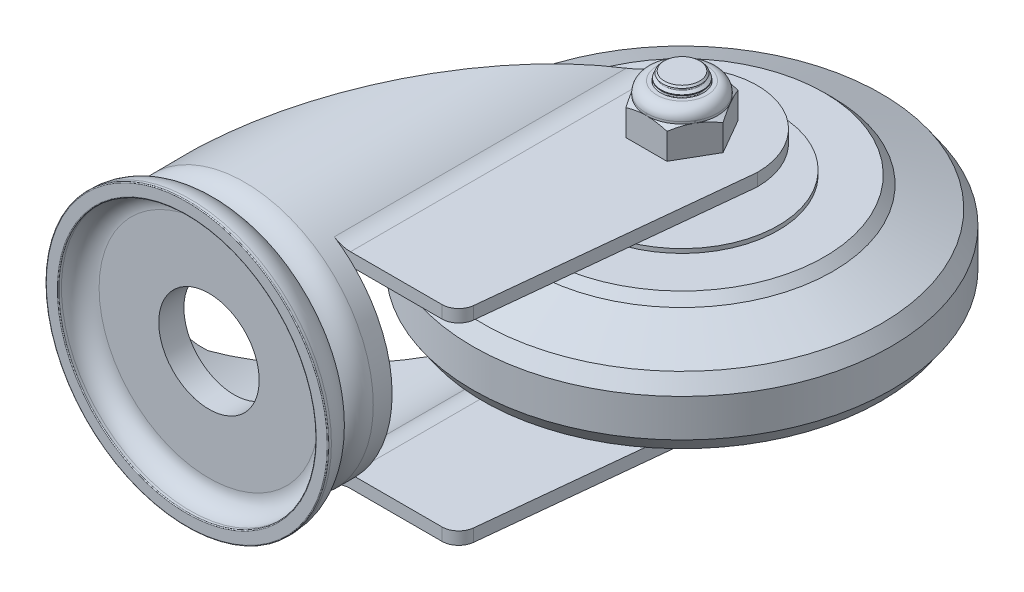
ISO-10303-21;
HEADER;
FILE_DESCRIPTION(('STEP AP214'),'2;1');
FILE_NAME('part.step','',(''),(''),'','','');
FILE_SCHEMA(('AUTOMOTIVE_DESIGN { 1 0 10303 214 1 1 1 1 }'));
ENDSEC;
DATA;
#1=APPLICATION_CONTEXT('core data for automotive mechanical design processes');
#2=APPLICATION_PROTOCOL_DEFINITION('international standard','automotive_design',2000,#1);
#3=PRODUCT_CONTEXT('',#1,'mechanical');
#4=PRODUCT('Part','Part','',(#3));
#5=PRODUCT_RELATED_PRODUCT_CATEGORY('part','',(#4));
#6=PRODUCT_DEFINITION_FORMATION('','',#4);
#7=PRODUCT_DEFINITION_CONTEXT('part definition',#1,'design');
#8=PRODUCT_DEFINITION('design','',#6,#7);
#9=PRODUCT_DEFINITION_SHAPE('','',#8);
#10=(LENGTH_UNIT() NAMED_UNIT(*) SI_UNIT(.MILLI.,.METRE.));
#11=(NAMED_UNIT(*) PLANE_ANGLE_UNIT() SI_UNIT($,.RADIAN.));
#12=(NAMED_UNIT(*) SI_UNIT($,.STERADIAN.) SOLID_ANGLE_UNIT());
#13=UNCERTAINTY_MEASURE_WITH_UNIT(LENGTH_MEASURE(1.E-05),#10,'distance_accuracy_value','');
#14=(GEOMETRIC_REPRESENTATION_CONTEXT(3) GLOBAL_UNCERTAINTY_ASSIGNED_CONTEXT((#13)) GLOBAL_UNIT_ASSIGNED_CONTEXT((#10,
#11,#12)) REPRESENTATION_CONTEXT('',''));
#15=CARTESIAN_POINT('',(0.,0.,0.));
#16=DIRECTION('',(0.,0.,1.));
#17=DIRECTION('',(1.,0.,0.));
#18=AXIS2_PLACEMENT_3D('',#15,#16,#17);
#19=CARTESIAN_POINT('',(35.,36.5000000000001,-96.0999999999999));
#20=DIRECTION('',(0.,1.,0.));
#21=DIRECTION('',(0.,0.,1.));
#22=AXIS2_PLACEMENT_3D('',#19,#20,#21);
#23=PLANE('',#22);
#24=CARTESIAN_POINT('',(35.,36.4999999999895,-93.9999999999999));
#25=DIRECTION('',(0.,-1.,0.));
#26=DIRECTION('',(0.,0.,-1.));
#27=AXIS2_PLACEMENT_3D('',#24,#25,#26);
#28=CIRCLE('',#27,4.19999999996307);
#29=CARTESIAN_POINT('',(35.,36.4999999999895,-98.199999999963));
#30=VERTEX_POINT('',#29);
#31=EDGE_CURVE('E22',#30,#30,#28,.T.);
#32=ORIENTED_EDGE('',*,*,#31,.F.);
#33=EDGE_LOOP('',(#32));
#34=FACE_BOUND('',#33,.T.);
#35=ADVANCED_FACE('F16',(#34),#23,.T.);
#36=CARTESIAN_POINT('',(35.,36.1153904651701,-93.9999999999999));
#37=DIRECTION('',(0.,-1.,0.));
#38=DIRECTION('',(0.,0.,-1.));
#39=AXIS2_PLACEMENT_3D('',#36,#37,#38);
#40=CONICAL_SURFACE('',#39,4.58460953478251,0.785398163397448);
#41=CARTESIAN_POINT('',(34.9999999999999,36.1153904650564,-94.));
#42=DIRECTION('',(0.,1.,0.));
#43=DIRECTION('',(0.,0.,1.));
#44=AXIS2_PLACEMENT_3D('',#41,#42,#43);
#45=CIRCLE('',#44,4.58460953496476);
#46=CARTESIAN_POINT('',(34.9999999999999,36.1153904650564,-89.4153904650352));
#47=VERTEX_POINT('',#46);
#48=EDGE_CURVE('E776',#47,#47,#45,.T.);
#49=ORIENTED_EDGE('',*,*,#48,.T.);
#50=EDGE_LOOP('',(#49));
#51=FACE_BOUND('',#50,.T.);
#52=ORIENTED_EDGE('',*,*,#31,.T.);
#53=EDGE_LOOP('',(#52));
#54=FACE_BOUND('',#53,.T.);
#55=ADVANCED_FACE('F1254',(#51,#54),#40,.T.);
#56=CARTESIAN_POINT('',(34.9999999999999,35.9374999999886,-94.));
#57=DIRECTION('',(0.,1.,0.));
#58=DIRECTION('',(0.,0.,1.));
#59=AXIS2_PLACEMENT_3D('',#56,#57,#58);
#60=CONICAL_SURFACE('',#59,4.33055562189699,0.95993108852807);
#61=ORIENTED_EDGE('',*,*,#48,.F.);
#62=EDGE_LOOP('',(#61));
#63=FACE_BOUND('',#62,.T.);
#64=CARTESIAN_POINT('',(34.9999999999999,35.9375,-94.));
#65=DIRECTION('',(0.,-1.,0.));
#66=DIRECTION('',(0.,0.,1.));
#67=AXIS2_PLACEMENT_3D('',#64,#65,#66);
#68=CIRCLE('',#67,4.33055562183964);
#69=CARTESIAN_POINT('',(34.9999999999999,35.9375,-89.6694443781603));
#70=VERTEX_POINT('',#69);
#71=EDGE_CURVE('E779',#70,#70,#68,.F.);
#72=ORIENTED_EDGE('',*,*,#71,.T.);
#73=EDGE_LOOP('',(#72));
#74=FACE_BOUND('',#73,.T.);
#75=ADVANCED_FACE('F1259',(#63,#74),#60,.T.);
#76=CARTESIAN_POINT('',(34.9999999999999,35.75,-94.));
#77=DIRECTION('',(0.,-1.,0.));
#78=DIRECTION('',(0.,0.,1.));
#79=AXIS2_PLACEMENT_3D('',#76,#77,#78);
#80=TOROIDAL_SURFACE('',#79,4.46184453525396,0.228895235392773);
#81=CARTESIAN_POINT('',(34.9999999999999,35.5625000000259,-94.));
#82=DIRECTION('',(0.,-1.,0.));
#83=DIRECTION('',(0.,0.,1.));
#84=AXIS2_PLACEMENT_3D('',#81,#82,#83);
#85=CIRCLE('',#84,4.33055562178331);
#86=CARTESIAN_POINT('',(34.9999999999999,35.5625000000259,-89.6694443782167));
#87=VERTEX_POINT('',#86);
#88=EDGE_CURVE('E1501',#87,#87,#85,.F.);
#89=ORIENTED_EDGE('',*,*,#88,.T.);
#90=EDGE_LOOP('',(#89));
#91=FACE_BOUND('',#90,.T.);
#92=ORIENTED_EDGE('',*,*,#71,.F.);
#93=EDGE_LOOP('',(#92));
#94=FACE_BOUND('',#93,.T.);
#95=ADVANCED_FACE('F1264',(#91,#94),#80,.F.);
#96=CARTESIAN_POINT('',(34.9999999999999,35.5625000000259,-94.));
#97=DIRECTION('',(0.,-1.,0.));
#98=DIRECTION('',(0.,0.,-1.));
#99=AXIS2_PLACEMENT_3D('',#96,#97,#98);
#100=CONICAL_SURFACE('',#99,4.33055562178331,0.959931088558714);
#101=ORIENTED_EDGE('',*,*,#88,.F.);
#102=EDGE_LOOP('',(#101));
#103=FACE_BOUND('',#102,.T.);
#104=CARTESIAN_POINT('',(35.,35.09375,-93.9999999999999));
#105=DIRECTION('',(0.,1.,0.));
#106=DIRECTION('',(-7.70217223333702E-13,0.,-1.));
#107=AXIS2_PLACEMENT_3D('',#104,#105,#106);
#108=CIRCLE('',#107,5.);
#109=CARTESIAN_POINT('',(34.9999999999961,35.09375,-98.9999999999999));
#110=VERTEX_POINT('',#109);
#111=EDGE_CURVE('E1503',#110,#110,#108,.F.);
#112=ORIENTED_EDGE('',*,*,#111,.F.);
#113=EDGE_LOOP('',(#112));
#114=FACE_BOUND('',#113,.T.);
#115=ADVANCED_FACE('F1269',(#103,#114),#100,.T.);
#116=CARTESIAN_POINT('',(35.,34.90625,-93.9999999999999));
#117=DIRECTION('',(0.,1.,0.));
#118=DIRECTION('',(0.,0.,1.));
#119=AXIS2_PLACEMENT_3D('',#116,#117,#118);
#120=CYLINDRICAL_SURFACE('',#119,5.);
#121=CARTESIAN_POINT('',(34.9999999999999,34.9062500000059,-94.));
#122=DIRECTION('',(0.,1.,0.));
#123=DIRECTION('',(0.,0.,1.));
#124=AXIS2_PLACEMENT_3D('',#121,#122,#123);
#125=CIRCLE('',#124,4.99999999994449);
#126=CARTESIAN_POINT('',(34.9999999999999,34.9062500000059,-89.0000000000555));
#127=VERTEX_POINT('',#126);
#128=EDGE_CURVE('E1492',#127,#127,#125,.T.);
#129=ORIENTED_EDGE('',*,*,#128,.T.);
#130=EDGE_LOOP('',(#129));
#131=FACE_BOUND('',#130,.T.);
#132=ORIENTED_EDGE('',*,*,#111,.T.);
#133=EDGE_LOOP('',(#132));
#134=FACE_BOUND('',#133,.T.);
#135=ADVANCED_FACE('F1274',(#131,#134),#120,.T.);
#136=CARTESIAN_POINT('',(34.9999999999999,34.4375000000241,-94.));
#137=DIRECTION('',(0.,1.,0.));
#138=DIRECTION('',(0.,0.,1.));
#139=AXIS2_PLACEMENT_3D('',#136,#137,#138);
#140=CONICAL_SURFACE('',#139,4.33055562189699,0.9599310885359);
#141=ORIENTED_EDGE('',*,*,#128,.F.);
#142=EDGE_LOOP('',(#141));
#143=FACE_BOUND('',#142,.T.);
#144=CARTESIAN_POINT('',(34.9999999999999,34.4375,-94.));
#145=DIRECTION('',(0.,-1.,0.));
#146=DIRECTION('',(0.,0.,1.));
#147=AXIS2_PLACEMENT_3D('',#144,#145,#146);
#148=CIRCLE('',#147,4.33055562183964);
#149=CARTESIAN_POINT('',(34.9999999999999,34.4375,-89.6694443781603));
#150=VERTEX_POINT('',#149);
#151=EDGE_CURVE('E1487',#150,#150,#148,.F.);
#152=ORIENTED_EDGE('',*,*,#151,.T.);
#153=EDGE_LOOP('',(#152));
#154=FACE_BOUND('',#153,.T.);
#155=ADVANCED_FACE('F1279',(#143,#154),#140,.T.);
#156=CARTESIAN_POINT('',(34.9999999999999,34.25,-94.));
#157=DIRECTION('',(0.,-1.,0.));
#158=DIRECTION('',(0.,0.,1.));
#159=AXIS2_PLACEMENT_3D('',#156,#157,#158);
#160=TOROIDAL_SURFACE('',#159,4.46184453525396,0.228895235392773);
#161=CARTESIAN_POINT('',(34.9999999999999,34.0625000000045,-94.));
#162=DIRECTION('',(0.,-1.,0.));
#163=DIRECTION('',(0.,0.,1.));
#164=AXIS2_PLACEMENT_3D('',#161,#162,#163);
#165=CIRCLE('',#164,4.33055562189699);
#166=CARTESIAN_POINT('',(34.9999999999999,34.0625000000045,-89.669444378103));
#167=VERTEX_POINT('',#166);
#168=EDGE_CURVE('E1483',#167,#167,#165,.F.);
#169=ORIENTED_EDGE('',*,*,#168,.T.);
#170=EDGE_LOOP('',(#169));
#171=FACE_BOUND('',#170,.T.);
#172=ORIENTED_EDGE('',*,*,#151,.F.);
#173=EDGE_LOOP('',(#172));
#174=FACE_BOUND('',#173,.T.);
#175=ADVANCED_FACE('F1284',(#171,#174),#160,.F.);
#176=CARTESIAN_POINT('',(34.9999999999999,34.0625000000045,-94.));
#177=DIRECTION('',(0.,-1.,0.));
#178=DIRECTION('',(0.,0.,-1.));
#179=AXIS2_PLACEMENT_3D('',#176,#177,#178);
#180=CONICAL_SURFACE('',#179,4.33055562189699,0.9599310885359);
#181=ORIENTED_EDGE('',*,*,#168,.F.);
#182=EDGE_LOOP('',(#181));
#183=FACE_BOUND('',#182,.T.);
#184=CARTESIAN_POINT('',(35.,33.59375,-93.9999999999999));
#185=DIRECTION('',(0.,1.,0.));
#186=DIRECTION('',(-7.70217223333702E-13,0.,-1.));
#187=AXIS2_PLACEMENT_3D('',#184,#185,#186);
#188=CIRCLE('',#187,5.);
#189=CARTESIAN_POINT('',(34.9999999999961,33.59375,-98.9999999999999));
#190=VERTEX_POINT('',#189);
#191=EDGE_CURVE('E1480',#190,#190,#188,.F.);
#192=ORIENTED_EDGE('',*,*,#191,.F.);
#193=EDGE_LOOP('',(#192));
#194=FACE_BOUND('',#193,.T.);
#195=ADVANCED_FACE('F1289',(#183,#194),#180,.T.);
#196=CARTESIAN_POINT('',(35.,33.40625,-93.9999999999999));
#197=DIRECTION('',(0.,1.,0.));
#198=DIRECTION('',(0.,0.,1.));
#199=AXIS2_PLACEMENT_3D('',#196,#197,#198);
#200=CYLINDRICAL_SURFACE('',#199,5.);
#201=CARTESIAN_POINT('',(34.9999999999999,33.4062499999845,-94.));
#202=DIRECTION('',(0.,1.,0.));
#203=DIRECTION('',(0.,0.,1.));
#204=AXIS2_PLACEMENT_3D('',#201,#202,#203);
#205=CIRCLE('',#204,4.99999999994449);
#206=CARTESIAN_POINT('',(34.9999999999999,33.4062499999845,-89.0000000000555));
#207=VERTEX_POINT('',#206);
#208=EDGE_CURVE('E1458',#207,#207,#205,.T.);
#209=ORIENTED_EDGE('',*,*,#208,.T.);
#210=EDGE_LOOP('',(#209));
#211=FACE_BOUND('',#210,.T.);
#212=ORIENTED_EDGE('',*,*,#191,.T.);
#213=EDGE_LOOP('',(#212));
#214=FACE_BOUND('',#213,.T.);
#215=ADVANCED_FACE('F1294',(#211,#214),#200,.T.);
#216=CARTESIAN_POINT('',(34.9999999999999,32.9375000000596,-94.));
#217=DIRECTION('',(0.,1.,0.));
#218=DIRECTION('',(0.,0.,1.));
#219=AXIS2_PLACEMENT_3D('',#216,#217,#218);
#220=CONICAL_SURFACE('',#219,4.33055562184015,0.959931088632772);
#221=ORIENTED_EDGE('',*,*,#208,.F.);
#222=EDGE_LOOP('',(#221));
#223=FACE_BOUND('',#222,.T.);
#224=CARTESIAN_POINT('',(34.9999999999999,32.9375,-94.));
#225=DIRECTION('',(0.,-1.,0.));
#226=DIRECTION('',(0.,0.,1.));
#227=AXIS2_PLACEMENT_3D('',#224,#225,#226);
#228=CIRCLE('',#227,4.33055562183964);
#229=CARTESIAN_POINT('',(34.9999999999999,32.9375,-89.6694443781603));
#230=VERTEX_POINT('',#229);
#231=EDGE_CURVE('E1460',#230,#230,#228,.F.);
#232=ORIENTED_EDGE('',*,*,#231,.T.);
#233=EDGE_LOOP('',(#232));
#234=FACE_BOUND('',#233,.T.);
#235=ADVANCED_FACE('F1299',(#223,#234),#220,.T.);
#236=CARTESIAN_POINT('',(34.9999999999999,32.75,-94.));
#237=DIRECTION('',(0.,-1.,0.));
#238=DIRECTION('',(0.,0.,1.));
#239=AXIS2_PLACEMENT_3D('',#236,#237,#238);
#240=TOROIDAL_SURFACE('',#239,4.46184453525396,0.228895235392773);
#241=CARTESIAN_POINT('',(34.9999999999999,32.5624999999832,-94.));
#242=DIRECTION('',(0.,-1.,0.));
#243=DIRECTION('',(0.,0.,1.));
#244=AXIS2_PLACEMENT_3D('',#241,#242,#243);
#245=CIRCLE('',#244,4.33055562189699);
#246=CARTESIAN_POINT('',(34.9999999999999,32.5624999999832,-89.669444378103));
#247=VERTEX_POINT('',#246);
#248=EDGE_CURVE('E1463',#247,#247,#245,.F.);
#249=ORIENTED_EDGE('',*,*,#248,.T.);
#250=EDGE_LOOP('',(#249));
#251=FACE_BOUND('',#250,.T.);
#252=ORIENTED_EDGE('',*,*,#231,.F.);
#253=EDGE_LOOP('',(#252));
#254=FACE_BOUND('',#253,.T.);
#255=ADVANCED_FACE('F1304',(#251,#254),#240,.F.);
#256=CARTESIAN_POINT('',(34.9999999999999,32.5624999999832,-94.));
#257=DIRECTION('',(0.,-1.,0.));
#258=DIRECTION('',(0.,0.,-1.));
#259=AXIS2_PLACEMENT_3D('',#256,#257,#258);
#260=CONICAL_SURFACE('',#259,4.33055562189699,0.9599310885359);
#261=ORIENTED_EDGE('',*,*,#248,.F.);
#262=EDGE_LOOP('',(#261));
#263=FACE_BOUND('',#262,.T.);
#264=CARTESIAN_POINT('',(35.,32.09375,-93.9999999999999));
#265=DIRECTION('',(0.,1.,0.));
#266=DIRECTION('',(-7.70217223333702E-13,0.,-1.));
#267=AXIS2_PLACEMENT_3D('',#264,#265,#266);
#268=CIRCLE('',#267,5.);
#269=CARTESIAN_POINT('',(34.9999999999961,32.09375,-98.9999999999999));
#270=VERTEX_POINT('',#269);
#271=EDGE_CURVE('E1465',#270,#270,#268,.F.);
#272=ORIENTED_EDGE('',*,*,#271,.F.);
#273=EDGE_LOOP('',(#272));
#274=FACE_BOUND('',#273,.T.);
#275=ADVANCED_FACE('F1309',(#263,#274),#260,.T.);
#276=CARTESIAN_POINT('',(35.,31.90625,-93.9999999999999));
#277=DIRECTION('',(0.,1.,0.));
#278=DIRECTION('',(0.,0.,1.));
#279=AXIS2_PLACEMENT_3D('',#276,#277,#278);
#280=CYLINDRICAL_SURFACE('',#279,5.);
#281=CARTESIAN_POINT('',(34.9999999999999,31.90625000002,-94.));
#282=DIRECTION('',(0.,1.,0.));
#283=DIRECTION('',(0.,0.,1.));
#284=AXIS2_PLACEMENT_3D('',#281,#282,#283);
#285=CIRCLE('',#284,5.00000000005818);
#286=CARTESIAN_POINT('',(34.9999999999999,31.90625000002,-88.9999999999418));
#287=VERTEX_POINT('',#286);
#288=EDGE_CURVE('E1450',#287,#287,#285,.T.);
#289=ORIENTED_EDGE('',*,*,#288,.T.);
#290=EDGE_LOOP('',(#289));
#291=FACE_BOUND('',#290,.T.);
#292=ORIENTED_EDGE('',*,*,#271,.T.);
#293=EDGE_LOOP('',(#292));
#294=FACE_BOUND('',#293,.T.);
#295=ADVANCED_FACE('F1314',(#291,#294),#280,.T.);
#296=CARTESIAN_POINT('',(34.9999999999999,31.4375000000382,-94.));
#297=DIRECTION('',(0.,1.,0.));
#298=DIRECTION('',(0.,0.,1.));
#299=AXIS2_PLACEMENT_3D('',#296,#297,#298);
#300=CONICAL_SURFACE('',#299,4.33055562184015,0.959931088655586);
#301=ORIENTED_EDGE('',*,*,#288,.F.);
#302=EDGE_LOOP('',(#301));
#303=FACE_BOUND('',#302,.T.);
#304=CARTESIAN_POINT('',(34.9999999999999,31.4375,-94.));
#305=DIRECTION('',(0.,-1.,0.));
#306=DIRECTION('',(0.,0.,1.));
#307=AXIS2_PLACEMENT_3D('',#304,#305,#306);
#308=CIRCLE('',#307,4.33055562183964);
#309=CARTESIAN_POINT('',(34.9999999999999,31.4375,-89.6694443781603));
#310=VERTEX_POINT('',#309);
#311=EDGE_CURVE('E1445',#310,#310,#308,.F.);
#312=ORIENTED_EDGE('',*,*,#311,.T.);
#313=EDGE_LOOP('',(#312));
#314=FACE_BOUND('',#313,.T.);
#315=ADVANCED_FACE('F1319',(#303,#314),#300,.T.);
#316=CARTESIAN_POINT('',(34.9999999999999,31.25,-94.));
#317=DIRECTION('',(0.,-1.,0.));
#318=DIRECTION('',(0.,0.,1.));
#319=AXIS2_PLACEMENT_3D('',#316,#317,#318);
#320=TOROIDAL_SURFACE('',#319,4.46184453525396,0.228895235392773);
#321=CARTESIAN_POINT('',(34.9999999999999,31.0624999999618,-94.));
#322=DIRECTION('',(0.,-1.,0.));
#323=DIRECTION('',(0.,0.,1.));
#324=AXIS2_PLACEMENT_3D('',#321,#322,#323);
#325=CIRCLE('',#324,4.33055562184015);
#326=CARTESIAN_POINT('',(34.9999999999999,31.0624999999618,-89.6694443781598));
#327=VERTEX_POINT('',#326);
#328=EDGE_CURVE('E1441',#327,#327,#325,.F.);
#329=ORIENTED_EDGE('',*,*,#328,.T.);
#330=EDGE_LOOP('',(#329));
#331=FACE_BOUND('',#330,.T.);
#332=ORIENTED_EDGE('',*,*,#311,.F.);
#333=EDGE_LOOP('',(#332));
#334=FACE_BOUND('',#333,.T.);
#335=ADVANCED_FACE('F1324',(#331,#334),#320,.F.);
#336=CARTESIAN_POINT('',(34.9999999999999,31.0624999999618,-94.));
#337=DIRECTION('',(0.,-1.,0.));
#338=DIRECTION('',(0.,0.,-1.));
#339=AXIS2_PLACEMENT_3D('',#336,#337,#338);
#340=CONICAL_SURFACE('',#339,4.33055562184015,0.959931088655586);
#341=ORIENTED_EDGE('',*,*,#328,.F.);
#342=EDGE_LOOP('',(#341));
#343=FACE_BOUND('',#342,.T.);
#344=CARTESIAN_POINT('',(35.,30.59375,-93.9999999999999));
#345=DIRECTION('',(0.,1.,0.));
#346=DIRECTION('',(-7.70217223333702E-13,0.,-1.));
#347=AXIS2_PLACEMENT_3D('',#344,#345,#346);
#348=CIRCLE('',#347,5.);
#349=CARTESIAN_POINT('',(34.9999999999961,30.59375,-98.9999999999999));
#350=VERTEX_POINT('',#349);
#351=EDGE_CURVE('E1438',#350,#350,#348,.F.);
#352=ORIENTED_EDGE('',*,*,#351,.F.);
#353=EDGE_LOOP('',(#352));
#354=FACE_BOUND('',#353,.T.);
#355=ADVANCED_FACE('F1329',(#343,#354),#340,.T.);
#356=CARTESIAN_POINT('',(35.,30.40625,-93.9999999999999));
#357=DIRECTION('',(0.,1.,0.));
#358=DIRECTION('',(0.,0.,1.));
#359=AXIS2_PLACEMENT_3D('',#356,#357,#358);
#360=CYLINDRICAL_SURFACE('',#359,5.);
#361=CARTESIAN_POINT('',(34.9999999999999,30.4062499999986,-94.));
#362=DIRECTION('',(0.,1.,0.));
#363=DIRECTION('',(0.,0.,1.));
#364=AXIS2_PLACEMENT_3D('',#361,#362,#363);
#365=CIRCLE('',#364,4.99999999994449);
#366=CARTESIAN_POINT('',(34.9999999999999,30.4062499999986,-89.0000000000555));
#367=VERTEX_POINT('',#366);
#368=EDGE_CURVE('E1416',#367,#367,#365,.T.);
#369=ORIENTED_EDGE('',*,*,#368,.T.);
#370=EDGE_LOOP('',(#369));
#371=FACE_BOUND('',#370,.T.);
#372=ORIENTED_EDGE('',*,*,#351,.T.);
#373=EDGE_LOOP('',(#372));
#374=FACE_BOUND('',#373,.T.);
#375=ADVANCED_FACE('F1334',(#371,#374),#360,.T.);
#376=CARTESIAN_POINT('',(34.9999999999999,29.9375000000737,-94.));
#377=DIRECTION('',(0.,1.,0.));
#378=DIRECTION('',(0.,0.,1.));
#379=AXIS2_PLACEMENT_3D('',#376,#377,#378);
#380=CONICAL_SURFACE('',#379,4.33055562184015,0.959931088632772);
#381=ORIENTED_EDGE('',*,*,#368,.F.);
#382=EDGE_LOOP('',(#381));
#383=FACE_BOUND('',#382,.T.);
#384=CARTESIAN_POINT('',(34.9999999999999,29.9375,-94.));
#385=DIRECTION('',(0.,-1.,0.));
#386=DIRECTION('',(0.,0.,1.));
#387=AXIS2_PLACEMENT_3D('',#384,#385,#386);
#388=CIRCLE('',#387,4.33055562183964);
#389=CARTESIAN_POINT('',(34.9999999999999,29.9375,-89.6694443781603));
#390=VERTEX_POINT('',#389);
#391=EDGE_CURVE('E1418',#390,#390,#388,.F.);
#392=ORIENTED_EDGE('',*,*,#391,.T.);
#393=EDGE_LOOP('',(#392));
#394=FACE_BOUND('',#393,.T.);
#395=ADVANCED_FACE('F1339',(#383,#394),#380,.T.);
#396=CARTESIAN_POINT('',(34.9999999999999,29.75,-94.));
#397=DIRECTION('',(0.,-1.,0.));
#398=DIRECTION('',(0.,0.,1.));
#399=AXIS2_PLACEMENT_3D('',#396,#397,#398);
#400=TOROIDAL_SURFACE('',#399,4.46184453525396,0.228895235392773);
#401=CARTESIAN_POINT('',(34.9999999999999,29.5624999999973,-94.));
#402=DIRECTION('',(0.,-1.,0.));
#403=DIRECTION('',(0.,0.,1.));
#404=AXIS2_PLACEMENT_3D('',#401,#402,#403);
#405=CIRCLE('',#404,4.33055562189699);
#406=CARTESIAN_POINT('',(34.9999999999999,29.5624999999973,-89.669444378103));
#407=VERTEX_POINT('',#406);
#408=EDGE_CURVE('E1421',#407,#407,#405,.F.);
#409=ORIENTED_EDGE('',*,*,#408,.T.);
#410=EDGE_LOOP('',(#409));
#411=FACE_BOUND('',#410,.T.);
#412=ORIENTED_EDGE('',*,*,#391,.F.);
#413=EDGE_LOOP('',(#412));
#414=FACE_BOUND('',#413,.T.);
#415=ADVANCED_FACE('F1344',(#411,#414),#400,.F.);
#416=CARTESIAN_POINT('',(34.9999999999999,29.5624999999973,-94.));
#417=DIRECTION('',(0.,-1.,0.));
#418=DIRECTION('',(0.,0.,-1.));
#419=AXIS2_PLACEMENT_3D('',#416,#417,#418);
#420=CONICAL_SURFACE('',#419,4.33055562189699,0.9599310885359);
#421=ORIENTED_EDGE('',*,*,#408,.F.);
#422=EDGE_LOOP('',(#421));
#423=FACE_BOUND('',#422,.T.);
#424=CARTESIAN_POINT('',(35.,29.09375,-93.9999999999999));
#425=DIRECTION('',(0.,1.,0.));
#426=DIRECTION('',(-7.70217223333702E-13,0.,-1.));
#427=AXIS2_PLACEMENT_3D('',#424,#425,#426);
#428=CIRCLE('',#427,5.);
#429=CARTESIAN_POINT('',(34.9999999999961,29.09375,-98.9999999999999));
#430=VERTEX_POINT('',#429);
#431=EDGE_CURVE('E1423',#430,#430,#428,.F.);
#432=ORIENTED_EDGE('',*,*,#431,.F.);
#433=EDGE_LOOP('',(#432));
#434=FACE_BOUND('',#433,.T.);
#435=ADVANCED_FACE('F1349',(#423,#434),#420,.T.);
#436=CARTESIAN_POINT('',(35.,28.90625,-93.9999999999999));
#437=DIRECTION('',(0.,1.,0.));
#438=DIRECTION('',(0.,0.,1.));
#439=AXIS2_PLACEMENT_3D('',#436,#437,#438);
#440=CYLINDRICAL_SURFACE('',#439,5.);
#441=CARTESIAN_POINT('',(34.9999999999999,28.9062499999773,-94.));
#442=DIRECTION('',(0.,1.,0.));
#443=DIRECTION('',(0.,0.,1.));
#444=AXIS2_PLACEMENT_3D('',#441,#442,#443);
#445=CIRCLE('',#444,4.99999999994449);
#446=CARTESIAN_POINT('',(34.9999999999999,28.9062499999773,-89.0000000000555));
#447=VERTEX_POINT('',#446);
#448=EDGE_CURVE('E1408',#447,#447,#445,.T.);
#449=ORIENTED_EDGE('',*,*,#448,.T.);
#450=EDGE_LOOP('',(#449));
#451=FACE_BOUND('',#450,.T.);
#452=ORIENTED_EDGE('',*,*,#431,.T.);
#453=EDGE_LOOP('',(#452));
#454=FACE_BOUND('',#453,.T.);
#455=ADVANCED_FACE('F1354',(#451,#454),#440,.T.);
#456=CARTESIAN_POINT('',(34.9999999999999,28.4375000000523,-94.));
#457=DIRECTION('',(0.,1.,0.));
#458=DIRECTION('',(-1.,0.,0.));
#459=AXIS2_PLACEMENT_3D('',#456,#457,#458);
#460=CONICAL_SURFACE('',#459,4.33055562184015,0.959931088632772);
#461=ORIENTED_EDGE('',*,*,#448,.F.);
#462=EDGE_LOOP('',(#461));
#463=FACE_BOUND('',#462,.T.);
#464=CARTESIAN_POINT('',(34.9999999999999,28.4375,-94.));
#465=DIRECTION('',(0.,-1.,0.));
#466=DIRECTION('',(0.,0.,1.));
#467=AXIS2_PLACEMENT_3D('',#464,#465,#466);
#468=CIRCLE('',#467,4.33055562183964);
#469=CARTESIAN_POINT('',(34.9999999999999,28.4375,-89.6694443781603));
#470=VERTEX_POINT('',#469);
#471=EDGE_CURVE('E1403',#470,#470,#468,.F.);
#472=ORIENTED_EDGE('',*,*,#471,.T.);
#473=EDGE_LOOP('',(#472));
#474=FACE_BOUND('',#473,.T.);
#475=ADVANCED_FACE('F1359',(#463,#474),#460,.T.);
#476=CARTESIAN_POINT('',(34.9999999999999,28.25,-94.));
#477=DIRECTION('',(0.,-1.,0.));
#478=DIRECTION('',(0.,0.,1.));
#479=AXIS2_PLACEMENT_3D('',#476,#477,#478);
#480=TOROIDAL_SURFACE('',#479,4.46184453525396,0.228895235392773);
#481=CARTESIAN_POINT('',(34.9999999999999,28.0624999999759,-94.));
#482=DIRECTION('',(0.,-1.,0.));
#483=DIRECTION('',(0.,0.,1.));
#484=AXIS2_PLACEMENT_3D('',#481,#482,#483);
#485=CIRCLE('',#484,4.33055562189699);
#486=CARTESIAN_POINT('',(34.9999999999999,28.0624999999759,-89.669444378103));
#487=VERTEX_POINT('',#486);
#488=EDGE_CURVE('E1399',#487,#487,#485,.F.);
#489=ORIENTED_EDGE('',*,*,#488,.T.);
#490=EDGE_LOOP('',(#489));
#491=FACE_BOUND('',#490,.T.);
#492=ORIENTED_EDGE('',*,*,#471,.F.);
#493=EDGE_LOOP('',(#492));
#494=FACE_BOUND('',#493,.T.);
#495=ADVANCED_FACE('F1364',(#491,#494),#480,.F.);
#496=CARTESIAN_POINT('',(34.9999999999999,28.0624999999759,-94.));
#497=DIRECTION('',(0.,-1.,0.));
#498=DIRECTION('',(1.,0.,0.));
#499=AXIS2_PLACEMENT_3D('',#496,#497,#498);
#500=CONICAL_SURFACE('',#499,4.33055562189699,0.9599310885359);
#501=ORIENTED_EDGE('',*,*,#488,.F.);
#502=EDGE_LOOP('',(#501));
#503=FACE_BOUND('',#502,.T.);
#504=CARTESIAN_POINT('',(35.,27.59375,-93.9999999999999));
#505=DIRECTION('',(0.,1.,0.));
#506=DIRECTION('',(-7.70217223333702E-13,0.,-1.));
#507=AXIS2_PLACEMENT_3D('',#504,#505,#506);
#508=CIRCLE('',#507,5.);
#509=CARTESIAN_POINT('',(34.9999999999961,27.59375,-98.9999999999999));
#510=VERTEX_POINT('',#509);
#511=EDGE_CURVE('E1397',#510,#510,#508,.F.);
#512=ORIENTED_EDGE('',*,*,#511,.F.);
#513=EDGE_LOOP('',(#512));
#514=FACE_BOUND('',#513,.T.);
#515=ADVANCED_FACE('F1369',(#503,#514),#500,.T.);
#516=CARTESIAN_POINT('',(35.,27.40625,-93.9999999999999));
#517=DIRECTION('',(0.,1.,0.));
#518=DIRECTION('',(0.,0.,1.));
#519=AXIS2_PLACEMENT_3D('',#516,#517,#518);
#520=CYLINDRICAL_SURFACE('',#519,5.);
#521=CARTESIAN_POINT('',(34.9999999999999,27.4062500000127,-94.));
#522=DIRECTION('',(0.,1.,0.));
#523=DIRECTION('',(0.,0.,1.));
#524=AXIS2_PLACEMENT_3D('',#521,#522,#523);
#525=CIRCLE('',#524,4.99999999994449);
#526=CARTESIAN_POINT('',(34.9999999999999,27.4062500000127,-89.0000000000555));
#527=VERTEX_POINT('',#526);
#528=EDGE_CURVE('E1162',#527,#527,#525,.T.);
#529=ORIENTED_EDGE('',*,*,#528,.T.);
#530=EDGE_LOOP('',(#529));
#531=FACE_BOUND('',#530,.T.);
#532=ORIENTED_EDGE('',*,*,#511,.T.);
#533=EDGE_LOOP('',(#532));
#534=FACE_BOUND('',#533,.T.);
#535=ADVANCED_FACE('F1374',(#531,#534),#520,.T.);
#536=CARTESIAN_POINT('',(34.9999999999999,26.9375000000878,-94.));
#537=DIRECTION('',(0.,1.,0.));
#538=DIRECTION('',(-1.,0.,0.));
#539=AXIS2_PLACEMENT_3D('',#536,#537,#538);
#540=CONICAL_SURFACE('',#539,4.33055562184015,0.959931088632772);
#541=ORIENTED_EDGE('',*,*,#528,.F.);
#542=EDGE_LOOP('',(#541));
#543=FACE_BOUND('',#542,.T.);
#544=CARTESIAN_POINT('',(34.9999999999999,26.9375,-94.));
#545=DIRECTION('',(0.,-1.,0.));
#546=DIRECTION('',(0.,0.,1.));
#547=AXIS2_PLACEMENT_3D('',#544,#545,#546);
#548=CIRCLE('',#547,4.33055562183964);
#549=CARTESIAN_POINT('',(34.9999999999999,26.9375,-89.6694443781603));
#550=VERTEX_POINT('',#549);
#551=EDGE_CURVE('E1157',#550,#550,#548,.F.);
#552=ORIENTED_EDGE('',*,*,#551,.T.);
#553=EDGE_LOOP('',(#552));
#554=FACE_BOUND('',#553,.T.);
#555=ADVANCED_FACE('F1172',(#543,#554),#540,.T.);
#556=CARTESIAN_POINT('',(34.9999999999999,26.75,-94.));
#557=DIRECTION('',(0.,-1.,0.));
#558=DIRECTION('',(0.,0.,1.));
#559=AXIS2_PLACEMENT_3D('',#556,#557,#558);
#560=TOROIDAL_SURFACE('',#559,4.46184453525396,0.228895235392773);
#561=CARTESIAN_POINT('',(34.9999999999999,26.5625000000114,-94.));
#562=DIRECTION('',(0.,-1.,0.));
#563=DIRECTION('',(0.,0.,1.));
#564=AXIS2_PLACEMENT_3D('',#561,#562,#563);
#565=CIRCLE('',#564,4.33055562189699);
#566=CARTESIAN_POINT('',(34.9999999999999,26.5625000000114,-89.669444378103));
#567=VERTEX_POINT('',#566);
#568=EDGE_CURVE('E1153',#567,#567,#565,.F.);
#569=ORIENTED_EDGE('',*,*,#568,.T.);
#570=EDGE_LOOP('',(#569));
#571=FACE_BOUND('',#570,.T.);
#572=ORIENTED_EDGE('',*,*,#551,.F.);
#573=EDGE_LOOP('',(#572));
#574=FACE_BOUND('',#573,.T.);
#575=ADVANCED_FACE('F1167',(#571,#574),#560,.F.);
#576=CARTESIAN_POINT('',(34.9999999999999,26.5625000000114,-94.));
#577=DIRECTION('',(0.,-1.,0.));
#578=DIRECTION('',(1.,0.,0.));
#579=AXIS2_PLACEMENT_3D('',#576,#577,#578);
#580=CONICAL_SURFACE('',#579,4.33055562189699,0.9599310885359);
#581=ORIENTED_EDGE('',*,*,#568,.F.);
#582=EDGE_LOOP('',(#581));
#583=FACE_BOUND('',#582,.T.);
#584=CARTESIAN_POINT('',(35.,26.09375,-93.9999999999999));
#585=DIRECTION('',(0.,1.,0.));
#586=DIRECTION('',(-7.70217223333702E-13,0.,-1.));
#587=AXIS2_PLACEMENT_3D('',#584,#585,#586);
#588=CIRCLE('',#587,5.);
#589=CARTESIAN_POINT('',(34.9999999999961,26.09375,-98.9999999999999));
#590=VERTEX_POINT('',#589);
#591=EDGE_CURVE('E1149',#590,#590,#588,.F.);
#592=ORIENTED_EDGE('',*,*,#591,.F.);
#593=EDGE_LOOP('',(#592));
#594=FACE_BOUND('',#593,.T.);
#595=ADVANCED_FACE('F1171',(#583,#594),#580,.T.);
#596=CARTESIAN_POINT('',(35.,25.90625,-93.9999999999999));
#597=DIRECTION('',(0.,1.,0.));
#598=DIRECTION('',(0.,0.,1.));
#599=AXIS2_PLACEMENT_3D('',#596,#597,#598);
#600=CYLINDRICAL_SURFACE('',#599,5.);
#601=CARTESIAN_POINT('',(34.9999999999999,25.9062499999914,-94.));
#602=DIRECTION('',(0.,1.,0.));
#603=DIRECTION('',(0.,0.,1.));
#604=AXIS2_PLACEMENT_3D('',#601,#602,#603);
#605=CIRCLE('',#604,4.99999999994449);
#606=CARTESIAN_POINT('',(34.9999999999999,25.9062499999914,-89.0000000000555));
#607=VERTEX_POINT('',#606);
#608=EDGE_CURVE('E1140',#607,#607,#605,.T.);
#609=ORIENTED_EDGE('',*,*,#608,.T.);
#610=EDGE_LOOP('',(#609));
#611=FACE_BOUND('',#610,.T.);
#612=ORIENTED_EDGE('',*,*,#591,.T.);
#613=EDGE_LOOP('',(#612));
#614=FACE_BOUND('',#613,.T.);
#615=ADVANCED_FACE('F1176',(#611,#614),#600,.T.);
#616=CARTESIAN_POINT('',(34.9999999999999,25.4375000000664,-94.));
#617=DIRECTION('',(0.,1.,0.));
#618=DIRECTION('',(0.,0.,1.));
#619=AXIS2_PLACEMENT_3D('',#616,#617,#618);
#620=CONICAL_SURFACE('',#619,4.33055562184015,0.959931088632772);
#621=ORIENTED_EDGE('',*,*,#608,.F.);
#622=EDGE_LOOP('',(#621));
#623=FACE_BOUND('',#622,.T.);
#624=CARTESIAN_POINT('',(34.9999999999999,25.4375,-94.));
#625=DIRECTION('',(0.,-1.,0.));
#626=DIRECTION('',(0.,0.,1.));
#627=AXIS2_PLACEMENT_3D('',#624,#625,#626);
#628=CIRCLE('',#627,4.33055562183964);
#629=CARTESIAN_POINT('',(34.9999999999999,25.4375,-89.6694443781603));
#630=VERTEX_POINT('',#629);
#631=EDGE_CURVE('E775',#630,#630,#628,.F.);
#632=ORIENTED_EDGE('',*,*,#631,.T.);
#633=EDGE_LOOP('',(#632));
#634=FACE_BOUND('',#633,.T.);
#635=ADVANCED_FACE('F1134',(#623,#634),#620,.T.);
#636=CARTESIAN_POINT('',(34.9999999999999,25.25,-94.));
#637=DIRECTION('',(0.,-1.,0.));
#638=DIRECTION('',(0.,0.,1.));
#639=AXIS2_PLACEMENT_3D('',#636,#637,#638);
#640=TOROIDAL_SURFACE('',#639,4.46184453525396,0.228895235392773);
#641=CARTESIAN_POINT('',(34.9999999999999,25.06249999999,-94.));
#642=DIRECTION('',(0.,-1.,0.));
#643=DIRECTION('',(0.,0.,1.));
#644=AXIS2_PLACEMENT_3D('',#641,#642,#643);
#645=CIRCLE('',#644,4.33055562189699);
#646=CARTESIAN_POINT('',(34.9999999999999,25.06249999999,-89.669444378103));
#647=VERTEX_POINT('',#646);
#648=EDGE_CURVE('E772',#647,#647,#645,.F.);
#649=ORIENTED_EDGE('',*,*,#648,.T.);
#650=EDGE_LOOP('',(#649));
#651=FACE_BOUND('',#650,.T.);
#652=ORIENTED_EDGE('',*,*,#631,.F.);
#653=EDGE_LOOP('',(#652));
#654=FACE_BOUND('',#653,.T.);
#655=ADVANCED_FACE('F1129',(#651,#654),#640,.F.);
#656=CARTESIAN_POINT('',(34.9999999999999,25.06249999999,-94.));
#657=DIRECTION('',(0.,-1.,0.));
#658=DIRECTION('',(0.,0.,-1.));
#659=AXIS2_PLACEMENT_3D('',#656,#657,#658);
#660=CONICAL_SURFACE('',#659,4.33055562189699,0.9599310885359);
#661=ORIENTED_EDGE('',*,*,#648,.F.);
#662=EDGE_LOOP('',(#661));
#663=FACE_BOUND('',#662,.T.);
#664=CARTESIAN_POINT('',(35.,24.59375,-93.9999999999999));
#665=DIRECTION('',(0.,1.,0.));
#666=DIRECTION('',(-7.70217223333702E-13,0.,-1.));
#667=AXIS2_PLACEMENT_3D('',#664,#665,#666);
#668=CIRCLE('',#667,5.);
#669=CARTESIAN_POINT('',(34.9999999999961,24.59375,-98.9999999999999));
#670=VERTEX_POINT('',#669);
#671=EDGE_CURVE('E766',#670,#670,#668,.F.);
#672=ORIENTED_EDGE('',*,*,#671,.F.);
#673=EDGE_LOOP('',(#672));
#674=FACE_BOUND('',#673,.T.);
#675=ADVANCED_FACE('F1125',(#663,#674),#660,.T.);
#676=CARTESIAN_POINT('',(34.9999999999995,4.49999999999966,-94.0000000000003));
#677=DIRECTION('',(0.,-1.,0.));
#678=DIRECTION('',(0.,0.,-1.));
#679=AXIS2_PLACEMENT_3D('',#676,#677,#678);
#680=CYLINDRICAL_SURFACE('',#679,50.);
#681=CARTESIAN_POINT('',(34.9999999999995,-4.50000000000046,-94.0000000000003));
#682=DIRECTION('',(0.,1.,0.));
#683=DIRECTION('',(1.,0.,0.));
#684=AXIS2_PLACEMENT_3D('',#681,#682,#683);
#685=CIRCLE('',#684,50.);
#686=CARTESIAN_POINT('',(84.9999999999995,-4.50000000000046,-93.9999999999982));
#687=VERTEX_POINT('',#686);
#688=EDGE_CURVE('E761',#687,#687,#685,.F.);
#689=ORIENTED_EDGE('',*,*,#688,.F.);
#690=EDGE_LOOP('',(#689));
#691=FACE_BOUND('',#690,.T.);
#692=CARTESIAN_POINT('',(34.9999999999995,4.49999999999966,-94.0000000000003));
#693=DIRECTION('',(0.,-1.,0.));
#694=DIRECTION('',(1.,0.,0.));
#695=AXIS2_PLACEMENT_3D('',#692,#693,#694);
#696=CIRCLE('',#695,50.);
#697=CARTESIAN_POINT('',(84.9999999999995,4.49999999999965,-93.9999999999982));
#698=VERTEX_POINT('',#697);
#699=EDGE_CURVE('E755',#698,#698,#696,.F.);
#700=ORIENTED_EDGE('',*,*,#699,.F.);
#701=EDGE_LOOP('',(#700));
#702=FACE_BOUND('',#701,.T.);
#703=ADVANCED_FACE('F1121',(#691,#702),#680,.T.);
#704=CARTESIAN_POINT('',(35.,24.5,-93.9999999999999));
#705=DIRECTION('',(0.,1.,0.));
#706=DIRECTION('',(0.,0.,1.));
#707=AXIS2_PLACEMENT_3D('',#704,#705,#706);
#708=CYLINDRICAL_SURFACE('',#707,5.);
#709=CARTESIAN_POINT('',(35.,24.5,-93.9999999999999));
#710=DIRECTION('',(0.,1.,0.));
#711=DIRECTION('',(0.,0.,1.));
#712=AXIS2_PLACEMENT_3D('',#709,#710,#711);
#713=CIRCLE('',#712,5.);
#714=CARTESIAN_POINT('',(35.,24.5,-88.9999999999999));
#715=VERTEX_POINT('',#714);
#716=EDGE_CURVE('E752',#715,#715,#713,.F.);
#717=ORIENTED_EDGE('',*,*,#716,.F.);
#718=EDGE_LOOP('',(#717));
#719=FACE_BOUND('',#718,.T.);
#720=ORIENTED_EDGE('',*,*,#671,.T.);
#721=EDGE_LOOP('',(#720));
#722=FACE_BOUND('',#721,.T.);
#723=ADVANCED_FACE('F1117',(#719,#722),#708,.T.);
#724=CARTESIAN_POINT('',(34.9999999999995,-4.50000000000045,-94.0000000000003));
#725=DIRECTION('',(0.,1.,0.));
#726=DIRECTION('',(0.,0.,1.));
#727=AXIS2_PLACEMENT_3D('',#724,#725,#726);
#728=CONICAL_SURFACE('',#727,50.,0.601073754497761);
#729=CARTESIAN_POINT('',(34.9999999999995,-8.00000000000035,-94.0000000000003));
#730=DIRECTION('',(0.,1.,0.));
#731=DIRECTION('',(1.,0.,0.));
#732=AXIS2_PLACEMENT_3D('',#729,#730,#731);
#733=CIRCLE('',#732,47.6);
#734=CARTESIAN_POINT('',(82.5999999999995,-8.00000000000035,-93.9999999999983));
#735=VERTEX_POINT('',#734);
#736=EDGE_CURVE('E754',#735,#735,#733,.F.);
#737=ORIENTED_EDGE('',*,*,#736,.F.);
#738=EDGE_LOOP('',(#737));
#739=FACE_BOUND('',#738,.T.);
#740=ORIENTED_EDGE('',*,*,#688,.T.);
#741=EDGE_LOOP('',(#740));
#742=FACE_BOUND('',#741,.T.);
#743=ADVANCED_FACE('F1114',(#739,#742),#728,.T.);
#744=CARTESIAN_POINT('',(34.9999999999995,4.49999999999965,-94.0000000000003));
#745=DIRECTION('',(0.,-1.,0.));
#746=DIRECTION('',(0.,0.,-1.));
#747=AXIS2_PLACEMENT_3D('',#744,#745,#746);
#748=CONICAL_SURFACE('',#747,50.,0.601073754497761);
#749=ORIENTED_EDGE('',*,*,#699,.T.);
#750=EDGE_LOOP('',(#749));
#751=FACE_BOUND('',#750,.T.);
#752=CARTESIAN_POINT('',(34.9999999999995,7.99999999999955,-94.0000000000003));
#753=DIRECTION('',(0.,-1.,0.));
#754=DIRECTION('',(1.,0.,0.));
#755=AXIS2_PLACEMENT_3D('',#752,#753,#754);
#756=CIRCLE('',#755,47.6);
#757=CARTESIAN_POINT('',(82.5999999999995,7.99999999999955,-93.9999999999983));
#758=VERTEX_POINT('',#757);
#759=EDGE_CURVE('E751',#758,#758,#756,.F.);
#760=ORIENTED_EDGE('',*,*,#759,.F.);
#761=EDGE_LOOP('',(#760));
#762=FACE_BOUND('',#761,.T.);
#763=ADVANCED_FACE('F1110',(#751,#762),#748,.T.);
#764=CARTESIAN_POINT('',(56.,24.5,-29.));
#765=DIRECTION('',(0.,1.,0.));
#766=DIRECTION('',(0.,0.,1.));
#767=AXIS2_PLACEMENT_3D('',#764,#765,#766);
#768=PLANE('',#767);
#769=CARTESIAN_POINT('',(35.,24.5000000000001,-93.9999999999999));
#770=DIRECTION('',(0.,1.,0.));
#771=DIRECTION('',(0.,0.,1.));
#772=AXIS2_PLACEMENT_3D('',#769,#770,#771);
#773=CIRCLE('',#772,5.09999999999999);
#774=CARTESIAN_POINT('',(35.,24.5000000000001,-88.8999999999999));
#775=VERTEX_POINT('',#774);
#776=EDGE_CURVE('E748',#775,#775,#773,.F.);
#777=ORIENTED_EDGE('',*,*,#776,.F.);
#778=EDGE_LOOP('',(#777));
#779=FACE_BOUND('',#778,.T.);
#780=ORIENTED_EDGE('',*,*,#716,.T.);
#781=EDGE_LOOP('',(#780));
#782=FACE_BOUND('',#781,.T.);
#783=ADVANCED_FACE('F1106',(#779,#782),#768,.T.);
#784=CARTESIAN_POINT('',(34.9999999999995,-8.00000000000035,-94.0000000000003));
#785=DIRECTION('',(0.,1.,0.));
#786=DIRECTION('',(0.,0.,1.));
#787=AXIS2_PLACEMENT_3D('',#784,#785,#786);
#788=CONICAL_SURFACE('',#787,47.6,1.16382554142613);
#789=CARTESIAN_POINT('',(34.9999999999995,-13.0000000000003,-94.0000000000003));
#790=DIRECTION('',(0.,1.,0.));
#791=DIRECTION('',(1.,0.,0.));
#792=AXIS2_PLACEMENT_3D('',#789,#790,#791);
#793=CIRCLE('',#792,36.);
#794=CARTESIAN_POINT('',(70.9999999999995,-13.0000000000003,-93.9999999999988));
#795=VERTEX_POINT('',#794);
#796=EDGE_CURVE('E750',#795,#795,#793,.F.);
#797=ORIENTED_EDGE('',*,*,#796,.F.);
#798=EDGE_LOOP('',(#797));
#799=FACE_BOUND('',#798,.T.);
#800=ORIENTED_EDGE('',*,*,#736,.T.);
#801=EDGE_LOOP('',(#800));
#802=FACE_BOUND('',#801,.T.);
#803=ADVANCED_FACE('F1102',(#799,#802),#788,.T.);
#804=CARTESIAN_POINT('',(34.9999999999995,7.99999999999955,-94.0000000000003));
#805=DIRECTION('',(0.,-1.,0.));
#806=DIRECTION('',(0.,0.,-1.));
#807=AXIS2_PLACEMENT_3D('',#804,#805,#806);
#808=CONICAL_SURFACE('',#807,47.6,1.16382554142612);
#809=ORIENTED_EDGE('',*,*,#759,.T.);
#810=EDGE_LOOP('',(#809));
#811=FACE_BOUND('',#810,.T.);
#812=CARTESIAN_POINT('',(34.9999999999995,12.9999999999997,-94.0000000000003));
#813=DIRECTION('',(0.,-1.,0.));
#814=DIRECTION('',(1.,0.,0.));
#815=AXIS2_PLACEMENT_3D('',#812,#813,#814);
#816=CIRCLE('',#815,36.);
#817=CARTESIAN_POINT('',(70.9999999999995,12.9999999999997,-93.9999999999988));
#818=VERTEX_POINT('',#817);
#819=EDGE_CURVE('E747',#818,#818,#816,.F.);
#820=ORIENTED_EDGE('',*,*,#819,.F.);
#821=EDGE_LOOP('',(#820));
#822=FACE_BOUND('',#821,.T.);
#823=ADVANCED_FACE('F1098',(#811,#822),#808,.T.);
#824=CARTESIAN_POINT('',(35.,24.5000000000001,-93.9999999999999));
#825=DIRECTION('',(0.,1.,0.));
#826=DIRECTION('',(0.,0.,1.));
#827=AXIS2_PLACEMENT_3D('',#824,#825,#826);
#828=CYLINDRICAL_SURFACE('',#827,5.09999999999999);
#829=ORIENTED_EDGE('',*,*,#776,.T.);
#830=EDGE_LOOP('',(#829));
#831=FACE_BOUND('',#830,.T.);
#832=CARTESIAN_POINT('',(35.,34.5000000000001,-93.9999999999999));
#833=DIRECTION('',(0.,1.,0.));
#834=DIRECTION('',(0.,0.,1.));
#835=AXIS2_PLACEMENT_3D('',#832,#833,#834);
#836=CIRCLE('',#835,5.09999999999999);
#837=CARTESIAN_POINT('',(35.,34.5000000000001,-88.8999999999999));
#838=VERTEX_POINT('',#837);
#839=EDGE_CURVE('E744',#838,#838,#836,.F.);
#840=ORIENTED_EDGE('',*,*,#839,.F.);
#841=EDGE_LOOP('',(#840));
#842=FACE_BOUND('',#841,.T.);
#843=ADVANCED_FACE('F1094',(#831,#842),#828,.F.);
#844=CARTESIAN_POINT('',(34.9999999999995,-13.0000000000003,-94.0000000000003));
#845=DIRECTION('',(0.,1.,0.));
#846=DIRECTION('',(0.,0.,1.));
#847=AXIS2_PLACEMENT_3D('',#844,#845,#846);
#848=CONICAL_SURFACE('',#847,36.,0.78539816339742);
#849=CARTESIAN_POINT('',(34.9999999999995,-15.0000000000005,-94.0000000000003));
#850=DIRECTION('',(0.,1.,0.));
#851=DIRECTION('',(0.,0.,1.));
#852=AXIS2_PLACEMENT_3D('',#849,#850,#851);
#853=CIRCLE('',#852,34.);
#854=CARTESIAN_POINT('',(34.9999999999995,-15.0000000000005,-60.0000000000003));
#855=VERTEX_POINT('',#854);
#856=EDGE_CURVE('E741',#855,#855,#853,.F.);
#857=ORIENTED_EDGE('',*,*,#856,.F.);
#858=EDGE_LOOP('',(#857));
#859=FACE_BOUND('',#858,.T.);
#860=ORIENTED_EDGE('',*,*,#796,.T.);
#861=EDGE_LOOP('',(#860));
#862=FACE_BOUND('',#861,.T.);
#863=ADVANCED_FACE('F1090',(#859,#862),#848,.T.);
#864=CARTESIAN_POINT('',(34.9999999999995,12.9999999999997,-94.0000000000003));
#865=DIRECTION('',(0.,-1.,0.));
#866=DIRECTION('',(0.,0.,-1.));
#867=AXIS2_PLACEMENT_3D('',#864,#865,#866);
#868=CONICAL_SURFACE('',#867,36.,0.785398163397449);
#869=ORIENTED_EDGE('',*,*,#819,.T.);
#870=EDGE_LOOP('',(#869));
#871=FACE_BOUND('',#870,.T.);
#872=CARTESIAN_POINT('',(34.9999999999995,14.9999999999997,-94.0000000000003));
#873=DIRECTION('',(0.,-1.,0.));
#874=DIRECTION('',(0.,0.,-1.));
#875=AXIS2_PLACEMENT_3D('',#872,#873,#874);
#876=CIRCLE('',#875,34.);
#877=CARTESIAN_POINT('',(34.9999999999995,14.9999999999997,-128.));
#878=VERTEX_POINT('',#877);
#879=EDGE_CURVE('E737',#878,#878,#876,.F.);
#880=ORIENTED_EDGE('',*,*,#879,.F.);
#881=EDGE_LOOP('',(#880));
#882=FACE_BOUND('',#881,.T.);
#883=ADVANCED_FACE('F1084',(#871,#882),#868,.T.);
#884=CARTESIAN_POINT('',(35.,34.5000000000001,-99.5499999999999));
#885=DIRECTION('',(0.,1.,0.));
#886=DIRECTION('',(0.,0.,1.));
#887=AXIS2_PLACEMENT_3D('',#884,#885,#886);
#888=PLANE('',#887);
#889=CARTESIAN_POINT('',(35.,34.5000000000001,-93.9999999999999));
#890=DIRECTION('',(0.,-1.,0.));
#891=DIRECTION('',(0.,0.,-1.));
#892=AXIS2_PLACEMENT_3D('',#889,#890,#891);
#893=CIRCLE('',#892,5.99999999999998);
#894=CARTESIAN_POINT('',(35.,34.5000000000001,-99.9999999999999));
#895=VERTEX_POINT('',#894);
#896=EDGE_CURVE('E740',#895,#895,#893,.T.);
#897=ORIENTED_EDGE('',*,*,#896,.F.);
#898=EDGE_LOOP('',(#897));
#899=FACE_BOUND('',#898,.T.);
#900=ORIENTED_EDGE('',*,*,#839,.T.);
#901=EDGE_LOOP('',(#900));
#902=FACE_BOUND('',#901,.T.);
#903=ADVANCED_FACE('F1078',(#899,#902),#888,.T.);
#904=CARTESIAN_POINT('',(51.9999999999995,-15.0000000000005,-94.0000000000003));
#905=DIRECTION('',(0.,-1.,0.));
#906=DIRECTION('',(0.,0.,-1.));
#907=AXIS2_PLACEMENT_3D('',#904,#905,#906);
#908=PLANE('',#907);
#909=ORIENTED_EDGE('',*,*,#856,.T.);
#910=EDGE_LOOP('',(#909));
#911=FACE_BOUND('',#910,.T.);
#912=CARTESIAN_POINT('',(34.9999999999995,-15.0000000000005,-94.0000000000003));
#913=DIRECTION('',(0.,-1.,0.));
#914=DIRECTION('',(0.,0.,-1.));
#915=AXIS2_PLACEMENT_3D('',#912,#913,#914);
#916=CIRCLE('',#915,23.);
#917=CARTESIAN_POINT('',(34.9999999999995,-15.0000000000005,-117.));
#918=VERTEX_POINT('',#917);
#919=EDGE_CURVE('E734',#918,#918,#916,.T.);
#920=ORIENTED_EDGE('',*,*,#919,.F.);
#921=EDGE_LOOP('',(#920));
#922=FACE_BOUND('',#921,.T.);
#923=ADVANCED_FACE('F1076',(#911,#922),#908,.T.);
#924=CARTESIAN_POINT('',(51.9999999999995,14.9999999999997,-94.0000000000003));
#925=DIRECTION('',(0.,1.,0.));
#926=DIRECTION('',(0.,0.,1.));
#927=AXIS2_PLACEMENT_3D('',#924,#925,#926);
#928=PLANE('',#927);
#929=ORIENTED_EDGE('',*,*,#879,.T.);
#930=EDGE_LOOP('',(#929));
#931=FACE_BOUND('',#930,.T.);
#932=CARTESIAN_POINT('',(34.9999999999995,14.9999999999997,-94.0000000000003));
#933=DIRECTION('',(0.,-1.,0.));
#934=DIRECTION('',(0.,0.,-1.));
#935=AXIS2_PLACEMENT_3D('',#932,#933,#934);
#936=CIRCLE('',#935,23.);
#937=CARTESIAN_POINT('',(34.9999999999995,14.9999999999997,-117.));
#938=VERTEX_POINT('',#937);
#939=EDGE_CURVE('E730',#938,#938,#936,.F.);
#940=ORIENTED_EDGE('',*,*,#939,.F.);
#941=EDGE_LOOP('',(#940));
#942=FACE_BOUND('',#941,.T.);
#943=ADVANCED_FACE('F937',(#931,#942),#928,.T.);
#944=CARTESIAN_POINT('',(35.,32.0000000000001,-93.9999999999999));
#945=DIRECTION('',(0.,1.,0.));
#946=DIRECTION('',(0.,0.,-1.));
#947=AXIS2_PLACEMENT_3D('',#944,#945,#946);
#948=TOROIDAL_SURFACE('',#947,5.99999999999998,2.5);
#949=CARTESIAN_POINT('',(42.3146858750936,32.0000000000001,-89.6704075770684));
#950=CARTESIAN_POINT('',(42.3146858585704,32.0005109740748,-89.6704075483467));
#951=CARTESIAN_POINT('',(42.314691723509,32.0010219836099,-89.6704177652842));
#952=CARTESIAN_POINT('',(42.3147154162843,32.0020377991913,-89.6704590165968));
#953=CARTESIAN_POINT('',(42.3147331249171,32.0025426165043,-89.6704898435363));
#954=CARTESIAN_POINT('',(42.3147805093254,32.003546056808,-89.670572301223));
#955=CARTESIAN_POINT('',(42.3148100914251,32.0040446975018,-89.6706237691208));
#956=CARTESIAN_POINT('',(42.3148811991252,32.0050357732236,-89.6707474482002));
#957=CARTESIAN_POINT('',(42.3149226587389,32.0055282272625,-89.6708195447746));
#958=CARTESIAN_POINT('',(42.3150175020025,32.0065069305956,-89.6709844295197));
#959=CARTESIAN_POINT('',(42.3150708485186,32.0069931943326,-89.671077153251));
#960=CARTESIAN_POINT('',(42.3151894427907,32.0079595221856,-89.6712832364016));
#961=CARTESIAN_POINT('',(42.3152546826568,32.0084395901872,-89.6713965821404));
#962=CARTESIAN_POINT('',(42.3153970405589,32.0093935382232,-89.6716438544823));
#963=CARTESIAN_POINT('',(42.3154741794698,32.0098674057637,-89.6717778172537));
#964=CARTESIAN_POINT('',(42.3156403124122,32.0108089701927,-89.6720662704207));
#965=CARTESIAN_POINT('',(42.3157293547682,32.0112766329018,-89.672220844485));
#966=CARTESIAN_POINT('',(42.3159192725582,32.012205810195,-89.6725504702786));
#967=CARTESIAN_POINT('',(42.316020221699,32.0126672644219,-89.6727256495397));
#968=CARTESIAN_POINT('',(42.3162339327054,32.0135840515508,-89.6730964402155));
#969=CARTESIAN_POINT('',(42.3163467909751,32.0140392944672,-89.673292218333));
#970=CARTESIAN_POINT('',(42.3165843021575,32.0149436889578,-89.6737041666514));
#971=CARTESIAN_POINT('',(42.3167090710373,32.0153927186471,-89.6739205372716));
#972=CARTESIAN_POINT('',(42.3169703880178,32.0162847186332,-89.6743736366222));
#973=CARTESIAN_POINT('',(42.3171070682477,32.0167275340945,-89.6746105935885));
#974=CARTESIAN_POINT('',(42.3173921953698,32.01760713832,-89.6751048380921));
#975=CARTESIAN_POINT('',(42.3175407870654,32.018043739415,-89.6753623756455));
#976=CARTESIAN_POINT('',(42.3178497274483,32.0189109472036,-89.6758977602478));
#977=CARTESIAN_POINT('',(42.3180102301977,32.0193413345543,-89.676175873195));
#978=CARTESIAN_POINT('',(42.3183429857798,32.0201961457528,-89.6767523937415));
#979=CARTESIAN_POINT('',(42.3185153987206,32.0206203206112,-89.6770510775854));
#980=CARTESIAN_POINT('',(42.3188719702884,32.0214627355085,-89.6776687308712));
#981=CARTESIAN_POINT('',(42.3190562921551,32.0218806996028,-89.6779879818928));
#982=CARTESIAN_POINT('',(42.3194366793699,32.0227107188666,-89.6786467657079));
#983=CARTESIAN_POINT('',(42.3196329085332,32.0231224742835,-89.678986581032));
#984=CARTESIAN_POINT('',(42.3200371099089,32.0239400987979,-89.679686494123));
#985=CARTESIAN_POINT('',(42.3202452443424,32.024345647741,-89.6800468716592));
#986=CARTESIAN_POINT('',(42.3206732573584,32.0251508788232,-89.6807879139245));
#987=CARTESIAN_POINT('',(42.3208932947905,32.0255502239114,-89.6811688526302));
#988=CARTESIAN_POINT('',(42.3213451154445,32.0263430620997,-89.6819510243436));
#989=CARTESIAN_POINT('',(42.3215770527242,32.0267362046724,-89.6823525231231));
#990=CARTESIAN_POINT('',(42.3220526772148,32.0275166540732,-89.6831758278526));
#991=CARTESIAN_POINT('',(42.3222965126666,32.0279036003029,-89.6835978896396));
#992=CARTESIAN_POINT('',(42.3227959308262,32.0286716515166,-89.6844623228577));
#993=CARTESIAN_POINT('',(42.3230516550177,32.0290523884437,-89.6849049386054));
#994=CARTESIAN_POINT('',(42.3238461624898,32.0301999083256,-89.686280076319));
#995=CARTESIAN_POINT('',(42.3243939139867,32.030942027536,-89.6872280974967));
#996=CARTESIAN_POINT('',(42.3255358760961,32.0324043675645,-89.6892045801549));
#997=CARTESIAN_POINT('',(42.3261310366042,32.0331215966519,-89.690234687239));
#998=CARTESIAN_POINT('',(42.3273679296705,32.0345342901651,-89.6923756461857));
#999=CARTESIAN_POINT('',(42.32801049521,32.0352268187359,-89.6934879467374));
#1000=CARTESIAN_POINT('',(42.3293423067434,32.0365897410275,-89.6957935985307));
#1001=CARTESIAN_POINT('',(42.3300322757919,32.0372572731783,-89.6969882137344));
#1002=CARTESIAN_POINT('',(42.3314586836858,32.0385712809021,-89.6994583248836));
#1003=CARTESIAN_POINT('',(42.3321957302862,32.0392150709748,-89.7007348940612));
#1004=CARTESIAN_POINT('',(42.3334498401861,32.0402549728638,-89.7029073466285));
#1005=CARTESIAN_POINT('',(42.3339639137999,32.0406657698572,-89.7037979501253));
#1006=CARTESIAN_POINT('',(42.3350009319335,32.0414604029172,-89.705594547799));
#1007=CARTESIAN_POINT('',(42.3355239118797,32.0418440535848,-89.70650060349));
#1008=CARTESIAN_POINT('',(42.3371118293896,32.042959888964,-89.7092516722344));
#1009=CARTESIAN_POINT('',(42.338184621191,32.0436477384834,-89.7111103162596));
#1010=CARTESIAN_POINT('',(42.3403650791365,32.0449191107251,-89.714887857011));
#1011=CARTESIAN_POINT('',(42.3414730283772,32.0455006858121,-89.7168072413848));
#1012=CARTESIAN_POINT('',(42.3437238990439,32.0465600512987,-89.7207063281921));
#1013=CARTESIAN_POINT('',(42.344867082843,32.047035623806,-89.7226864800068));
#1014=CARTESIAN_POINT('',(42.3471884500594,32.0478831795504,-89.72670712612));
#1015=CARTESIAN_POINT('',(42.3483668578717,32.0482527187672,-89.7287480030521));
#1016=CARTESIAN_POINT('',(42.3507586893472,32.0488884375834,-89.7328901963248));
#1017=CARTESIAN_POINT('',(42.3519722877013,32.0491519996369,-89.7349918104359));
#1018=CARTESIAN_POINT('',(42.3544344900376,32.0495759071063,-89.7392556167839));
#1019=CARTESIAN_POINT('',(42.3556832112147,32.0497335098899,-89.7414180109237));
#1020=CARTESIAN_POINT('',(42.3582155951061,32.0499456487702,-89.7458035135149));
#1021=CARTESIAN_POINT('',(42.3594993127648,32.0499973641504,-89.7480267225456));
#1022=CARTESIAN_POINT('',(42.3620656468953,32.0499976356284,-89.7524717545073));
#1023=CARTESIAN_POINT('',(42.363348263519,32.0499462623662,-89.7546935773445));
#1024=CARTESIAN_POINT('',(42.3658785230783,32.0497346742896,-89.7590768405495));
#1025=CARTESIAN_POINT('',(42.3671262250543,32.0495772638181,-89.7612383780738));
#1026=CARTESIAN_POINT('',(42.3695866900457,32.0491536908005,-89.7655008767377));
#1027=CARTESIAN_POINT('',(42.3707995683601,32.0488902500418,-89.7676020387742));
#1028=CARTESIAN_POINT('',(42.3731904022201,32.0482547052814,-89.7717436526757));
#1029=CARTESIAN_POINT('',(42.3743685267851,32.0478851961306,-89.7737844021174));
#1030=CARTESIAN_POINT('',(42.3766898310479,32.0470376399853,-89.7778050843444));
#1031=CARTESIAN_POINT('',(42.3778332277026,32.0465620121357,-89.7797853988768));
#1032=CARTESIAN_POINT('',(42.3800850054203,32.0455024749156,-89.7836851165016));
#1033=CARTESIAN_POINT('',(42.3811936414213,32.0449207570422,-89.7856049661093));
#1034=CARTESIAN_POINT('',(42.3833758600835,32.0436490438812,-89.7893838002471));
#1035=CARTESIAN_POINT('',(42.3844497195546,32.0429609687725,-89.7912432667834));
#1036=CARTESIAN_POINT('',(42.3860392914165,32.041844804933,-89.793995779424));
#1037=CARTESIAN_POINT('',(42.3865628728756,32.0414610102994,-89.7949024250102));
#1038=CARTESIAN_POINT('',(42.3876011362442,32.0406660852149,-89.7967003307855));
#1039=CARTESIAN_POINT('',(42.3881158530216,32.0402551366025,-89.7975916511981));
#1040=CARTESIAN_POINT('',(42.3893706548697,32.0392154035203,-89.7997647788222));
#1041=CARTESIAN_POINT('',(42.3901076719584,32.0385719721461,-89.801041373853));
#1042=CARTESIAN_POINT('',(42.3915336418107,32.0372586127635,-89.8035117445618));
#1043=CARTESIAN_POINT('',(42.3922232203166,32.036591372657,-89.8047065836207));
#1044=CARTESIAN_POINT('',(42.3935540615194,32.0352289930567,-89.8070127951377));
#1045=CARTESIAN_POINT('',(42.3941960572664,32.0345367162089,-89.808125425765));
#1046=CARTESIAN_POINT('',(42.3954317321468,32.0331244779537,-89.8102670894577));
#1047=CARTESIAN_POINT('',(42.3960262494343,32.0324074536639,-89.8112975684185));
#1048=CARTESIAN_POINT('',(42.3971669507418,32.0309454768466,-89.8132747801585));
#1049=CARTESIAN_POINT('',(42.3977140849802,32.0302035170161,-89.8142231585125));
#1050=CARTESIAN_POINT('',(42.3985077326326,32.0290562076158,-89.8155987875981));
#1051=CARTESIAN_POINT('',(42.3987631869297,32.0286755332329,-89.8160415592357));
#1052=CARTESIAN_POINT('',(42.3992620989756,32.0279075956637,-89.8169062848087));
#1053=CARTESIAN_POINT('',(42.3995056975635,32.0275207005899,-89.8173284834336));
#1054=CARTESIAN_POINT('',(42.3999808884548,32.0267403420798,-89.8181520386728));
#1055=CARTESIAN_POINT('',(42.4002126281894,32.0263472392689,-89.8185536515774));
#1056=CARTESIAN_POINT('',(42.4006640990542,32.0255544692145,-89.8193360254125));
#1057=CARTESIAN_POINT('',(42.4008839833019,32.0251551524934,-89.819717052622));
#1058=CARTESIAN_POINT('',(42.4013117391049,32.024349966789,-89.8204582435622));
#1059=CARTESIAN_POINT('',(42.4015197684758,32.0239444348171,-89.8208186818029));
#1060=CARTESIAN_POINT('',(42.4019238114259,32.0231268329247,-89.8215186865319));
#1061=CARTESIAN_POINT('',(42.4021199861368,32.0227150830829,-89.8218585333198));
#1062=CARTESIAN_POINT('',(42.4025003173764,32.0218850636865,-89.822517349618));
#1063=CARTESIAN_POINT('',(42.4026846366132,32.021467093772,-89.822836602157));
#1064=CARTESIAN_POINT('',(42.4030412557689,32.0206246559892,-89.8234542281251));
#1065=CARTESIAN_POINT('',(42.403213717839,32.0202004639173,-89.8237528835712));
#1066=CARTESIAN_POINT('',(42.4035466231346,32.019345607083,-89.8243293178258));
#1067=CARTESIAN_POINT('',(42.4037072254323,32.0189151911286,-89.8246073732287));
#1068=CARTESIAN_POINT('',(42.4040164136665,32.0180479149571,-89.8251426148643));
#1069=CARTESIAN_POINT('',(42.404165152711,32.0176112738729,-89.8254000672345));
#1070=CARTESIAN_POINT('',(42.4044506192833,32.0167315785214,-89.8258941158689));
#1071=CARTESIAN_POINT('',(42.4045874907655,32.0162887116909,-89.8261309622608));
#1072=CARTESIAN_POINT('',(42.4048492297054,32.0153965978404,-89.8265838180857));
#1073=CARTESIAN_POINT('',(42.4049742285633,32.0149475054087,-89.8268000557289));
#1074=CARTESIAN_POINT('',(42.4052122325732,32.0140429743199,-89.8272117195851));
#1075=CARTESIAN_POINT('',(42.4053253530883,32.0135876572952,-89.8274073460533));
#1076=CARTESIAN_POINT('',(42.4055396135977,32.012670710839,-89.8277778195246));
#1077=CARTESIAN_POINT('',(42.4056408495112,32.0122091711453,-89.827952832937));
#1078=CARTESIAN_POINT('',(42.4058313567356,32.0112798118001,-89.8282821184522));
#1079=CARTESIAN_POINT('',(42.4059207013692,32.0108120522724,-89.828436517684));
#1080=CARTESIAN_POINT('',(42.406087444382,32.0098702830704,-89.8287246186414));
#1081=CARTESIAN_POINT('',(42.4061648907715,32.009396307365,-89.828858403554));
#1082=CARTESIAN_POINT('',(42.4063078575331,32.0084421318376,-89.8291053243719));
#1083=CARTESIAN_POINT('',(42.4063733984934,32.0079619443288,-89.8292184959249));
#1084=CARTESIAN_POINT('',(42.4064925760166,32.0069953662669,-89.8294242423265));
#1085=CARTESIAN_POINT('',(42.4065462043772,32.0065089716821,-89.8295168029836));
#1086=CARTESIAN_POINT('',(42.4066415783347,32.0055299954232,-89.8296813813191));
#1087=CARTESIAN_POINT('',(42.4066832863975,32.0050373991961,-89.8297533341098));
#1088=CARTESIAN_POINT('',(42.4067548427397,32.004046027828,-89.8298767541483));
#1089=CARTESIAN_POINT('',(42.4067846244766,32.0035472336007,-89.829928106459));
#1090=CARTESIAN_POINT('',(42.4068323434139,32.0025434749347,-89.8300103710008));
#1091=CARTESIAN_POINT('',(42.4068501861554,32.0020384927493,-89.830041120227));
#1092=CARTESIAN_POINT('',(42.406874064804,32.0010223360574,-89.8300822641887));
#1093=CARTESIAN_POINT('',(42.4068799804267,32.0005111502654,-89.8300924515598));
#1094=CARTESIAN_POINT('',(42.4068799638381,32.0000000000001,-89.8300924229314));
#1095=B_SPLINE_CURVE_WITH_KNOTS('',3,(#949,#950,#951,#952,#953,#954,#955,#956,#957,#958,#959,
#960,#961,#962,#963,#964,#965,#966,#967,#968,#969,#970,#971,#972,#973,#974,#975,#976,#977,#978,
#979,#980,#981,#982,#983,#984,#985,#986,#987,#988,#989,#990,#991,#992,#993,#994,#995,#996,#997,
#998,#999,#1000,#1001,#1002,#1003,#1004,#1005,#1006,#1007,#1008,#1009,#1010,#1011,#1012,#1013,
#1014,#1015,#1016,#1017,#1018,#1019,#1020,#1021,#1022,#1023,#1024,#1025,#1026,#1027,#1028,#1029,
#1030,#1031,#1032,#1033,#1034,#1035,#1036,#1037,#1038,#1039,#1040,#1041,#1042,#1043,#1044,#1045,
#1046,#1047,#1048,#1049,#1050,#1051,#1052,#1053,#1054,#1055,#1056,#1057,#1058,#1059,#1060,#1061,
#1062,#1063,#1064,#1065,#1066,#1067,#1068,#1069,#1070,#1071,#1072,#1073,#1074,#1075,#1076,#1077,
#1078,#1079,#1080,#1081,#1082,#1083,#1084,#1085,#1086,#1087,#1088,#1089,#1090,#1091,#1092,#1093,
#1094),.UNSPECIFIED.,.F.,.F.,(4,2,2,2,2,2,2,2,2,2,2,2,2,2,2,2,2,2,2,2,2,2,2,2,2,2,2,2,2,2,2,2,2,
2,2,2,2,2,2,2,2,2,2,2,2,2,2,2,2,2,2,2,2,2,2,2,2,2,2,2,2,2,2,2,2,2,2,2,2,2,2,2,4),(0.,
0.00153283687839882,0.00305047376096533,0.00455636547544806,0.00605404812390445,
0.00754711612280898,0.00903919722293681,0.010533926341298,0.0120349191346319,0.0135457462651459,
0.0150699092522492,0.0166108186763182,0.0181717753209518,0.0197559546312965,0.0213663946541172,
0.0230059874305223,0.0246774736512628,0.0263834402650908,0.0281263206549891,0.0299083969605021,
0.0317318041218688,0.0335985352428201,0.0355104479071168,0.0394762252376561,0.0436419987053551,
0.0480184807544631,0.0526149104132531,0.0574392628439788,0.0607608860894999,0.0641033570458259,
0.0708604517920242,0.0777311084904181,0.084734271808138,0.0918878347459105,0.0992085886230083,
0.10671220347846,0.114413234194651,0.12210898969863,0.129608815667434,0.136927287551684,
0.144080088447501,0.151084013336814,0.157956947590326,0.164717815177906,0.168062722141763,
0.171387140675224,0.176211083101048,0.180807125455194,0.185183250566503,0.189348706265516,
0.193314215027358,0.195226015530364,0.197092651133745,0.198915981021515,0.200697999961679,
0.2024408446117,0.204146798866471,0.205818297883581,0.207457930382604,0.209068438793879,
0.210652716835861,0.212213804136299,0.213754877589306,0.215279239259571,0.216790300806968,
0.218291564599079,0.21978660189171,0.221279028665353,0.222772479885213,0.224270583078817,
0.225776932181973,0.227295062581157,0.228828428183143),.UNSPECIFIED.);
#1096=CARTESIAN_POINT('',(42.3146858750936,32.0000000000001,-89.6704075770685));
#1097=VERTEX_POINT('',#1096);
#1098=CARTESIAN_POINT('',(42.4068799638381,32.0000000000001,-89.8300924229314));
#1099=VERTEX_POINT('',#1098);
#1100=EDGE_CURVE('E290',#1097,#1099,#1095,.T.);
#1101=ORIENTED_EDGE('',*,*,#1100,.T.);
#1102=CARTESIAN_POINT('',(35.,32.0000000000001,-93.9999999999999));
#1103=DIRECTION('',(0.,1.,0.));
#1104=DIRECTION('',(0.,0.,-1.));
#1105=AXIS2_PLACEMENT_3D('',#1102,#1103,#1104);
#1106=CIRCLE('',#1105,8.49999999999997);
#1107=CARTESIAN_POINT('',(27.5931200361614,32.0000000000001,-89.8300924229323));
#1108=VERTEX_POINT('',#1107);
#1109=EDGE_CURVE('E898',#1108,#1099,#1106,.F.);
#1110=ORIENTED_EDGE('',*,*,#1109,.F.);
#1111=CARTESIAN_POINT('',(27.5931200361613,32.0000000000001,-89.8300924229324));
#1112=CARTESIAN_POINT('',(27.5931200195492,32.000510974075,-89.8300924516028));
#1113=CARTESIAN_POINT('',(27.5931259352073,32.0010219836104,-89.8300822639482));
#1114=CARTESIAN_POINT('',(27.5931498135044,32.0020377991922,-89.8300411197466));
#1115=CARTESIAN_POINT('',(27.5931676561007,32.0025426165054,-89.8300103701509));
#1116=CARTESIAN_POINT('',(27.5932153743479,32.0035460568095,-89.8299281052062));
#1117=CARTESIAN_POINT('',(27.593245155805,32.0040446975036,-89.8298767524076));
#1118=CARTESIAN_POINT('',(27.5933167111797,32.0050357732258,-89.8297533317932));
#1119=CARTESIAN_POINT('',(27.5933584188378,32.0055282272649,-89.8296813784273));
#1120=CARTESIAN_POINT('',(27.5934537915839,32.0065069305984,-89.829516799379));
#1121=CARTESIAN_POINT('',(27.5935074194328,32.0069931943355,-89.8294242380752));
#1122=CARTESIAN_POINT('',(27.5936265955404,32.0079595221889,-89.8292184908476));
#1123=CARTESIAN_POINT('',(27.5936921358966,32.0084395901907,-89.8291053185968));
#1124=CARTESIAN_POINT('',(27.5938351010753,32.0093935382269,-89.8288583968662));
#1125=CARTESIAN_POINT('',(27.593912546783,32.0098674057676,-89.828724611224));
#1126=CARTESIAN_POINT('',(27.5940792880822,32.0108089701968,-89.828436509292));
#1127=CARTESIAN_POINT('',(27.5941686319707,32.0112766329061,-89.8282821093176));
#1128=CARTESIAN_POINT('',(27.5943591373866,32.0122058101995,-89.82795282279));
#1129=CARTESIAN_POINT('',(27.5944603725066,32.0126672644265,-89.827777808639));
#1130=CARTESIAN_POINT('',(27.5946746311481,32.0135840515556,-89.8274073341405));
#1131=CARTESIAN_POINT('',(27.5947877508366,32.0140392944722,-89.8272117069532));
#1132=CARTESIAN_POINT('',(27.5950257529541,32.0149436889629,-89.8268000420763));
#1133=CARTESIAN_POINT('',(27.595150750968,32.0153927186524,-89.8265838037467));
#1134=CARTESIAN_POINT('',(27.5954124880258,32.0162847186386,-89.8261309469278));
#1135=CARTESIAN_POINT('',(27.5955493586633,32.0167275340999,-89.8258940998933));
#1136=CARTESIAN_POINT('',(27.595834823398,32.0176071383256,-89.8254000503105));
#1137=CARTESIAN_POINT('',(27.5959835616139,32.0180437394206,-89.8251425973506));
#1138=CARTESIAN_POINT('',(27.5962927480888,32.0189109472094,-89.8246073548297));
#1139=CARTESIAN_POINT('',(27.5964533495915,32.0193413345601,-89.8243292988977));
#1140=CARTESIAN_POINT('',(27.5967862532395,32.0201961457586,-89.8237528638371));
#1141=CARTESIAN_POINT('',(27.5969587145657,32.0206203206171,-89.8234542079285));
#1142=CARTESIAN_POINT('',(27.597315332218,32.0214627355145,-89.8228365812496));
#1143=CARTESIAN_POINT('',(27.5974996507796,32.0218806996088,-89.8225173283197));
#1144=CARTESIAN_POINT('',(27.5978799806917,32.0227107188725,-89.8218585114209));
#1145=CARTESIAN_POINT('',(27.5980761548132,32.0231224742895,-89.8215186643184));
#1146=CARTESIAN_POINT('',(27.5984801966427,32.0239400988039,-89.8208186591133));
#1147=CARTESIAN_POINT('',(27.5986882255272,32.024345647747,-89.8204582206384));
#1148=CARTESIAN_POINT('',(27.5991159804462,32.0251508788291,-89.8197170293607));
#1149=CARTESIAN_POINT('',(27.5993358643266,32.0255502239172,-89.8193360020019));
#1150=CARTESIAN_POINT('',(27.5997873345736,32.0263430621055,-89.8185536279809));
#1151=CARTESIAN_POINT('',(27.6000190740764,32.0267362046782,-89.8181520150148));
#1152=CARTESIAN_POINT('',(27.6004942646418,32.0275166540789,-89.8173284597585));
#1153=CARTESIAN_POINT('',(27.6007378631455,32.0279036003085,-89.8169062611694));
#1154=CARTESIAN_POINT('',(27.6012367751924,32.028671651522,-89.816041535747));
#1155=CARTESIAN_POINT('',(27.6014922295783,32.029052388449,-89.815598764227));
#1156=CARTESIAN_POINT('',(27.6022858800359,32.0301999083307,-89.8142231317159));
#1157=CARTESIAN_POINT('',(27.6028330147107,32.0309420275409,-89.8132747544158));
#1158=CARTESIAN_POINT('',(27.6039737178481,32.0324043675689,-89.8112975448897));
#1159=CARTESIAN_POINT('',(27.6045682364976,32.0331215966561,-89.8102670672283));
#1160=CARTESIAN_POINT('',(27.6058039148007,32.0345342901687,-89.8081254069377));
#1161=CARTESIAN_POINT('',(27.6064459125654,32.0352268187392,-89.807012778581));
#1162=CARTESIAN_POINT('',(27.6077767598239,32.0365897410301,-89.8047065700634));
#1163=CARTESIAN_POINT('',(27.6084663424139,32.0372572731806,-89.8035117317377));
#1164=CARTESIAN_POINT('',(27.6098923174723,32.0385712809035,-89.8010413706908));
#1165=CARTESIAN_POINT('',(27.6106293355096,32.0392150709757,-89.7997647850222));
#1166=CARTESIAN_POINT('',(27.6118836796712,32.0402549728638,-89.7975924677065));
#1167=CARTESIAN_POINT('',(27.612397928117,32.0406657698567,-89.7967019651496));
#1168=CARTESIAN_POINT('',(27.6134353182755,32.0414604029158,-89.7949055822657));
#1169=CARTESIAN_POINT('',(27.6139584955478,32.0418440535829,-89.7939996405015));
#1170=CARTESIAN_POINT('',(27.6155470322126,32.0429598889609,-89.7912489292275));
#1171=CARTESIAN_POINT('',(27.616620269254,32.0436477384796,-89.7893905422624));
#1172=CARTESIAN_POINT('',(27.6188014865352,32.0449191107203,-89.785613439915));
#1173=CARTESIAN_POINT('',(27.619909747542,32.0455006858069,-89.7836942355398));
#1174=CARTESIAN_POINT('',(27.622161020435,32.046560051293,-89.7797953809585));
#1175=CARTESIAN_POINT('',(27.6233042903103,32.0470356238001,-89.7778152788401));
#1176=CARTESIAN_POINT('',(27.6256255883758,32.0478831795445,-89.7737945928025));
#1177=CARTESIAN_POINT('',(27.6268038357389,32.0482527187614,-89.7717536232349));
#1178=CARTESIAN_POINT('',(27.629195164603,32.0488884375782,-89.7676111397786));
#1179=CARTESIAN_POINT('',(27.6304084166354,32.0491519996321,-89.7655093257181));
#1180=CARTESIAN_POINT('',(27.632869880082,32.0495759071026,-89.7612450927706));
#1181=CARTESIAN_POINT('',(27.6341182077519,32.0497335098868,-89.7590824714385));
#1182=CARTESIAN_POINT('',(27.6366499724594,32.0499456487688,-89.7546966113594));
#1183=CARTESIAN_POINT('',(27.6379334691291,32.04999736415,-89.7524732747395));
#1184=CARTESIAN_POINT('',(27.640499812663,32.0499976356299,-89.7480282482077));
#1185=CARTESIAN_POINT('',(27.64178265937,32.0499462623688,-89.7458065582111));
#1186=CARTESIAN_POINT('',(27.6443135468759,32.0497346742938,-89.7414236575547));
#1187=CARTESIAN_POINT('',(27.6455616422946,32.0495772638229,-89.739262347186));
#1188=CARTESIAN_POINT('',(27.6480228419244,32.0491536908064,-89.7350002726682));
#1189=CARTESIAN_POINT('',(27.6492360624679,32.0488902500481,-89.7328993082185));
#1190=CARTESIAN_POINT('',(27.6516273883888,32.0482547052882,-89.7287579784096));
#1191=CARTESIAN_POINT('',(27.6528056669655,32.0478851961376,-89.7267173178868));
#1192=CARTESIAN_POINT('',(27.6551270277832,32.0470376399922,-89.7226966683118));
#1193=CARTESIAN_POINT('',(27.6562703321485,32.0465620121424,-89.7207163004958));
#1194=CARTESIAN_POINT('',(27.6585216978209,32.0455024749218,-89.7168163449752));
#1195=CARTESIAN_POINT('',(27.6596300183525,32.044920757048,-89.7148963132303));
#1196=CARTESIAN_POINT('',(27.6618114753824,32.0436490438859,-89.7111170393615));
#1197=CARTESIAN_POINT('',(27.6628848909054,32.0429609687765,-89.7092573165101));
#1198=CARTESIAN_POINT('',(27.6644738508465,32.0418448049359,-89.7065044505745));
#1199=CARTESIAN_POINT('',(27.6649972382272,32.0414610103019,-89.7055976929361));
#1200=CARTESIAN_POINT('',(27.6660351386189,32.0406660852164,-89.7037995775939));
#1201=CARTESIAN_POINT('',(27.6665496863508,32.0402551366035,-89.7029081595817));
#1202=CARTESIAN_POINT('',(27.6678042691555,32.0392154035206,-89.7007349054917));
#1203=CARTESIAN_POINT('',(27.6685413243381,32.0385719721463,-89.6994583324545));
#1204=CARTESIAN_POINT('',(27.6699677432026,32.0372586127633,-89.6969882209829));
#1205=CARTESIAN_POINT('',(27.6706577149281,32.0365913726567,-89.6957936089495));
#1206=CARTESIAN_POINT('',(27.6719895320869,32.0352289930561,-89.6934879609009));
#1207=CARTESIAN_POINT('',(27.6726321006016,32.0345367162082,-89.6923756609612));
#1208=CARTESIAN_POINT('',(27.6738689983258,32.0331244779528,-89.6902347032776));
#1209=CARTESIAN_POINT('',(27.6744641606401,32.0324074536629,-89.6892045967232));
#1210=CARTESIAN_POINT('',(27.6756061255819,32.0309454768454,-89.6872281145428));
#1211=CARTESIAN_POINT('',(27.6761538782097,32.0302035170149,-89.6862800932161));
#1212=CARTESIAN_POINT('',(27.6769483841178,32.0290562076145,-89.6849049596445));
#1213=CARTESIAN_POINT('',(27.6772041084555,32.0286755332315,-89.684462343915));
#1214=CARTESIAN_POINT('',(27.6777035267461,32.0279075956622,-89.6835979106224));
#1215=CARTESIAN_POINT('',(27.6779473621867,32.0275207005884,-89.6831758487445));
#1216=CARTESIAN_POINT('',(27.6784229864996,32.0267403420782,-89.6823525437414));
#1217=CARTESIAN_POINT('',(27.6786549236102,32.0263472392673,-89.6819510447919));
#1218=CARTESIAN_POINT('',(27.6791067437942,32.0255544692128,-89.6811688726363));
#1219=CARTESIAN_POINT('',(27.6793267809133,32.0251551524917,-89.6807879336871));
#1220=CARTESIAN_POINT('',(27.6797547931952,32.0243499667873,-89.680046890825));
#1221=CARTESIAN_POINT('',(27.6799629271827,32.0239444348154,-89.6796865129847));
#1222=CARTESIAN_POINT('',(27.6803671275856,32.023126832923,-89.6789865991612));
#1223=CARTESIAN_POINT('',(27.680563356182,32.0227150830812,-89.6786467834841));
#1224=CARTESIAN_POINT('',(27.6809437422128,32.0218850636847,-89.6779879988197));
#1225=CARTESIAN_POINT('',(27.6811280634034,32.0214670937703,-89.6776687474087));
#1226=CARTESIAN_POINT('',(27.681484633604,32.0206246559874,-89.6770510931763));
#1227=CARTESIAN_POINT('',(27.6816570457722,32.0202004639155,-89.6767524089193));
#1228=CARTESIAN_POINT('',(27.6819897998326,32.0193456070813,-89.676175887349));
#1229=CARTESIAN_POINT('',(27.6821503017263,32.0189151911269,-89.6758977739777));
#1230=CARTESIAN_POINT('',(27.6824592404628,32.0180479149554,-89.6753623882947));
#1231=CARTESIAN_POINT('',(27.6826078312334,32.0176112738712,-89.6751048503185));
#1232=CARTESIAN_POINT('',(27.6828929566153,32.0167315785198,-89.6746106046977));
#1233=CARTESIAN_POINT('',(27.6830296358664,32.0162887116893,-89.6743736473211));
#1234=CARTESIAN_POINT('',(27.6832909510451,32.0153965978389,-89.6739205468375));
#1235=CARTESIAN_POINT('',(27.6834157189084,32.0149475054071,-89.6737041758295));
#1236=CARTESIAN_POINT('',(27.6836532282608,32.0140429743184,-89.6732922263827));
#1237=CARTESIAN_POINT('',(27.6837660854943,32.0135876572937,-89.6730964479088));
#1238=CARTESIAN_POINT('',(27.6839797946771,32.0126707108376,-89.6727256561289));
#1239=CARTESIAN_POINT('',(27.6840807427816,32.0122091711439,-89.6725504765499));
#1240=CARTESIAN_POINT('',(27.6842706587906,32.0112798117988,-89.6722208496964));
#1241=CARTESIAN_POINT('',(27.6843597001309,32.0108120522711,-89.6720662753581));
#1242=CARTESIAN_POINT('',(27.6845258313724,32.0098702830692,-89.6717778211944));
#1243=CARTESIAN_POINT('',(27.6846029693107,32.0093963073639,-89.6716438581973));
#1244=CARTESIAN_POINT('',(27.6847453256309,32.0084421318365,-89.6713965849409));
#1245=CARTESIAN_POINT('',(27.6848105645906,32.0079619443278,-89.6712832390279));
#1246=CARTESIAN_POINT('',(27.6849291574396,32.006995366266,-89.6710771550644));
#1247=CARTESIAN_POINT('',(27.6849825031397,32.0065089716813,-89.6709844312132));
#1248=CARTESIAN_POINT('',(27.6850773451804,32.0055299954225,-89.6708195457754));
#1249=CARTESIAN_POINT('',(27.6851188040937,32.0050373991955,-89.6707474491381));
#1250=CARTESIAN_POINT('',(27.6851899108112,32.0040460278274,-89.6706237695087));
#1251=CARTESIAN_POINT('',(27.6852194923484,32.0035472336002,-89.6705723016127));
#1252=CARTESIAN_POINT('',(27.6852668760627,32.0025434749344,-89.6704898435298));
#1253=CARTESIAN_POINT('',(27.685284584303,32.002038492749,-89.6704590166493));
#1254=CARTESIAN_POINT('',(27.6853082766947,32.0010223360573,-89.6704177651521));
#1255=CARTESIAN_POINT('',(27.6853141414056,32.0005111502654,-89.6704075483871));
#1256=CARTESIAN_POINT('',(27.685314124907,32.0000000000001,-89.6704075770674));
#1257=B_SPLINE_CURVE_WITH_KNOTS('',3,(#1111,#1112,#1113,#1114,#1115,#1116,#1117,#1118,#1119,
#1120,#1121,#1122,#1123,#1124,#1125,#1126,#1127,#1128,#1129,#1130,#1131,#1132,#1133,#1134,#1135,
#1136,#1137,#1138,#1139,#1140,#1141,#1142,#1143,#1144,#1145,#1146,#1147,#1148,#1149,#1150,#1151,
#1152,#1153,#1154,#1155,#1156,#1157,#1158,#1159,#1160,#1161,#1162,#1163,#1164,#1165,#1166,#1167,
#1168,#1169,#1170,#1171,#1172,#1173,#1174,#1175,#1176,#1177,#1178,#1179,#1180,#1181,#1182,#1183,
#1184,#1185,#1186,#1187,#1188,#1189,#1190,#1191,#1192,#1193,#1194,#1195,#1196,#1197,#1198,#1199,
#1200,#1201,#1202,#1203,#1204,#1205,#1206,#1207,#1208,#1209,#1210,#1211,#1212,#1213,#1214,#1215,
#1216,#1217,#1218,#1219,#1220,#1221,#1222,#1223,#1224,#1225,#1226,#1227,#1228,#1229,#1230,#1231,
#1232,#1233,#1234,#1235,#1236,#1237,#1238,#1239,#1240,#1241,#1242,#1243,#1244,#1245,#1246,#1247,
#1248,#1249,#1250,#1251,#1252,#1253,#1254,#1255,#1256),.UNSPECIFIED.,.F.,.F.,(4,2,2,2,2,2,2,2,2,
2,2,2,2,2,2,2,2,2,2,2,2,2,2,2,2,2,2,2,2,2,2,2,2,2,2,2,2,2,2,2,2,2,2,2,2,2,2,2,2,2,2,2,2,2,2,2,2,
2,2,2,2,2,2,2,2,2,2,2,2,2,2,2,4),(0.,0.00153283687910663,0.00305047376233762,
0.00455636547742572,0.00605404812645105,0.00754711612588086,0.00903919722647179,
0.0105339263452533,0.0120349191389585,0.0135457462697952,0.015069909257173,0.016610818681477,
0.0181717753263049,0.0197559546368,0.0213663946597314,0.02300598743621,0.024677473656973,
0.0263834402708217,0.028126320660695,0.0299083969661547,0.0317318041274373,0.0335985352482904,
0.0355104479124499,0.0394762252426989,0.0436419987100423,0.0480184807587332,0.0526149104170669,
0.0574392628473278,0.0607608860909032,0.0641033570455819,0.0708604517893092,0.0777311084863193,
0.0847342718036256,0.0918878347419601,0.0992085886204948,0.106712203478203,0.114413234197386,
0.122108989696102,0.129608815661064,0.136927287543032,0.14408008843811,0.151084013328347,
0.157956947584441,0.164717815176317,0.168062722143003,0.1713871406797,0.176211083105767,
0.180807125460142,0.185183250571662,0.189348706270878,0.19331421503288,0.195226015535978,
0.197092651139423,0.198915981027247,0.20069799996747,0.202440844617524,0.204146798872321,
0.205818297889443,0.20745793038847,0.209068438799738,0.21065271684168,0.212213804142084,
0.213754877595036,0.215279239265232,0.216790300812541,0.218291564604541,0.219786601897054,
0.221279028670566,0.222772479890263,0.224270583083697,0.225776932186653,0.227295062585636,
0.2288284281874),.UNSPECIFIED.);
#1258=CARTESIAN_POINT('',(27.685314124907,32.0000000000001,-89.6704075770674));
#1259=VERTEX_POINT('',#1258);
#1260=EDGE_CURVE('E956',#1108,#1259,#1257,.T.);
#1261=ORIENTED_EDGE('',*,*,#1260,.T.);
#1262=CARTESIAN_POINT('',(35.,32.0000000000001,-93.9999999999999));
#1263=DIRECTION('',(0.,1.,0.));
#1264=DIRECTION('',(0.,0.,-1.));
#1265=AXIS2_PLACEMENT_3D('',#1262,#1263,#1264);
#1266=CIRCLE('',#1265,8.49999999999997);
#1267=CARTESIAN_POINT('',(34.869619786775,32.0000000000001,-85.501));
#1268=VERTEX_POINT('',#1267);
#1269=EDGE_CURVE('E729',#1268,#1259,#1266,.F.);
#1270=ORIENTED_EDGE('',*,*,#1269,.F.);
#1271=CARTESIAN_POINT('',(34.869619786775,32.0000000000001,-85.501));
#1272=CARTESIAN_POINT('',(34.8696197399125,32.0007226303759,-85.5009999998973));
#1273=CARTESIAN_POINT('',(34.8696364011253,32.0014453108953,-85.5010000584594));
#1274=CARTESIAN_POINT('',(34.8697036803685,32.0028818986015,-85.5010002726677));
#1275=CARTESIAN_POINT('',(34.8697539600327,32.0035958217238,-85.5010004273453));
#1276=CARTESIAN_POINT('',(34.8698884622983,32.0050149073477,-85.5010008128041));
#1277=CARTESIAN_POINT('',(34.8699724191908,32.0057200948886,-85.5010010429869));
#1278=CARTESIAN_POINT('',(34.8701741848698,32.0071216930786,-85.5010015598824));
#1279=CARTESIAN_POINT('',(34.8702918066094,32.0078181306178,-85.50100184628));
#1280=CARTESIAN_POINT('',(34.8705608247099,32.0092022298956,-85.501002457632));
#1281=CARTESIAN_POINT('',(34.8707121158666,32.009889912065,-85.5010027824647));
#1282=CARTESIAN_POINT('',(34.8710483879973,32.011256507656,-85.5010034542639));
#1283=CARTESIAN_POINT('',(34.8712333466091,32.0119354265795,-85.5010038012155));
#1284=CARTESIAN_POINT('',(34.8716368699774,32.0132845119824,-85.5010045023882));
#1285=CARTESIAN_POINT('',(34.8718554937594,32.0139546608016,-85.5010048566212));
#1286=CARTESIAN_POINT('',(34.8723262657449,32.0152862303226,-85.5010055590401));
#1287=CARTESIAN_POINT('',(34.8725785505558,32.0159476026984,-85.5010059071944));
#1288=CARTESIAN_POINT('',(34.8731165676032,32.0172616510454,-85.501006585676));
#1289=CARTESIAN_POINT('',(34.873402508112,32.017914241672,-85.5010069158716));
#1290=CARTESIAN_POINT('',(34.8740077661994,32.0192107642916,-85.5010075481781));
#1291=CARTESIAN_POINT('',(34.8743273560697,32.0198545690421,-85.5010078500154));
#1292=CARTESIAN_POINT('',(34.8749998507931,32.0211335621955,-85.5010084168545));
#1293=CARTESIAN_POINT('',(34.8753530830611,32.0217685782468,-85.5010086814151));
#1294=CARTESIAN_POINT('',(34.8760928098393,32.023030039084,-85.50100916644));
#1295=CARTESIAN_POINT('',(34.8764796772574,32.0236562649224,-85.5010093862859));
#1296=CARTESIAN_POINT('',(34.8772866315,32.0249001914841,-85.5010097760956));
#1297=CARTESIAN_POINT('',(34.8777071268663,32.0255176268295,-85.5010099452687));
#1298=CARTESIAN_POINT('',(34.8785813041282,32.0267440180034,-85.5010102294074));
#1299=CARTESIAN_POINT('',(34.8790354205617,32.0273526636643,-85.501010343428));
#1300=CARTESIAN_POINT('',(34.8799768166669,32.0285615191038,-85.5010105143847));
#1301=CARTESIAN_POINT('',(34.8804645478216,32.029161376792,-85.5010105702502));
#1302=CARTESIAN_POINT('',(34.8814731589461,32.0303526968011,-85.5010106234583));
#1303=CARTESIAN_POINT('',(34.881994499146,32.0309437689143,-85.5010106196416));
#1304=CARTESIAN_POINT('',(34.8830703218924,32.0321175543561,-85.5010105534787));
#1305=CARTESIAN_POINT('',(34.8836252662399,32.0326998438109,-85.5010104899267));
#1306=CARTESIAN_POINT('',(34.8847682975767,32.0338560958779,-85.5010103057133));
#1307=CARTESIAN_POINT('',(34.8853568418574,32.0344296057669,-85.5010101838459));
#1308=CARTESIAN_POINT('',(34.8865670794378,32.0355683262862,-85.501009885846));
#1309=CARTESIAN_POINT('',(34.8871892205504,32.0361330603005,-85.5010097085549));
#1310=CARTESIAN_POINT('',(34.8884666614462,32.0372542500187,-85.5010093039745));
#1311=CARTESIAN_POINT('',(34.8891223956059,32.0378102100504,-85.5010090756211));
#1312=CARTESIAN_POINT('',(34.890467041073,32.0389138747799,-85.5010085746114));
#1313=CARTESIAN_POINT('',(34.8911563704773,32.0394610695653,-85.5010083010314));
#1314=CARTESIAN_POINT('',(34.8925682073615,32.0405471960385,-85.5010077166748));
#1315=CARTESIAN_POINT('',(34.8932911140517,32.0410856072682,-85.5010074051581));
#1316=CARTESIAN_POINT('',(34.8955370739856,32.0427083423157,-85.5010064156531));
#1317=CARTESIAN_POINT('',(34.8970854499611,32.0437577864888,-85.5010057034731));
#1318=CARTESIAN_POINT('',(34.9003135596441,32.0458256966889,-85.5010042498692));
#1319=CARTESIAN_POINT('',(34.9019959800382,32.0468399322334,-85.5010035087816));
#1320=CARTESIAN_POINT('',(34.9054926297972,32.0488376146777,-85.5010021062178));
#1321=CARTESIAN_POINT('',(34.9073092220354,32.049816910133,-85.5010014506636));
#1322=CARTESIAN_POINT('',(34.9110746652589,32.0517441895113,-85.5010003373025));
#1323=CARTESIAN_POINT('',(34.9130255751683,32.0526881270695,-85.5009998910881));
#1324=CARTESIAN_POINT('',(34.9170592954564,32.0545462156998,-85.5009993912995));
#1325=CARTESIAN_POINT('',(34.9191438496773,32.0554565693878,-85.50099935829));
#1326=CARTESIAN_POINT('',(34.9226912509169,32.0569270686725,-85.5009996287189));
#1327=CARTESIAN_POINT('',(34.9241455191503,32.0575079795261,-85.5009998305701));
#1328=CARTESIAN_POINT('',(34.9270791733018,32.0586316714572,-85.5010002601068));
#1329=CARTESIAN_POINT('',(34.9285586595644,32.059174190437,-85.5010004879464));
#1330=CARTESIAN_POINT('',(34.9330508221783,32.0607520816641,-85.5010012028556));
#1331=CARTESIAN_POINT('',(34.936085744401,32.0617247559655,-85.5010017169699));
#1332=CARTESIAN_POINT('',(34.9422540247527,32.0635225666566,-85.5010025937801));
#1333=CARTESIAN_POINT('',(34.9453881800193,32.0643449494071,-85.5010029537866));
#1334=CARTESIAN_POINT('',(34.9517550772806,32.0658429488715,-85.5010034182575));
#1335=CARTESIAN_POINT('',(34.9549885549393,32.0665154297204,-85.5010035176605));
#1336=CARTESIAN_POINT('',(34.9615541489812,32.0677139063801,-85.5010034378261));
#1337=CARTESIAN_POINT('',(34.9648868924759,32.0682364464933,-85.5010032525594));
#1338=CARTESIAN_POINT('',(34.9716511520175,32.0691353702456,-85.5010026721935));
#1339=CARTESIAN_POINT('',(34.9750831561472,32.0695080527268,-85.5010022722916));
#1340=CARTESIAN_POINT('',(34.9820461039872,32.0701074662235,-85.5010014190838));
#1341=CARTESIAN_POINT('',(34.9855773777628,32.0703303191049,-85.5010009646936));
#1342=CARTESIAN_POINT('',(34.9927389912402,32.070630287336,-85.5010002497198));
#1343=CARTESIAN_POINT('',(34.9963694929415,32.0707034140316,-85.50099999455));
#1344=CARTESIAN_POINT('',(35.0036280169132,32.0707037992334,-85.5010000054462));
#1345=CARTESIAN_POINT('',(35.0072560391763,32.0706311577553,-85.5010002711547));
#1346=CARTESIAN_POINT('',(35.0144134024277,32.0703319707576,-85.5010009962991));
#1347=CARTESIAN_POINT('',(35.0179429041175,32.0701093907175,-85.5010014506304));
#1348=CARTESIAN_POINT('',(35.024903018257,32.0695104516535,-85.5010022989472));
#1349=CARTESIAN_POINT('',(35.0283339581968,32.0691379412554,-85.5010026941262));
#1350=CARTESIAN_POINT('',(35.0350968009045,32.0682392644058,-85.501003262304));
#1351=CARTESIAN_POINT('',(35.0384291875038,32.067716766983,-85.5010034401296));
#1352=CARTESIAN_POINT('',(35.0449947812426,32.0665182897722,-85.5010035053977));
#1353=CARTESIAN_POINT('',(35.0482286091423,32.0658457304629,-85.5010033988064));
#1354=CARTESIAN_POINT('',(35.0545969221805,32.0643474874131,-85.5010029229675));
#1355=CARTESIAN_POINT('',(35.0577321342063,32.0635249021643,-85.5010025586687));
#1356=CARTESIAN_POINT('',(35.0639032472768,32.0617266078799,-85.5010016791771));
#1357=CARTESIAN_POINT('',(35.0669399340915,32.0607536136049,-85.5010011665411));
#1358=CARTESIAN_POINT('',(35.0714350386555,32.0591752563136,-85.5010004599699));
#1359=CARTESIAN_POINT('',(35.0729156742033,32.0586325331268,-85.5010002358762));
#1360=CARTESIAN_POINT('',(35.0758518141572,32.0575084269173,-85.5009998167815));
#1361=CARTESIAN_POINT('',(35.0773074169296,32.0569273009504,-85.5009996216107));
#1362=CARTESIAN_POINT('',(35.0808561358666,32.0554570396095,-85.5009993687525));
#1363=CARTESIAN_POINT('',(35.0829407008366,32.0545471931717,-85.5009994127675));
#1364=CARTESIAN_POINT('',(35.0869744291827,32.052690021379,-85.5009999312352));
#1365=CARTESIAN_POINT('',(35.0889253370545,32.0517464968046,-85.5010003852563));
#1366=CARTESIAN_POINT('',(35.092690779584,32.0498199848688,-85.5010015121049));
#1367=CARTESIAN_POINT('',(35.0945073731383,32.0488410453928,-85.5010021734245));
#1368=CARTESIAN_POINT('',(35.0980040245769,32.0468440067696,-85.5010035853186));
#1369=CARTESIAN_POINT('',(35.0996864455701,32.0458300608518,-85.5010043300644));
#1370=CARTESIAN_POINT('',(35.102914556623,32.0437626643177,-85.5010057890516));
#1371=CARTESIAN_POINT('',(35.1044629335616,32.0427134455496,-85.5010065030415));
#1372=CARTESIAN_POINT('',(35.1067088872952,32.041091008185,-85.5010074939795));
#1373=CARTESIAN_POINT('',(35.1074317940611,32.0405526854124,-85.5010078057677));
#1374=CARTESIAN_POINT('',(35.1088436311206,32.0394667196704,-85.5010083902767));
#1375=CARTESIAN_POINT('',(35.1095329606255,32.0389195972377,-85.5010086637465));
#1376=CARTESIAN_POINT('',(35.1108776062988,32.0378160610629,-85.5010091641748));
#1377=CARTESIAN_POINT('',(35.1115333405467,32.0372601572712,-85.501009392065));
#1378=CARTESIAN_POINT('',(35.1128107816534,32.0361390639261,-85.5010097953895));
#1379=CARTESIAN_POINT('',(35.113432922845,32.0355743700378,-85.5010099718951));
#1380=CARTESIAN_POINT('',(35.1146431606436,32.0344357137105,-85.5010102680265));
#1381=CARTESIAN_POINT('',(35.1152317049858,32.0338622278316,-85.5010103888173));
#1382=CARTESIAN_POINT('',(35.1163747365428,32.0327060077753,-85.5010105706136));
#1383=CARTESIAN_POINT('',(35.1169296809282,32.0321237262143,-85.5010106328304));
#1384=CARTESIAN_POINT('',(35.1180055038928,32.0309499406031,-85.5010106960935));
#1385=CARTESIAN_POINT('',(35.1185268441,32.030358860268,-85.5010106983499));
#1386=CARTESIAN_POINT('',(35.119535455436,32.0291675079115,-85.501010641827));
#1387=CARTESIAN_POINT('',(35.1200231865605,32.0285676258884,-85.5010105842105));
#1388=CARTESIAN_POINT('',(35.1209645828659,32.0273587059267,-85.5010104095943));
#1389=CARTESIAN_POINT('',(35.1214186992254,32.0267500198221,-85.5010102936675));
#1390=CARTESIAN_POINT('',(35.1222928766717,32.0255235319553,-85.5010100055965));
#1391=CARTESIAN_POINT('',(35.122713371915,32.0249060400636,-85.5010098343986));
#1392=CARTESIAN_POINT('',(35.1235203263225,32.0236619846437,-85.5010094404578));
#1393=CARTESIAN_POINT('',(35.1239071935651,32.0230356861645,-85.5010092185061));
#1394=CARTESIAN_POINT('',(35.1246469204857,32.0217740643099,-85.5010087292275));
#1395=CARTESIAN_POINT('',(35.1250001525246,32.0211389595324,-85.5010084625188));
#1396=CARTESIAN_POINT('',(35.125672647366,32.0198597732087,-85.5010078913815));
#1397=CARTESIAN_POINT('',(35.1259922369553,32.019215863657,-85.5010075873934));
#1398=CARTESIAN_POINT('',(35.1265974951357,32.0179191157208,-85.5010069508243));
#1399=CARTESIAN_POINT('',(35.1268834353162,32.0172664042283,-85.5010066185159));
#1400=CARTESIAN_POINT('',(35.1274214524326,32.0159520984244,-85.5010059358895));
#1401=CARTESIAN_POINT('',(35.1276737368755,32.0152905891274,-85.5010055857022));
#1402=CARTESIAN_POINT('',(35.128144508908,32.0139587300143,-85.5010048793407));
#1403=CARTESIAN_POINT('',(35.1283631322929,32.0132884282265,-85.5010045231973));
#1404=CARTESIAN_POINT('',(35.1287666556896,32.0119390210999,-85.5010038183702));
#1405=CARTESIAN_POINT('',(35.1289516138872,32.0112599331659,-85.5010034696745));
#1406=CARTESIAN_POINT('',(35.1292878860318,32.0098929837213,-85.5010027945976));
#1407=CARTESIAN_POINT('',(35.1294391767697,32.0092051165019,-85.5010024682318));
#1408=CARTESIAN_POINT('',(35.1297081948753,32.0078206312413,-85.501001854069));
#1409=CARTESIAN_POINT('',(35.1298258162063,32.0071239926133,-85.5010015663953));
#1410=CARTESIAN_POINT('',(35.1300275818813,32.0057219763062,-85.5010010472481));
#1411=CARTESIAN_POINT('',(35.1301115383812,32.0050165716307,-85.5010008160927));
#1412=CARTESIAN_POINT('',(35.1302460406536,32.0035970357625,-85.5010004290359));
#1413=CARTESIAN_POINT('',(35.1302963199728,32.0028828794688,-85.5010002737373));
#1414=CARTESIAN_POINT('',(35.1303635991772,32.0014458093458,-85.5010000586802));
#1415=CARTESIAN_POINT('',(35.1303802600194,32.0007228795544,-85.5009999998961));
#1416=CARTESIAN_POINT('',(35.130380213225,32.0000000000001,-85.501));
#1417=B_SPLINE_CURVE_WITH_KNOTS('',3,(#1271,#1272,#1273,#1274,#1275,#1276,#1277,#1278,#1279,
#1280,#1281,#1282,#1283,#1284,#1285,#1286,#1287,#1288,#1289,#1290,#1291,#1292,#1293,#1294,#1295,
#1296,#1297,#1298,#1299,#1300,#1301,#1302,#1303,#1304,#1305,#1306,#1307,#1308,#1309,#1310,#1311,
#1312,#1313,#1314,#1315,#1316,#1317,#1318,#1319,#1320,#1321,#1322,#1323,#1324,#1325,#1326,#1327,
#1328,#1329,#1330,#1331,#1332,#1333,#1334,#1335,#1336,#1337,#1338,#1339,#1340,#1341,#1342,#1343,
#1344,#1345,#1346,#1347,#1348,#1349,#1350,#1351,#1352,#1353,#1354,#1355,#1356,#1357,#1358,#1359,
#1360,#1361,#1362,#1363,#1364,#1365,#1366,#1367,#1368,#1369,#1370,#1371,#1372,#1373,#1374,#1375,
#1376,#1377,#1378,#1379,#1380,#1381,#1382,#1383,#1384,#1385,#1386,#1387,#1388,#1389,#1390,#1391,
#1392,#1393,#1394,#1395,#1396,#1397,#1398,#1399,#1400,#1401,#1402,#1403,#1404,#1405,#1406,#1407,
#1408,#1409,#1410,#1411,#1412,#1413,#1414,#1415,#1416),.UNSPECIFIED.,.F.,.F.,(4,2,2,2,2,2,2,2,2,
2,2,2,2,2,2,2,2,2,2,2,2,2,2,2,2,2,2,2,2,2,2,2,2,2,2,2,2,2,2,2,2,2,2,2,2,2,2,2,2,2,2,2,2,2,2,2,2,
2,2,2,2,2,2,2,2,2,2,2,2,2,2,2,4),(0.,0.00216777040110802,0.00431404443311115,
0.00644370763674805,0.00856176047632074,0.0106732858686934,0.0127834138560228,0.014897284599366,
0.0170200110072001,0.0191566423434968,0.0213121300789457,0.0234912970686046,0.0256988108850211,
0.0279391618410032,0.0302166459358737,0.0325353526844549,0.0348991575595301,0.0373117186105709,
0.0397764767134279,0.042296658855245,0.0448752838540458,0.047515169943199,0.0502189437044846,
0.0558272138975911,0.0617182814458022,0.0679072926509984,0.0744073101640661,0.0812296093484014,
0.085927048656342,0.0906539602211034,0.100209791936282,0.10992618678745,0.119829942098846,
0.129946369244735,0.140299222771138,0.150910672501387,0.161801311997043,0.172684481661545,
0.183290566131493,0.193640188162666,0.203755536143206,0.213660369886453,0.223379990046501,
0.232941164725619,0.237671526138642,0.24237292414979,0.249194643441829,0.255694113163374,
0.26188261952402,0.267773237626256,0.273381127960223,0.276084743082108,0.27872449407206,
0.281303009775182,0.283823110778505,0.286287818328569,0.288700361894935,0.291064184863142,
0.293382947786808,0.295660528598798,0.297901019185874,0.300108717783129,0.302288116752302,
0.304443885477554,0.306580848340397,0.308703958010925,0.310818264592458,0.312928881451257,
0.315040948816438,0.317159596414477,0.319289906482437,0.321436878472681,0.323605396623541),.UNSPECIFIED.);
#1418=CARTESIAN_POINT('',(35.130380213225,32.0000000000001,-85.501));
#1419=VERTEX_POINT('',#1418);
#1420=EDGE_CURVE('E968',#1268,#1419,#1417,.T.);
#1421=ORIENTED_EDGE('',*,*,#1420,.T.);
#1422=CARTESIAN_POINT('',(35.,32.0000000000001,-93.9999999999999));
#1423=DIRECTION('',(0.,1.,0.));
#1424=DIRECTION('',(0.,0.,-1.));
#1425=AXIS2_PLACEMENT_3D('',#1422,#1423,#1424);
#1426=CIRCLE('',#1425,8.49999999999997);
#1427=EDGE_CURVE('E889',#1097,#1419,#1426,.F.);
#1428=ORIENTED_EDGE('',*,*,#1427,.F.);
#1429=EDGE_LOOP('',(#1101,#1110,#1261,#1270,#1421,#1428));
#1430=FACE_BOUND('',#1429,.T.);
#1431=ORIENTED_EDGE('',*,*,#896,.T.);
#1432=EDGE_LOOP('',(#1431));
#1433=FACE_BOUND('',#1432,.T.);
#1434=ADVANCED_FACE('F925',(#1430,#1433),#948,.T.);
#1435=CARTESIAN_POINT('',(34.9999999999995,-15.0000000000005,-94.0000000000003));
#1436=DIRECTION('',(0.,-1.,0.));
#1437=DIRECTION('',(0.,0.,-1.));
#1438=AXIS2_PLACEMENT_3D('',#1435,#1436,#1437);
#1439=CYLINDRICAL_SURFACE('',#1438,23.);
#1440=CARTESIAN_POINT('',(34.9999999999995,-16.0000000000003,-94.0000000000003));
#1441=DIRECTION('',(0.,-1.,0.));
#1442=DIRECTION('',(0.,0.,-1.));
#1443=AXIS2_PLACEMENT_3D('',#1440,#1441,#1442);
#1444=CIRCLE('',#1443,23.);
#1445=CARTESIAN_POINT('',(34.9999999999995,-16.0000000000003,-117.));
#1446=VERTEX_POINT('',#1445);
#1447=EDGE_CURVE('E726',#1446,#1446,#1444,.T.);
#1448=ORIENTED_EDGE('',*,*,#1447,.F.);
#1449=EDGE_LOOP('',(#1448));
#1450=FACE_BOUND('',#1449,.T.);
#1451=ORIENTED_EDGE('',*,*,#919,.T.);
#1452=EDGE_LOOP('',(#1451));
#1453=FACE_BOUND('',#1452,.T.);
#1454=ADVANCED_FACE('F936',(#1450,#1453),#1439,.T.);
#1455=CARTESIAN_POINT('',(34.9999999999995,15.9999999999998,-94.0000000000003));
#1456=DIRECTION('',(0.,-1.,0.));
#1457=DIRECTION('',(0.,0.,-1.));
#1458=AXIS2_PLACEMENT_3D('',#1455,#1456,#1457);
#1459=CYLINDRICAL_SURFACE('',#1458,23.);
#1460=ORIENTED_EDGE('',*,*,#939,.T.);
#1461=EDGE_LOOP('',(#1460));
#1462=FACE_BOUND('',#1461,.T.);
#1463=CARTESIAN_POINT('',(34.9999999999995,15.9999999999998,-94.0000000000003));
#1464=DIRECTION('',(0.,-1.,0.));
#1465=DIRECTION('',(0.,0.,-1.));
#1466=AXIS2_PLACEMENT_3D('',#1463,#1464,#1465);
#1467=CIRCLE('',#1466,23.);
#1468=CARTESIAN_POINT('',(34.9999999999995,15.9999999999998,-117.));
#1469=VERTEX_POINT('',#1468);
#1470=EDGE_CURVE('E722',#1469,#1469,#1467,.F.);
#1471=ORIENTED_EDGE('',*,*,#1470,.F.);
#1472=EDGE_LOOP('',(#1471));
#1473=FACE_BOUND('',#1472,.T.);
#1474=ADVANCED_FACE('F1063',(#1462,#1473),#1459,.T.);
#1475=CARTESIAN_POINT('',(35.,31.5000000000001,-93.9999999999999));
#1476=DIRECTION('',(0.,1.,0.));
#1477=DIRECTION('',(0.,0.,1.));
#1478=AXIS2_PLACEMENT_3D('',#1475,#1476,#1477);
#1479=CYLINDRICAL_SURFACE('',#1478,8.49999999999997);
#1480=DIRECTION('',(0.,1.,0.));
#1481=VECTOR('',#1480,1.);
#1482=CARTESIAN_POINT('',(42.4068799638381,31.7500000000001,-89.8300924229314));
#1483=LINE('',#1482,#1481);
#1484=CARTESIAN_POINT('',(42.406879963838,31.5000000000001,-89.8300924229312));
#1485=VERTEX_POINT('',#1484);
#1486=EDGE_CURVE('E890',#1099,#1485,#1483,.F.);
#1487=ORIENTED_EDGE('',*,*,#1486,.T.);
#1488=CARTESIAN_POINT('',(35.,31.5000000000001,-93.9999999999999));
#1489=DIRECTION('',(0.,-1.,0.));
#1490=DIRECTION('',(0.,0.,-1.));
#1491=AXIS2_PLACEMENT_3D('',#1488,#1489,#1490);
#1492=CIRCLE('',#1491,8.49999999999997);
#1493=CARTESIAN_POINT('',(27.5931200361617,31.5000000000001,-89.8300924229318));
#1494=VERTEX_POINT('',#1493);
#1495=EDGE_CURVE('E725',#1494,#1485,#1492,.T.);
#1496=ORIENTED_EDGE('',*,*,#1495,.F.);
#1497=DIRECTION('',(0.,1.,0.));
#1498=VECTOR('',#1497,1.);
#1499=CARTESIAN_POINT('',(27.5931200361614,31.7500000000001,-89.8300924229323));
#1500=LINE('',#1499,#1498);
#1501=EDGE_CURVE('E733',#1494,#1108,#1500,.T.);
#1502=ORIENTED_EDGE('',*,*,#1501,.T.);
#1503=ORIENTED_EDGE('',*,*,#1109,.T.);
#1504=EDGE_LOOP('',(#1487,#1496,#1502,#1503));
#1505=FACE_BOUND('',#1504,.T.);
#1506=ADVANCED_FACE('F993',(#1505),#1479,.T.);
#1507=CARTESIAN_POINT('',(35.,31.5000000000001,-93.9999999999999));
#1508=DIRECTION('',(0.,1.,0.));
#1509=DIRECTION('',(0.,0.,1.));
#1510=AXIS2_PLACEMENT_3D('',#1507,#1508,#1509);
#1511=CYLINDRICAL_SURFACE('',#1510,8.49999999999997);
#1512=DIRECTION('',(0.,1.,0.));
#1513=VECTOR('',#1512,1.);
#1514=CARTESIAN_POINT('',(35.130380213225,31.7500000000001,-85.501));
#1515=LINE('',#1514,#1513);
#1516=CARTESIAN_POINT('',(35.1303802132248,31.5000000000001,-85.501));
#1517=VERTEX_POINT('',#1516);
#1518=EDGE_CURVE('E883',#1419,#1517,#1515,.F.);
#1519=ORIENTED_EDGE('',*,*,#1518,.T.);
#1520=CARTESIAN_POINT('',(35.,31.5000000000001,-93.9999999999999));
#1521=DIRECTION('',(0.,-1.,0.));
#1522=DIRECTION('',(0.,0.,-1.));
#1523=AXIS2_PLACEMENT_3D('',#1520,#1521,#1522);
#1524=CIRCLE('',#1523,8.49999999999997);
#1525=CARTESIAN_POINT('',(42.3146858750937,31.5000000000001,-89.6704075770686));
#1526=VERTEX_POINT('',#1525);
#1527=EDGE_CURVE('E719',#1526,#1517,#1524,.T.);
#1528=ORIENTED_EDGE('',*,*,#1527,.F.);
#1529=DIRECTION('',(0.,1.,0.));
#1530=VECTOR('',#1529,1.);
#1531=CARTESIAN_POINT('',(42.3146858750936,31.7500000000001,-89.6704075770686));
#1532=LINE('',#1531,#1530);
#1533=EDGE_CURVE('E886',#1526,#1097,#1532,.T.);
#1534=ORIENTED_EDGE('',*,*,#1533,.T.);
#1535=ORIENTED_EDGE('',*,*,#1427,.T.);
#1536=EDGE_LOOP('',(#1519,#1528,#1534,#1535));
#1537=FACE_BOUND('',#1536,.T.);
#1538=ADVANCED_FACE('F1055',(#1537),#1511,.T.);
#1539=CARTESIAN_POINT('',(35.,31.5000000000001,-93.9999999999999));
#1540=DIRECTION('',(0.,1.,0.));
#1541=DIRECTION('',(0.,0.,1.));
#1542=AXIS2_PLACEMENT_3D('',#1539,#1540,#1541);
#1543=CYLINDRICAL_SURFACE('',#1542,8.49999999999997);
#1544=DIRECTION('',(0.,1.,0.));
#1545=VECTOR('',#1544,1.);
#1546=CARTESIAN_POINT('',(34.8696197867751,31.7500000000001,-85.501));
#1547=LINE('',#1546,#1545);
#1548=CARTESIAN_POINT('',(34.8696197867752,31.5000000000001,-85.501));
#1549=VERTEX_POINT('',#1548);
#1550=EDGE_CURVE('E203',#1549,#1268,#1547,.T.);
#1551=ORIENTED_EDGE('',*,*,#1550,.T.);
#1552=ORIENTED_EDGE('',*,*,#1269,.T.);
#1553=DIRECTION('',(0.,1.,0.));
#1554=VECTOR('',#1553,1.);
#1555=CARTESIAN_POINT('',(27.685314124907,31.7500000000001,-89.6704075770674));
#1556=LINE('',#1555,#1554);
#1557=CARTESIAN_POINT('',(27.6853141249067,31.5000000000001,-89.6704075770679));
#1558=VERTEX_POINT('',#1557);
#1559=EDGE_CURVE('E878',#1259,#1558,#1556,.F.);
#1560=ORIENTED_EDGE('',*,*,#1559,.T.);
#1561=CARTESIAN_POINT('',(35.,31.5000000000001,-93.9999999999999));
#1562=DIRECTION('',(0.,-1.,0.));
#1563=DIRECTION('',(0.,0.,-1.));
#1564=AXIS2_PLACEMENT_3D('',#1561,#1562,#1563);
#1565=CIRCLE('',#1564,8.49999999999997);
#1566=EDGE_CURVE('E182',#1549,#1558,#1565,.T.);
#1567=ORIENTED_EDGE('',*,*,#1566,.F.);
#1568=EDGE_LOOP('',(#1551,#1552,#1560,#1567));
#1569=FACE_BOUND('',#1568,.T.);
#1570=ADVANCED_FACE('F1000',(#1569),#1543,.T.);
#1571=CARTESIAN_POINT('',(46.4999999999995,-16.0000000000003,-94.0000000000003));
#1572=DIRECTION('',(0.,-1.,0.));
#1573=DIRECTION('',(0.,0.,-1.));
#1574=AXIS2_PLACEMENT_3D('',#1571,#1572,#1573);
#1575=PLANE('',#1574);
#1576=CARTESIAN_POINT('',(35.,-16.0000000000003,-93.9999999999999));
#1577=DIRECTION('',(0.,1.,0.));
#1578=DIRECTION('',(0.,0.,1.));
#1579=AXIS2_PLACEMENT_3D('',#1576,#1577,#1578);
#1580=CIRCLE('',#1579,5.);
#1581=CARTESIAN_POINT('',(35.,-16.0000000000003,-88.9999999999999));
#1582=VERTEX_POINT('',#1581);
#1583=EDGE_CURVE('E716',#1582,#1582,#1580,.F.);
#1584=ORIENTED_EDGE('',*,*,#1583,.F.);
#1585=EDGE_LOOP('',(#1584));
#1586=FACE_BOUND('',#1585,.T.);
#1587=ORIENTED_EDGE('',*,*,#1447,.T.);
#1588=EDGE_LOOP('',(#1587));
#1589=FACE_BOUND('',#1588,.T.);
#1590=ADVANCED_FACE('F1060',(#1586,#1589),#1575,.T.);
#1591=CARTESIAN_POINT('',(46.4999999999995,15.9999999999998,-94.0000000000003));
#1592=DIRECTION('',(0.,1.,0.));
#1593=DIRECTION('',(0.,0.,1.));
#1594=AXIS2_PLACEMENT_3D('',#1591,#1592,#1593);
#1595=PLANE('',#1594);
#1596=CARTESIAN_POINT('',(35.,15.9999999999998,-93.9999999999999));
#1597=DIRECTION('',(0.,1.,0.));
#1598=DIRECTION('',(0.,0.,1.));
#1599=AXIS2_PLACEMENT_3D('',#1596,#1597,#1598);
#1600=CIRCLE('',#1599,5.);
#1601=CARTESIAN_POINT('',(35.,15.9999999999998,-88.9999999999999));
#1602=VERTEX_POINT('',#1601);
#1603=EDGE_CURVE('E186',#1602,#1602,#1600,.T.);
#1604=ORIENTED_EDGE('',*,*,#1603,.F.);
#1605=EDGE_LOOP('',(#1604));
#1606=FACE_BOUND('',#1605,.T.);
#1607=ORIENTED_EDGE('',*,*,#1470,.T.);
#1608=EDGE_LOOP('',(#1607));
#1609=FACE_BOUND('',#1608,.T.);
#1610=ADVANCED_FACE('F329',(#1606,#1609),#1595,.T.);
#1611=CARTESIAN_POINT('',(35.,30.7057706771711,-93.9999999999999));
#1612=DIRECTION('',(0.,-1.,0.));
#1613=DIRECTION('',(1.,0.,0.));
#1614=AXIS2_PLACEMENT_3D('',#1611,#1612,#1613);
#1615=CONICAL_SURFACE('',#1614,9.82371553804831,1.03037682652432);
#1616=CARTESIAN_POINT('',(30.0925227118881,30.7105076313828,-102.501));
#1617=CARTESIAN_POINT('',(30.30904637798,30.7754454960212,-102.501));
#1618=CARTESIAN_POINT('',(30.5264391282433,30.8374444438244,-102.501));
#1619=CARTESIAN_POINT('',(30.9631324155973,30.9547361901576,-102.501));
#1620=CARTESIAN_POINT('',(31.18243380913,31.0100257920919,-102.501));
#1621=CARTESIAN_POINT('',(31.8441513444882,31.1647330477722,-102.501));
#1622=CARTESIAN_POINT('',(32.2893926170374,31.252684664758,-102.501));
#1623=CARTESIAN_POINT('',(32.9555596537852,31.3554991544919,-102.501));
#1624=CARTESIAN_POINT('',(33.174331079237,31.3847063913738,-102.501));
#1625=CARTESIAN_POINT('',(33.6129372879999,31.4335657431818,-102.501));
#1626=CARTESIAN_POINT('',(33.8327719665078,31.4532187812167,-102.501));
#1627=CARTESIAN_POINT('',(34.2728344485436,31.4824535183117,-102.501));
#1628=CARTESIAN_POINT('',(34.4930614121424,31.4920478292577,-102.501));
#1629=CARTESIAN_POINT('',(34.9337197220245,31.500956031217,-102.501));
#1630=CARTESIAN_POINT('',(35.1541510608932,31.5002702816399,-102.501));
#1631=CARTESIAN_POINT('',(35.564338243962,31.4894411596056,-102.501));
#1632=CARTESIAN_POINT('',(35.7541300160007,31.4806158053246,-102.501));
#1633=CARTESIAN_POINT('',(36.1332252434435,31.4555232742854,-102.501));
#1634=CARTESIAN_POINT('',(36.3225286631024,31.4392555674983,-102.501));
#1635=CARTESIAN_POINT('',(36.889644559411,31.3796758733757,-102.501));
#1636=CARTESIAN_POINT('',(37.2663665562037,31.3255958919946,-102.501));
#1637=CARTESIAN_POINT('',(38.0240926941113,31.1907495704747,-102.501));
#1638=CARTESIAN_POINT('',(38.4049854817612,31.1093789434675,-102.501));
#1639=CARTESIAN_POINT('',(39.1606849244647,30.925019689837,-102.501));
#1640=CARTESIAN_POINT('',(39.5355028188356,30.8220774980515,-102.501));
#1641=CARTESIAN_POINT('',(39.9074772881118,30.7105076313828,-102.501));
#1642=B_SPLINE_CURVE_WITH_KNOTS('',3,(#1616,#1617,#1618,#1619,#1620,#1621,#1622,#1623,#1624,
#1625,#1626,#1627,#1628,#1629,#1630,#1631,#1632,#1633,#1634,#1635,#1636,#1637,#1638,#1639,#1640,
#1641),.UNSPECIFIED.,.F.,.F.,(4,2,2,2,2,2,2,2,2,2,2,2,4),(0.,0.67809682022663,1.35651545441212,
2.71644955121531,3.37841885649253,4.04032419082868,4.70139861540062,5.36244992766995,
5.93228939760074,6.50216945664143,7.64281590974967,8.81059955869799,9.97589480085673),.UNSPECIFIED.);
#1643=CARTESIAN_POINT('',(30.0925227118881,30.7105076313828,-102.501));
#1644=VERTEX_POINT('',#1643);
#1645=CARTESIAN_POINT('',(39.9074772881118,30.7105076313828,-102.501));
#1646=VERTEX_POINT('',#1645);
#1647=EDGE_CURVE('E275',#1644,#1646,#1642,.T.);
#1648=ORIENTED_EDGE('',*,*,#1647,.F.);
#1649=CARTESIAN_POINT('',(25.1850454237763,30.7110272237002,-94.001));
#1650=CARTESIAN_POINT('',(25.2932986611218,30.7759542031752,-94.1885001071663));
#1651=CARTESIAN_POINT('',(25.4019864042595,30.8379422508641,-94.3767528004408));
#1652=CARTESIAN_POINT('',(25.6203156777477,30.9552122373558,-94.7549101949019));
#1653=CARTESIAN_POINT('',(25.7299576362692,31.0104909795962,-94.9448156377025));
#1654=CARTESIAN_POINT('',(26.0607898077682,31.1651657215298,-95.5178337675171));
#1655=CARTESIAN_POINT('',(26.283392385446,31.2530958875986,-95.9033927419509));
#1656=CARTESIAN_POINT('',(26.6164484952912,31.3558798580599,-96.4802628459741));
#1657=CARTESIAN_POINT('',(26.7258251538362,31.3850773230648,-96.669708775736));
#1658=CARTESIAN_POINT('',(26.9451099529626,31.4339177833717,-97.0495211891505));
#1659=CARTESIAN_POINT('',(27.055018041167,31.4535617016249,-97.2398875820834));
#1660=CARTESIAN_POINT('',(27.2750306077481,31.4827790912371,-97.6209605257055));
#1661=CARTESIAN_POINT('',(27.3851346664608,31.4923651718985,-97.8116663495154));
#1662=CARTESIAN_POINT('',(27.6054447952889,31.5012580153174,-98.1932546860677));
#1663=CARTESIAN_POINT('',(27.7156508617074,31.5005651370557,-98.3841371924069));
#1664=CARTESIAN_POINT('',(27.9207443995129,31.4897229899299,-98.7393696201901));
#1665=CARTESIAN_POINT('',(28.0156498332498,31.4808901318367,-98.9037506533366));
#1666=CARTESIAN_POINT('',(28.2052163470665,31.4557808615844,-99.2320894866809));
#1667=CARTESIAN_POINT('',(28.2998774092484,31.439503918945,-99.3960472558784));
#1668=CARTESIAN_POINT('',(28.5834631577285,31.3798942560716,-99.8872321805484));
#1669=CARTESIAN_POINT('',(28.7718422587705,31.3257912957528,-100.213514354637));
#1670=CARTESIAN_POINT('',(29.1507418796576,31.1908944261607,-100.869787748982));
#1671=CARTESIAN_POINT('',(29.3412066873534,31.1094960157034,-101.199682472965));
#1672=CARTESIAN_POINT('',(29.7190921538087,30.9250792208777,-101.854199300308));
#1673=CARTESIAN_POINT('',(29.9065184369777,30.8221073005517,-102.17883114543));
#1674=CARTESIAN_POINT('',(30.0925227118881,30.7105076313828,-102.501));
#1675=B_SPLINE_CURVE_WITH_KNOTS('',3,(#1649,#1650,#1651,#1652,#1653,#1654,#1655,#1656,#1657,
#1658,#1659,#1660,#1661,#1662,#1663,#1664,#1665,#1666,#1667,#1668,#1669,#1670,#1671,#1672,#1673,
#1674),.UNSPECIFIED.,.F.,.F.,(4,2,2,2,2,2,2,2,2,2,2,2,4),(0.,0.678038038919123,1.35639786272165,
2.71621318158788,3.37812476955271,4.03997239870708,4.70098928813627,5.36198309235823,
5.93188076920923,6.50181906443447,7.64258252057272,8.8104915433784,9.9759105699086),.UNSPECIFIED.);
#1676=CARTESIAN_POINT('',(25.1850454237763,30.7110272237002,-94.001));
#1677=VERTEX_POINT('',#1676);
#1678=EDGE_CURVE('E269',#1677,#1644,#1675,.T.);
#1679=ORIENTED_EDGE('',*,*,#1678,.F.);
#1680=CARTESIAN_POINT('',(27.5931200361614,31.5000000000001,-89.8300924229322));
#1681=CARTESIAN_POINT('',(27.4907482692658,31.4987015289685,-90.0074055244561));
#1682=CARTESIAN_POINT('',(27.3883968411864,31.4928981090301,-90.1846833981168));
#1683=CARTESIAN_POINT('',(27.1839318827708,31.4725661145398,-90.5388270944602));
#1684=CARTESIAN_POINT('',(27.0818183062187,31.4580394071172,-90.7156929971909));
#1685=CARTESIAN_POINT('',(26.8785047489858,31.4206408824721,-91.0678424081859));
#1686=CARTESIAN_POINT('',(26.7773027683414,31.3978122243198,-91.2431293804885));
#1687=CARTESIAN_POINT('',(26.5754215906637,31.3442818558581,-91.5927978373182));
#1688=CARTESIAN_POINT('',(26.4747424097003,31.3135799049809,-91.7671792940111));
#1689=CARTESIAN_POINT('',(26.1739150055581,31.2105973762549,-92.2882276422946));
#1690=CARTESIAN_POINT('',(25.9747021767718,31.127386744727,-92.6332743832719));
#1691=CARTESIAN_POINT('',(25.5781174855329,30.936399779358,-93.3201792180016));
#1692=CARTESIAN_POINT('',(25.3807606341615,30.8284976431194,-93.6620113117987));
#1693=CARTESIAN_POINT('',(25.1850454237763,30.7110272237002,-94.001));
#1694=B_SPLINE_CURVE_WITH_KNOTS('',3,(#1680,#1681,#1682,#1683,#1684,#1685,#1686,#1687,#1688,
#1689,#1690,#1691,#1692,#1693),.UNSPECIFIED.,.F.,.F.,(4,2,2,2,2,2,4),(0.,0.6141760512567,
1.22822069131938,1.83911771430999,2.45003340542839,3.67021304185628,4.89675361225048),.UNSPECIFIED.);
#1695=EDGE_CURVE('E185',#1494,#1677,#1694,.T.);
#1696=ORIENTED_EDGE('',*,*,#1695,.F.);
#1697=ORIENTED_EDGE('',*,*,#1495,.T.);
#1698=CARTESIAN_POINT('',(44.8149545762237,30.7110272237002,-94.001));
#1699=CARTESIAN_POINT('',(44.6192393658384,30.8284976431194,-93.6620113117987));
#1700=CARTESIAN_POINT('',(44.421882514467,30.936399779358,-93.3201792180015));
#1701=CARTESIAN_POINT('',(44.025297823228,31.127386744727,-92.6332743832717));
#1702=CARTESIAN_POINT('',(43.8260849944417,31.210597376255,-92.2882276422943));
#1703=CARTESIAN_POINT('',(43.5252575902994,31.313579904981,-91.7671792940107));
#1704=CARTESIAN_POINT('',(43.424578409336,31.3442818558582,-91.5927978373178));
#1705=CARTESIAN_POINT('',(43.2226972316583,31.3978122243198,-91.243129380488));
#1706=CARTESIAN_POINT('',(43.1214952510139,31.4206408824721,-91.0678424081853));
#1707=CARTESIAN_POINT('',(42.9181816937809,31.4580394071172,-90.7156929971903));
#1708=CARTESIAN_POINT('',(42.8160681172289,31.4725661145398,-90.5388270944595));
#1709=CARTESIAN_POINT('',(42.6116031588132,31.4928981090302,-90.1846833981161));
#1710=CARTESIAN_POINT('',(42.5092517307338,31.4987015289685,-90.0074055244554));
#1711=CARTESIAN_POINT('',(42.4068799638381,31.5000000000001,-89.8300924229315));
#1712=B_SPLINE_CURVE_WITH_KNOTS('',3,(#1698,#1699,#1700,#1701,#1702,#1703,#1704,#1705,#1706,
#1707,#1708,#1709,#1710,#1711),.UNSPECIFIED.,.F.,.F.,(4,2,2,2,2,2,4),(0.,1.22654057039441,
2.44672020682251,3.057635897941,3.66853292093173,4.28257756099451,4.8967536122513),.UNSPECIFIED.);
#1713=CARTESIAN_POINT('',(44.8149545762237,30.7110272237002,-94.001));
#1714=VERTEX_POINT('',#1713);
#1715=EDGE_CURVE('E315',#1714,#1485,#1712,.T.);
#1716=ORIENTED_EDGE('',*,*,#1715,.F.);
#1717=CARTESIAN_POINT('',(39.9074772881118,30.7105076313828,-102.501));
#1718=CARTESIAN_POINT('',(40.0157373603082,30.7754558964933,-102.313488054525));
#1719=CARTESIAN_POINT('',(40.1244319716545,30.8374657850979,-102.125223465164));
#1720=CARTESIAN_POINT('',(40.3427751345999,30.9547804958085,-101.747042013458));
#1721=CARTESIAN_POINT('',(40.4524241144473,31.0100821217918,-101.557124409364));
#1722=CARTESIAN_POINT('',(40.7832782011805,31.1648272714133,-100.98406832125));
#1723=CARTESIAN_POINT('',(41.0058960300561,31.2528063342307,-100.598482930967));
#1724=CARTESIAN_POINT('',(41.33897579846,31.3556636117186,-100.021571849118));
#1725=CARTESIAN_POINT('',(41.4483601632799,31.3848851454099,-99.8321125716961));
#1726=CARTESIAN_POINT('',(41.6676608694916,31.4337734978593,-99.4522726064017));
#1727=CARTESIAN_POINT('',(41.7775771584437,31.4534412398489,-99.2618920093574));
#1728=CARTESIAN_POINT('',(41.9976065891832,31.4827054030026,-98.8807898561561));
#1729=CARTESIAN_POINT('',(42.1077193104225,31.4923144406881,-98.6900690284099));
#1730=CARTESIAN_POINT('',(42.3280472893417,31.5012517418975,-98.3084497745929));
#1731=CARTESIAN_POINT('',(42.4382625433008,31.5005803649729,-98.1175513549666));
#1732=CARTESIAN_POINT('',(42.6433564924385,31.4897772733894,-97.7623182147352));
#1733=CARTESIAN_POINT('',(42.7382531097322,31.4809636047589,-97.597952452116));
#1734=CARTESIAN_POINT('',(42.9278023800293,31.4558935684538,-97.2696434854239));
#1735=CARTESIAN_POINT('',(43.022455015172,31.4396366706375,-97.1057003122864));
#1736=CARTESIAN_POINT('',(43.3060160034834,31.3800878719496,-96.6145582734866));
#1737=CARTESIAN_POINT('',(43.4943793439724,31.3260264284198,-96.2883033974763));
#1738=CARTESIAN_POINT('',(43.8732477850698,31.1912129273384,-95.6320840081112));
#1739=CARTESIAN_POINT('',(44.0636972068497,31.1098564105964,-95.3022159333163));
#1740=CARTESIAN_POINT('',(44.4415528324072,30.9255211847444,-94.6477507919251));
#1741=CARTESIAN_POINT('',(44.6289646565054,30.8225889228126,-94.3231439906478));
#1742=CARTESIAN_POINT('',(44.8149545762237,30.7110272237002,-94.001));
#1743=B_SPLINE_CURVE_WITH_KNOTS('',3,(#1717,#1718,#1719,#1720,#1721,#1722,#1723,#1724,#1725,
#1726,#1727,#1728,#1729,#1730,#1731,#1732,#1733,#1734,#1735,#1736,#1737,#1738,#1739,#1740,#1741,
#1742),.UNSPECIFIED.,.F.,.F.,(4,2,2,2,2,2,2,2,2,2,2,2,4),(0.,0.678095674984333,1.35651316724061,
2.71644699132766,3.37841396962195,4.04031696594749,4.70138874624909,5.36243740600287,
5.93227959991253,6.50216238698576,7.64281451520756,8.81060683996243,9.97591055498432),.UNSPECIFIED.);
#1744=EDGE_CURVE('E281',#1646,#1714,#1743,.T.);
#1745=ORIENTED_EDGE('',*,*,#1744,.F.);
#1746=EDGE_LOOP('',(#1648,#1679,#1696,#1697,#1716,#1745));
#1747=FACE_BOUND('',#1746,.T.);
#1748=ADVANCED_FACE('F325',(#1747),#1615,.T.);
#1749=CARTESIAN_POINT('',(35.,30.7068161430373,-93.9999999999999));
#1750=DIRECTION('',(0.,-1.,0.));
#1751=DIRECTION('',(0.,0.,-1.));
#1752=AXIS2_PLACEMENT_3D('',#1749,#1750,#1751);
#1753=CONICAL_SURFACE('',#1752,9.82197309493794,1.03037682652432);
#1754=ORIENTED_EDGE('',*,*,#1527,.T.);
#1755=CARTESIAN_POINT('',(39.9074772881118,30.7115468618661,-85.501));
#1756=CARTESIAN_POINT('',(39.5191768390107,30.8280657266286,-85.501));
#1757=CARTESIAN_POINT('',(39.1276518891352,30.9351680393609,-85.501));
#1758=CARTESIAN_POINT('',(38.3408921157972,31.1249929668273,-85.501));
#1759=CARTESIAN_POINT('',(37.9456862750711,31.2078367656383,-85.501));
#1760=CARTESIAN_POINT('',(37.348913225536,31.3106682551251,-85.501));
#1761=CARTESIAN_POINT('',(37.1491947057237,31.3413862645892,-85.501));
#1762=CARTESIAN_POINT('',(36.7487195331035,31.3950929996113,-85.501));
#1763=CARTESIAN_POINT('',(36.5479629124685,31.4180819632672,-85.501));
#1764=CARTESIAN_POINT('',(36.1446574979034,31.45595101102,-85.501));
#1765=CARTESIAN_POINT('',(35.9421047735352,31.470789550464,-85.501));
#1766=CARTESIAN_POINT('',(35.5365122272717,31.4918967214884,-85.501));
#1767=CARTESIAN_POINT('',(35.3334723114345,31.4981635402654,-85.501));
#1768=CARTESIAN_POINT('',(35.1303802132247,31.5000000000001,-85.501));
#1769=B_SPLINE_CURVE_WITH_KNOTS('',3,(#1755,#1756,#1757,#1758,#1759,#1760,#1761,#1762,#1763,
#1764,#1765,#1766,#1767,#1768),.UNSPECIFIED.,.F.,.F.,(4,2,2,2,2,2,4),(0.,1.21670946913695,
2.42723287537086,3.03329709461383,3.63934264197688,4.24844933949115,4.85768483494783),.UNSPECIFIED.);
#1770=CARTESIAN_POINT('',(39.9074772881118,30.7115468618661,-85.501));
#1771=VERTEX_POINT('',#1770);
#1772=EDGE_CURVE('E204',#1771,#1517,#1769,.T.);
#1773=ORIENTED_EDGE('',*,*,#1772,.F.);
#1774=CARTESIAN_POINT('',(42.3146858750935,31.5000000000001,-89.6704075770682));
#1775=CARTESIAN_POINT('',(42.2123521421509,31.4987019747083,-89.4931603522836));
#1776=CARTESIAN_POINT('',(42.1100387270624,31.4929023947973,-89.3159483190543));
#1777=CARTESIAN_POINT('',(41.905649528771,31.4725844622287,-88.9619358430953));
#1778=CARTESIAN_POINT('',(41.8035736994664,31.458067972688,-88.7851353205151));
#1779=CARTESIAN_POINT('',(41.6003347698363,31.4206957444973,-88.4331151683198));
#1780=CARTESIAN_POINT('',(41.499169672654,31.3978831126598,-88.2578920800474));
#1781=CARTESIAN_POINT('',(41.2973617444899,31.344390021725,-87.908350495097));
#1782=CARTESIAN_POINT('',(41.1967189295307,31.3137093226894,-87.734032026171));
#1783=CARTESIAN_POINT('',(40.8959993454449,31.2107970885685,-87.2131704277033));
#1784=CARTESIAN_POINT('',(40.6968570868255,31.1276421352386,-86.8682459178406));
#1785=CARTESIAN_POINT('',(40.3004121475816,30.9367791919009,-86.1815831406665));
#1786=CARTESIAN_POINT('',(40.1031244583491,30.8289455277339,-85.8398708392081));
#1787=CARTESIAN_POINT('',(39.9074772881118,30.7115468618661,-85.501));
#1788=B_SPLINE_CURVE_WITH_KNOTS('',3,(#1774,#1775,#1776,#1777,#1778,#1779,#1780,#1781,#1782,
#1783,#1784,#1785,#1786,#1787),.UNSPECIFIED.,.F.,.F.,(4,2,2,2,2,2,4),(0.,0.613947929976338,
1.22776468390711,1.83843657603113,2.4491270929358,3.66885875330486,4.89494573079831),.UNSPECIFIED.);
#1789=EDGE_CURVE('E311',#1526,#1771,#1788,.T.);
#1790=ORIENTED_EDGE('',*,*,#1789,.F.);
#1791=EDGE_LOOP('',(#1754,#1773,#1790));
#1792=FACE_BOUND('',#1791,.T.);
#1793=ADVANCED_FACE('F228',(#1792),#1753,.T.);
#1794=CARTESIAN_POINT('',(35.,30.7068161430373,-93.9999999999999));
#1795=DIRECTION('',(0.,-1.,0.));
#1796=DIRECTION('',(1.,0.,0.));
#1797=AXIS2_PLACEMENT_3D('',#1794,#1795,#1796);
#1798=CONICAL_SURFACE('',#1797,9.82197309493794,1.03037682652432);
#1799=CARTESIAN_POINT('',(34.8696197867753,31.5000000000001,-85.501));
#1800=CARTESIAN_POINT('',(34.6665276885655,31.4981635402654,-85.501));
#1801=CARTESIAN_POINT('',(34.4634877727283,31.4918967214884,-85.501));
#1802=CARTESIAN_POINT('',(34.0578952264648,31.4707895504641,-85.501));
#1803=CARTESIAN_POINT('',(33.8553425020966,31.45595101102,-85.501));
#1804=CARTESIAN_POINT('',(33.4520370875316,31.4180819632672,-85.501));
#1805=CARTESIAN_POINT('',(33.2512804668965,31.3950929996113,-85.501));
#1806=CARTESIAN_POINT('',(32.8508052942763,31.3413862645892,-85.501));
#1807=CARTESIAN_POINT('',(32.651086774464,31.3106682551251,-85.501));
#1808=CARTESIAN_POINT('',(32.0543137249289,31.2078367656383,-85.501));
#1809=CARTESIAN_POINT('',(31.6591078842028,31.1249929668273,-85.501));
#1810=CARTESIAN_POINT('',(30.8723481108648,30.9351680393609,-85.501));
#1811=CARTESIAN_POINT('',(30.4808231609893,30.8280657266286,-85.501));
#1812=CARTESIAN_POINT('',(30.0925227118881,30.7115468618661,-85.501));
#1813=B_SPLINE_CURVE_WITH_KNOTS('',3,(#1799,#1800,#1801,#1802,#1803,#1804,#1805,#1806,#1807,
#1808,#1809,#1810,#1811,#1812),.UNSPECIFIED.,.F.,.F.,(4,2,2,2,2,2,4),(0.,0.609235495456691,
1.21834219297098,1.82438774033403,2.43045195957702,3.64097536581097,4.85768483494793),.UNSPECIFIED.);
#1814=CARTESIAN_POINT('',(30.0925227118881,30.7115468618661,-85.501));
#1815=VERTEX_POINT('',#1814);
#1816=EDGE_CURVE('E180',#1549,#1815,#1813,.T.);
#1817=ORIENTED_EDGE('',*,*,#1816,.F.);
#1818=ORIENTED_EDGE('',*,*,#1566,.T.);
#1819=CARTESIAN_POINT('',(30.0925227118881,30.7115468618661,-85.501));
#1820=CARTESIAN_POINT('',(29.8968755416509,30.8289455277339,-85.839870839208));
#1821=CARTESIAN_POINT('',(29.6995878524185,30.9367791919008,-86.1815831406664));
#1822=CARTESIAN_POINT('',(29.3031429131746,31.1276421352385,-86.8682459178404));
#1823=CARTESIAN_POINT('',(29.1040006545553,31.2107970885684,-87.213170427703));
#1824=CARTESIAN_POINT('',(28.8032810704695,31.3137093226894,-87.7340320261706));
#1825=CARTESIAN_POINT('',(28.7026382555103,31.344390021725,-87.9083504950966));
#1826=CARTESIAN_POINT('',(28.5008303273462,31.3978831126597,-88.257892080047));
#1827=CARTESIAN_POINT('',(28.3996652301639,31.4206957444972,-88.4331151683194));
#1828=CARTESIAN_POINT('',(28.1964263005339,31.458067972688,-88.7851353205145));
#1829=CARTESIAN_POINT('',(28.0943504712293,31.4725844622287,-88.9619358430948));
#1830=CARTESIAN_POINT('',(27.8899612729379,31.4929023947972,-89.3159483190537));
#1831=CARTESIAN_POINT('',(27.7876478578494,31.4987019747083,-89.4931603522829));
#1832=CARTESIAN_POINT('',(27.6853141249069,31.5000000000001,-89.6704075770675));
#1833=B_SPLINE_CURVE_WITH_KNOTS('',3,(#1819,#1820,#1821,#1822,#1823,#1824,#1825,#1826,#1827,
#1828,#1829,#1830,#1831,#1832),.UNSPECIFIED.,.F.,.F.,(4,2,2,2,2,2,4),(0.,1.22608697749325,
2.44581863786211,3.05650915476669,3.6671810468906,4.2809978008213,4.89494573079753),.UNSPECIFIED.);
#1834=EDGE_CURVE('E176',#1815,#1558,#1833,.T.);
#1835=ORIENTED_EDGE('',*,*,#1834,.F.);
#1836=EDGE_LOOP('',(#1817,#1818,#1835));
#1837=FACE_BOUND('',#1836,.T.);
#1838=ADVANCED_FACE('F178',(#1837),#1798,.T.);
#1839=CARTESIAN_POINT('',(35.,14.5000000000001,-93.9999999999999));
#1840=DIRECTION('',(0.650891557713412,0.217407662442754,0.727374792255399));
#1841=DIRECTION('',(0.74621370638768,-0.359478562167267,-0.560303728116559));
#1842=AXIS2_PLACEMENT_3D('',#1839,#1840,#1841);
#1843=SPHERICAL_SURFACE('',#1842,43.);
#1844=CARTESIAN_POINT('',(35.,-27.9264068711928,-93.9999999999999));
#1845=DIRECTION('',(0.,1.,0.));
#1846=DIRECTION('',(0.,0.,1.));
#1847=AXIS2_PLACEMENT_3D('',#1844,#1845,#1846);
#1848=CIRCLE('',#1847,7.00000000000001);
#1849=CARTESIAN_POINT('',(35.,-27.9264068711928,-86.9999999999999));
#1850=VERTEX_POINT('',#1849);
#1851=EDGE_CURVE('E198',#1850,#1850,#1848,.T.);
#1852=ORIENTED_EDGE('',*,*,#1851,.F.);
#1853=EDGE_LOOP('',(#1852));
#1854=FACE_BOUND('',#1853,.T.);
#1855=ADVANCED_FACE('F227',(#1854),#1843,.T.);
#1856=CARTESIAN_POINT('',(35.,-21.4999999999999,-93.9999999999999));
#1857=DIRECTION('',(0.,1.,0.));
#1858=DIRECTION('',(0.,0.,1.));
#1859=AXIS2_PLACEMENT_3D('',#1856,#1857,#1858);
#1860=CYLINDRICAL_SURFACE('',#1859,5.);
#1861=CARTESIAN_POINT('',(35.,-21.4999999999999,-93.9999999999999));
#1862=DIRECTION('',(0.,1.,0.));
#1863=DIRECTION('',(0.,0.,1.));
#1864=AXIS2_PLACEMENT_3D('',#1861,#1862,#1863);
#1865=CIRCLE('',#1864,5.);
#1866=CARTESIAN_POINT('',(35.,-21.4999999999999,-88.9999999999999));
#1867=VERTEX_POINT('',#1866);
#1868=EDGE_CURVE('E604',#1867,#1867,#1865,.F.);
#1869=ORIENTED_EDGE('',*,*,#1868,.F.);
#1870=EDGE_LOOP('',(#1869));
#1871=FACE_BOUND('',#1870,.T.);
#1872=ORIENTED_EDGE('',*,*,#1583,.T.);
#1873=EDGE_LOOP('',(#1872));
#1874=FACE_BOUND('',#1873,.T.);
#1875=ADVANCED_FACE('F711',(#1871,#1874),#1860,.T.);
#1876=CARTESIAN_POINT('',(35.,15.9999999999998,-93.9999999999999));
#1877=DIRECTION('',(0.,1.,0.));
#1878=DIRECTION('',(0.,0.,1.));
#1879=AXIS2_PLACEMENT_3D('',#1876,#1877,#1878);
#1880=CYLINDRICAL_SURFACE('',#1879,5.);
#1881=CARTESIAN_POINT('',(35.,21.5,-93.9999999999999));
#1882=DIRECTION('',(0.,1.,0.));
#1883=DIRECTION('',(0.,0.,1.));
#1884=AXIS2_PLACEMENT_3D('',#1881,#1882,#1883);
#1885=CIRCLE('',#1884,5.);
#1886=CARTESIAN_POINT('',(35.,21.5,-88.9999999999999));
#1887=VERTEX_POINT('',#1886);
#1888=EDGE_CURVE('E698',#1887,#1887,#1885,.T.);
#1889=ORIENTED_EDGE('',*,*,#1888,.F.);
#1890=EDGE_LOOP('',(#1889));
#1891=FACE_BOUND('',#1890,.T.);
#1892=ORIENTED_EDGE('',*,*,#1603,.T.);
#1893=EDGE_LOOP('',(#1892));
#1894=FACE_BOUND('',#1893,.T.);
#1895=ADVANCED_FACE('F250',(#1891,#1894),#1880,.T.);
#1896=CARTESIAN_POINT('',(25.1850454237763,56.5,-94.001));
#1897=DIRECTION('',(-0.866025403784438,0.,0.500000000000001));
#1898=DIRECTION('',(0.500000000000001,0.,0.866025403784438));
#1899=AXIS2_PLACEMENT_3D('',#1896,#1897,#1898);
#1900=PLANE('',#1899);
#1901=ORIENTED_EDGE('',*,*,#1695,.T.);
#1902=DIRECTION('',(0.,1.,0.));
#1903=VECTOR('',#1902,1.);
#1904=CARTESIAN_POINT('',(25.1850454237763,56.5,-94.001));
#1905=LINE('',#1904,#1903);
#1906=CARTESIAN_POINT('',(25.1850454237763,24.5,-94.001));
#1907=VERTEX_POINT('',#1906);
#1908=EDGE_CURVE('E261',#1907,#1677,#1905,.T.);
#1909=ORIENTED_EDGE('',*,*,#1908,.F.);
#1910=DIRECTION('',(-0.500000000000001,0.,-0.866025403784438));
#1911=VECTOR('',#1910,1.);
#1912=CARTESIAN_POINT('',(30.0925227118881,24.5,-85.501));
#1913=LINE('',#1912,#1911);
#1914=CARTESIAN_POINT('',(30.0925227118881,24.5000000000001,-85.501));
#1915=VERTEX_POINT('',#1914);
#1916=EDGE_CURVE('E194',#1915,#1907,#1913,.T.);
#1917=ORIENTED_EDGE('',*,*,#1916,.F.);
#1918=DIRECTION('',(0.,1.,0.));
#1919=VECTOR('',#1918,1.);
#1920=CARTESIAN_POINT('',(30.0925227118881,56.5,-85.501));
#1921=LINE('',#1920,#1919);
#1922=EDGE_CURVE('E190',#1815,#1915,#1921,.F.);
#1923=ORIENTED_EDGE('',*,*,#1922,.F.);
#1924=ORIENTED_EDGE('',*,*,#1834,.T.);
#1925=ORIENTED_EDGE('',*,*,#1559,.F.);
#1926=ORIENTED_EDGE('',*,*,#1260,.F.);
#1927=ORIENTED_EDGE('',*,*,#1501,.F.);
#1928=EDGE_LOOP('',(#1901,#1909,#1917,#1923,#1924,#1925,#1926,#1927));
#1929=FACE_BOUND('',#1928,.T.);
#1930=ADVANCED_FACE('F191',(#1929),#1900,.T.);
#1931=CARTESIAN_POINT('',(30.0925227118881,56.5,-102.501));
#1932=DIRECTION('',(-0.866025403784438,0.,-0.500000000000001));
#1933=DIRECTION('',(-0.500000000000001,0.,0.866025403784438));
#1934=AXIS2_PLACEMENT_3D('',#1931,#1932,#1933);
#1935=PLANE('',#1934);
#1936=ORIENTED_EDGE('',*,*,#1678,.T.);
#1937=DIRECTION('',(0.,1.,0.));
#1938=VECTOR('',#1937,1.);
#1939=CARTESIAN_POINT('',(30.0925227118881,56.5,-102.501));
#1940=LINE('',#1939,#1938);
#1941=CARTESIAN_POINT('',(30.0925227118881,24.5,-102.501));
#1942=VERTEX_POINT('',#1941);
#1943=EDGE_CURVE('E272',#1942,#1644,#1940,.T.);
#1944=ORIENTED_EDGE('',*,*,#1943,.F.);
#1945=DIRECTION('',(0.500000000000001,0.,-0.866025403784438));
#1946=VECTOR('',#1945,1.);
#1947=CARTESIAN_POINT('',(25.1850454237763,24.5,-94.001));
#1948=LINE('',#1947,#1946);
#1949=EDGE_CURVE('E848',#1907,#1942,#1948,.T.);
#1950=ORIENTED_EDGE('',*,*,#1949,.F.);
#1951=ORIENTED_EDGE('',*,*,#1908,.T.);
#1952=EDGE_LOOP('',(#1936,#1944,#1950,#1951));
#1953=FACE_BOUND('',#1952,.T.);
#1954=ADVANCED_FACE('F249',(#1953),#1935,.T.);
#1955=CARTESIAN_POINT('',(39.9074772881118,56.5,-102.501));
#1956=DIRECTION('',(0.,0.,-1.));
#1957=DIRECTION('',(-1.,0.,0.));
#1958=AXIS2_PLACEMENT_3D('',#1955,#1956,#1957);
#1959=PLANE('',#1958);
#1960=ORIENTED_EDGE('',*,*,#1647,.T.);
#1961=DIRECTION('',(0.,1.,0.));
#1962=VECTOR('',#1961,1.);
#1963=CARTESIAN_POINT('',(39.9074772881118,56.5,-102.501));
#1964=LINE('',#1963,#1962);
#1965=CARTESIAN_POINT('',(39.9074772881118,24.5,-102.501));
#1966=VERTEX_POINT('',#1965);
#1967=EDGE_CURVE('E278',#1966,#1646,#1964,.T.);
#1968=ORIENTED_EDGE('',*,*,#1967,.F.);
#1969=DIRECTION('',(1.,0.,0.));
#1970=VECTOR('',#1969,1.);
#1971=CARTESIAN_POINT('',(56.,24.5,-102.501));
#1972=LINE('',#1971,#1970);
#1973=EDGE_CURVE('E866',#1942,#1966,#1972,.T.);
#1974=ORIENTED_EDGE('',*,*,#1973,.F.);
#1975=ORIENTED_EDGE('',*,*,#1943,.T.);
#1976=EDGE_LOOP('',(#1960,#1968,#1974,#1975));
#1977=FACE_BOUND('',#1976,.T.);
#1978=ADVANCED_FACE('F342',(#1977),#1959,.T.);
#1979=CARTESIAN_POINT('',(44.8149545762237,56.5,-94.001));
#1980=DIRECTION('',(0.866025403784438,0.,-0.500000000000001));
#1981=DIRECTION('',(-0.500000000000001,0.,-0.866025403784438));
#1982=AXIS2_PLACEMENT_3D('',#1979,#1980,#1981);
#1983=PLANE('',#1982);
#1984=ORIENTED_EDGE('',*,*,#1744,.T.);
#1985=DIRECTION('',(0.,1.,0.));
#1986=VECTOR('',#1985,1.);
#1987=CARTESIAN_POINT('',(44.8149545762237,56.5,-94.001));
#1988=LINE('',#1987,#1986);
#1989=CARTESIAN_POINT('',(44.8149545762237,24.5,-94.001));
#1990=VERTEX_POINT('',#1989);
#1991=EDGE_CURVE('E295',#1990,#1714,#1988,.T.);
#1992=ORIENTED_EDGE('',*,*,#1991,.F.);
#1993=DIRECTION('',(0.5,0.,0.866025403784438));
#1994=VECTOR('',#1993,1.);
#1995=CARTESIAN_POINT('',(39.9074772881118,24.5,-102.501));
#1996=LINE('',#1995,#1994);
#1997=EDGE_CURVE('E859',#1966,#1990,#1996,.T.);
#1998=ORIENTED_EDGE('',*,*,#1997,.F.);
#1999=ORIENTED_EDGE('',*,*,#1967,.T.);
#2000=EDGE_LOOP('',(#1984,#1992,#1998,#1999));
#2001=FACE_BOUND('',#2000,.T.);
#2002=ADVANCED_FACE('F306',(#2001),#1983,.T.);
#2003=CARTESIAN_POINT('',(39.9074772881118,56.5,-85.501));
#2004=DIRECTION('',(0.866025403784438,0.,0.500000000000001));
#2005=DIRECTION('',(0.500000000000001,0.,-0.866025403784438));
#2006=AXIS2_PLACEMENT_3D('',#2003,#2004,#2005);
#2007=PLANE('',#2006);
#2008=ORIENTED_EDGE('',*,*,#1789,.T.);
#2009=DIRECTION('',(0.,1.,0.));
#2010=VECTOR('',#2009,1.);
#2011=CARTESIAN_POINT('',(39.9074772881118,56.5,-85.501));
#2012=LINE('',#2011,#2010);
#2013=CARTESIAN_POINT('',(39.9074772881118,24.5,-85.501));
#2014=VERTEX_POINT('',#2013);
#2015=EDGE_CURVE('E207',#2014,#1771,#2012,.T.);
#2016=ORIENTED_EDGE('',*,*,#2015,.F.);
#2017=DIRECTION('',(-0.500000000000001,0.,0.866025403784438));
#2018=VECTOR('',#2017,1.);
#2019=CARTESIAN_POINT('',(44.8149545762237,24.5,-94.001));
#2020=LINE('',#2019,#2018);
#2021=EDGE_CURVE('E852',#1990,#2014,#2020,.T.);
#2022=ORIENTED_EDGE('',*,*,#2021,.F.);
#2023=ORIENTED_EDGE('',*,*,#1991,.T.);
#2024=ORIENTED_EDGE('',*,*,#1715,.T.);
#2025=ORIENTED_EDGE('',*,*,#1486,.F.);
#2026=ORIENTED_EDGE('',*,*,#1100,.F.);
#2027=ORIENTED_EDGE('',*,*,#1533,.F.);
#2028=EDGE_LOOP('',(#2008,#2016,#2022,#2023,#2024,#2025,#2026,#2027));
#2029=FACE_BOUND('',#2028,.T.);
#2030=ADVANCED_FACE('F297',(#2029),#2007,.T.);
#2031=CARTESIAN_POINT('',(30.0925227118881,56.5,-85.501));
#2032=DIRECTION('',(0.,0.,1.));
#2033=DIRECTION('',(1.,0.,0.));
#2034=AXIS2_PLACEMENT_3D('',#2031,#2032,#2033);
#2035=PLANE('',#2034);
#2036=ORIENTED_EDGE('',*,*,#1816,.T.);
#2037=ORIENTED_EDGE('',*,*,#1922,.T.);
#2038=DIRECTION('',(1.,0.,0.));
#2039=VECTOR('',#2038,1.);
#2040=CARTESIAN_POINT('',(56.,24.5,-85.501));
#2041=LINE('',#2040,#2039);
#2042=EDGE_CURVE('E697',#2014,#1915,#2041,.F.);
#2043=ORIENTED_EDGE('',*,*,#2042,.F.);
#2044=ORIENTED_EDGE('',*,*,#2015,.T.);
#2045=ORIENTED_EDGE('',*,*,#1772,.T.);
#2046=ORIENTED_EDGE('',*,*,#1518,.F.);
#2047=ORIENTED_EDGE('',*,*,#1420,.F.);
#2048=ORIENTED_EDGE('',*,*,#1550,.F.);
#2049=EDGE_LOOP('',(#2036,#2037,#2043,#2044,#2045,#2046,#2047,#2048));
#2050=FACE_BOUND('',#2049,.T.);
#2051=ADVANCED_FACE('F200',(#2050),#2035,.T.);
#2052=CARTESIAN_POINT('',(53.0000347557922,96.1677905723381,-93.9999798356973));
#2053=DIRECTION('',(-0.994691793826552,0.,-0.102899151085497));
#2054=DIRECTION('',(-0.102899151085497,0.,0.994691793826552));
#2055=AXIS2_PLACEMENT_3D('',#2052,#2053,#2054);
#2056=PLANE('',#2055);
#2057=DIRECTION('',(-0.102899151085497,0.,0.994691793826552));
#2058=VECTOR('',#2057,1.);
#2059=CARTESIAN_POINT('',(53.0000347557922,21.5,-93.9999798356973));
#2060=LINE('',#2059,#2058);
#2061=CARTESIAN_POINT('',(53.0000347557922,21.5,-93.9999798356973));
#2062=VERTEX_POINT('',#2061);
#2063=CARTESIAN_POINT('',(46.647113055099,21.5,-32.588403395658));
#2064=VERTEX_POINT('',#2063);
#2065=EDGE_CURVE('E610',#2062,#2064,#2060,.T.);
#2066=ORIENTED_EDGE('',*,*,#2065,.F.);
#2067=DIRECTION('',(0.,-1.,0.));
#2068=VECTOR('',#2067,1.);
#2069=CARTESIAN_POINT('',(53.0000347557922,96.1677905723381,-93.9999798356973));
#2070=LINE('',#2069,#2068);
#2071=CARTESIAN_POINT('',(53.0000347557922,24.5,-93.9999798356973));
#2072=VERTEX_POINT('',#2071);
#2073=EDGE_CURVE('E834',#2062,#2072,#2070,.F.);
#2074=ORIENTED_EDGE('',*,*,#2073,.T.);
#2075=DIRECTION('',(0.102899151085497,0.,-0.994691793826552));
#2076=VECTOR('',#2075,1.);
#2077=CARTESIAN_POINT('',(46.647113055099,24.5,-32.588403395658));
#2078=LINE('',#2077,#2076);
#2079=CARTESIAN_POINT('',(46.647113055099,24.5,-32.588403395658));
#2080=VERTEX_POINT('',#2079);
#2081=EDGE_CURVE('E562',#2080,#2072,#2078,.T.);
#2082=ORIENTED_EDGE('',*,*,#2081,.F.);
#2083=DIRECTION('',(0.,-1.,0.));
#2084=VECTOR('',#2083,1.);
#2085=CARTESIAN_POINT('',(46.647113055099,96.1677905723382,-32.588403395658));
#2086=LINE('',#2085,#2084);
#2087=EDGE_CURVE('E614',#2080,#2064,#2086,.T.);
#2088=ORIENTED_EDGE('',*,*,#2087,.T.);
#2089=EDGE_LOOP('',(#2066,#2074,#2082,#2088));
#2090=FACE_BOUND('',#2089,.T.);
#2091=ADVANCED_FACE('F1194',(#2090),#2056,.F.);
#2092=CARTESIAN_POINT('',(53.0000347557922,96.1677905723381,-93.9999798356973));
#2093=DIRECTION('',(-0.994691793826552,0.,-0.102899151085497));
#2094=DIRECTION('',(-0.102899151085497,0.,0.994691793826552));
#2095=AXIS2_PLACEMENT_3D('',#2092,#2093,#2094);
#2096=PLANE('',#2095);
#2097=DIRECTION('',(-0.102899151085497,0.,0.994691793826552));
#2098=VECTOR('',#2097,1.);
#2099=CARTESIAN_POINT('',(53.0000347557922,-24.4999999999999,-93.9999798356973));
#2100=LINE('',#2099,#2098);
#2101=CARTESIAN_POINT('',(53.0000347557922,-24.4999999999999,-93.9999798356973));
#2102=VERTEX_POINT('',#2101);
#2103=CARTESIAN_POINT('',(46.647113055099,-24.4999999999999,-32.588403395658));
#2104=VERTEX_POINT('',#2103);
#2105=EDGE_CURVE('E618',#2102,#2104,#2100,.T.);
#2106=ORIENTED_EDGE('',*,*,#2105,.F.);
#2107=DIRECTION('',(0.,-1.,0.));
#2108=VECTOR('',#2107,1.);
#2109=CARTESIAN_POINT('',(53.0000347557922,96.1677905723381,-93.9999798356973));
#2110=LINE('',#2109,#2108);
#2111=CARTESIAN_POINT('',(53.0000347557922,-21.4999999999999,-93.9999798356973));
#2112=VERTEX_POINT('',#2111);
#2113=EDGE_CURVE('E549',#2102,#2112,#2110,.F.);
#2114=ORIENTED_EDGE('',*,*,#2113,.T.);
#2115=DIRECTION('',(0.102899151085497,0.,-0.994691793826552));
#2116=VECTOR('',#2115,1.);
#2117=CARTESIAN_POINT('',(46.647113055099,-21.4999999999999,-32.588403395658));
#2118=LINE('',#2117,#2116);
#2119=CARTESIAN_POINT('',(46.647113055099,-21.4999999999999,-32.588403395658));
#2120=VERTEX_POINT('',#2119);
#2121=EDGE_CURVE('E605',#2120,#2112,#2118,.T.);
#2122=ORIENTED_EDGE('',*,*,#2121,.F.);
#2123=DIRECTION('',(0.,-1.,0.));
#2124=VECTOR('',#2123,1.);
#2125=CARTESIAN_POINT('',(46.647113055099,96.1677905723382,-32.588403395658));
#2126=LINE('',#2125,#2124);
#2127=EDGE_CURVE('E705',#2120,#2104,#2126,.T.);
#2128=ORIENTED_EDGE('',*,*,#2127,.T.);
#2129=EDGE_LOOP('',(#2106,#2114,#2122,#2128));
#2130=FACE_BOUND('',#2129,.T.);
#2131=ADVANCED_FACE('F1197',(#2130),#2096,.F.);
#2132=CARTESIAN_POINT('',(35.,-27.9264068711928,-93.9999999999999));
#2133=DIRECTION('',(0.,1.,0.));
#2134=DIRECTION('',(0.,0.,1.));
#2135=AXIS2_PLACEMENT_3D('',#2132,#2133,#2134);
#2136=CYLINDRICAL_SURFACE('',#2135,7.00000000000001);
#2137=CARTESIAN_POINT('',(35.,-24.4999999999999,-93.9999999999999));
#2138=DIRECTION('',(0.,1.,0.));
#2139=DIRECTION('',(0.,0.,1.));
#2140=AXIS2_PLACEMENT_3D('',#2137,#2138,#2139);
#2141=CIRCLE('',#2140,7.00000000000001);
#2142=CARTESIAN_POINT('',(35.,-24.4999999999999,-86.9999999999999));
#2143=VERTEX_POINT('',#2142);
#2144=EDGE_CURVE('E621',#2143,#2143,#2141,.T.);
#2145=ORIENTED_EDGE('',*,*,#2144,.F.);
#2146=EDGE_LOOP('',(#2145));
#2147=FACE_BOUND('',#2146,.T.);
#2148=ORIENTED_EDGE('',*,*,#1851,.T.);
#2149=EDGE_LOOP('',(#2148));
#2150=FACE_BOUND('',#2149,.T.);
#2151=ADVANCED_FACE('F592',(#2147,#2150),#2136,.T.);
#2152=CARTESIAN_POINT('',(0.,0.,-24.5));
#2153=DIRECTION('',(0.,0.,-1.));
#2154=DIRECTION('',(1.,0.,0.));
#2155=AXIS2_PLACEMENT_3D('',#2152,#2153,#2154);
#2156=TOROIDAL_SURFACE('',#2155,25.2499999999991,2.5);
#2157=CARTESIAN_POINT('',(0.,0.,-24.5));
#2158=DIRECTION('',(0.,0.,1.));
#2159=DIRECTION('',(0.551103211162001,0.834437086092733,0.));
#2160=AXIS2_PLACEMENT_3D('',#2157,#2158,#2159);
#2161=CIRCLE('',#2160,27.7500000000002);
#2162=CARTESIAN_POINT('',(15.2931141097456,23.1556291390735,-24.5));
#2163=VERTEX_POINT('',#2162);
#2164=EDGE_CURVE('E544',#2163,#2163,#2161,.T.);
#2165=ORIENTED_EDGE('',*,*,#2164,.F.);
#2166=EDGE_LOOP('',(#2165));
#2167=FACE_BOUND('',#2166,.T.);
#2168=CARTESIAN_POINT('',(0.,0.,-22.));
#2169=DIRECTION('',(0.,0.,1.));
#2170=DIRECTION('',(1.,0.,0.));
#2171=AXIS2_PLACEMENT_3D('',#2168,#2169,#2170);
#2172=CIRCLE('',#2171,25.2499999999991);
#2173=CARTESIAN_POINT('',(25.2499999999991,0.,-22.));
#2174=VERTEX_POINT('',#2173);
#2175=EDGE_CURVE('E574',#2174,#2174,#2172,.F.);
#2176=ORIENTED_EDGE('',*,*,#2175,.F.);
#2177=EDGE_LOOP('',(#2176));
#2178=FACE_BOUND('',#2177,.T.);
#2179=ADVANCED_FACE('F580',(#2167,#2178),#2156,.F.);
#2180=CARTESIAN_POINT('',(55.9999999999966,-21.4999999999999,-29.));
#2181=DIRECTION('',(0.,1.,0.));
#2182=DIRECTION('',(0.,0.,1.));
#2183=AXIS2_PLACEMENT_3D('',#2180,#2181,#2182);
#2184=PLANE('',#2183);
#2185=ORIENTED_EDGE('',*,*,#1868,.T.);
#2186=EDGE_LOOP('',(#2185));
#2187=FACE_BOUND('',#2186,.T.);
#2188=DIRECTION('',(0.,0.,-1.));
#2189=VECTOR('',#2188,1.);
#2190=CARTESIAN_POINT('',(20.8041462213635,-21.4999999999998,-29.));
#2191=LINE('',#2190,#2189);
#2192=CARTESIAN_POINT('',(20.8041462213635,-21.4999999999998,-29.0010000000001));
#2193=VERTEX_POINT('',#2192);
#2194=CARTESIAN_POINT('',(20.8041462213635,-21.4999999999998,-105.066901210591));
#2195=VERTEX_POINT('',#2194);
#2196=EDGE_CURVE('E545',#2193,#2195,#2191,.T.);
#2197=ORIENTED_EDGE('',*,*,#2196,.F.);
#2198=DIRECTION('',(1.,0.,0.));
#2199=VECTOR('',#2198,1.);
#2200=CARTESIAN_POINT('',(55.9999999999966,-21.4999999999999,-29.0010000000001));
#2201=LINE('',#2200,#2199);
#2202=CARTESIAN_POINT('',(21.9843694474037,-21.4999999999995,-29.0005000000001));
#2203=VERTEX_POINT('',#2202);
#2204=EDGE_CURVE('E601',#2193,#2203,#2201,.T.);
#2205=ORIENTED_EDGE('',*,*,#2204,.T.);
#2206=DIRECTION('',(-1.,0.,0.));
#2207=VECTOR('',#2206,1.);
#2208=CARTESIAN_POINT('',(9.34775998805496,-21.4999999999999,-29.));
#2209=LINE('',#2208,#2207);
#2210=CARTESIAN_POINT('',(42.6683458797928,-21.4999999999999,-29.));
#2211=VERTEX_POINT('',#2210);
#2212=EDGE_CURVE('E569',#2203,#2211,#2209,.F.);
#2213=ORIENTED_EDGE('',*,*,#2212,.T.);
#2214=CARTESIAN_POINT('',(42.6683458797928,-21.4999999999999,-33.));
#2215=DIRECTION('',(0.,-1.,0.));
#2216=DIRECTION('',(0.,0.,-1.));
#2217=AXIS2_PLACEMENT_3D('',#2214,#2215,#2216);
#2218=CIRCLE('',#2217,4.);
#2219=EDGE_CURVE('E703',#2211,#2120,#2218,.F.);
#2220=ORIENTED_EDGE('',*,*,#2219,.T.);
#2221=ORIENTED_EDGE('',*,*,#2121,.T.);
#2222=CARTESIAN_POINT('',(35.0000347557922,-21.4999999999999,-93.9999798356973));
#2223=DIRECTION('',(0.,-1.,0.));
#2224=DIRECTION('',(0.,0.,-1.));
#2225=AXIS2_PLACEMENT_3D('',#2222,#2223,#2224);
#2226=CIRCLE('',#2225,18.);
#2227=EDGE_CURVE('E832',#2112,#2195,#2226,.F.);
#2228=ORIENTED_EDGE('',*,*,#2227,.T.);
#2229=EDGE_LOOP('',(#2197,#2205,#2213,#2220,#2221,#2228));
#2230=FACE_BOUND('',#2229,.T.);
#2231=ADVANCED_FACE('F591',(#2187,#2230),#2184,.T.);
#2232=CARTESIAN_POINT('',(42.6683458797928,-21.4999999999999,-33.));
#2233=DIRECTION('',(0.,-1.,0.));
#2234=DIRECTION('',(0.,0.,-1.));
#2235=AXIS2_PLACEMENT_3D('',#2232,#2233,#2234);
#2236=CYLINDRICAL_SURFACE('',#2235,4.);
#2237=ORIENTED_EDGE('',*,*,#2127,.F.);
#2238=ORIENTED_EDGE('',*,*,#2219,.F.);
#2239=DIRECTION('',(0.,1.,0.));
#2240=VECTOR('',#2239,1.);
#2241=CARTESIAN_POINT('',(42.6683458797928,3.80140363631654E-13,-29.));
#2242=LINE('',#2241,#2240);
#2243=CARTESIAN_POINT('',(42.6683458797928,-24.4999999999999,-29.));
#2244=VERTEX_POINT('',#2243);
#2245=EDGE_CURVE('E566',#2211,#2244,#2242,.F.);
#2246=ORIENTED_EDGE('',*,*,#2245,.T.);
#2247=CARTESIAN_POINT('',(42.6683458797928,-24.4999999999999,-33.));
#2248=DIRECTION('',(0.,-1.,0.));
#2249=DIRECTION('',(0.,0.,-1.));
#2250=AXIS2_PLACEMENT_3D('',#2247,#2248,#2249);
#2251=CIRCLE('',#2250,4.);
#2252=EDGE_CURVE('E831',#2104,#2244,#2251,.T.);
#2253=ORIENTED_EDGE('',*,*,#2252,.F.);
#2254=EDGE_LOOP('',(#2237,#2238,#2246,#2253));
#2255=FACE_BOUND('',#2254,.T.);
#2256=ADVANCED_FACE('F1206',(#2255),#2236,.T.);
#2257=CARTESIAN_POINT('',(42.6683458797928,24.5,-33.));
#2258=DIRECTION('',(0.,-1.,0.));
#2259=DIRECTION('',(0.,0.,-1.));
#2260=AXIS2_PLACEMENT_3D('',#2257,#2258,#2259);
#2261=CYLINDRICAL_SURFACE('',#2260,4.);
#2262=ORIENTED_EDGE('',*,*,#2087,.F.);
#2263=CARTESIAN_POINT('',(42.6683458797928,24.5,-33.));
#2264=DIRECTION('',(0.,-1.,0.));
#2265=DIRECTION('',(0.,0.,-1.));
#2266=AXIS2_PLACEMENT_3D('',#2263,#2264,#2265);
#2267=CIRCLE('',#2266,4.);
#2268=CARTESIAN_POINT('',(42.6683458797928,24.4999999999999,-29.));
#2269=VERTEX_POINT('',#2268);
#2270=EDGE_CURVE('E617',#2269,#2080,#2267,.F.);
#2271=ORIENTED_EDGE('',*,*,#2270,.F.);
#2272=DIRECTION('',(0.,1.,0.));
#2273=VECTOR('',#2272,1.);
#2274=CARTESIAN_POINT('',(42.6683458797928,3.80140363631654E-13,-29.));
#2275=LINE('',#2274,#2273);
#2276=CARTESIAN_POINT('',(42.6683458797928,21.5,-29.));
#2277=VERTEX_POINT('',#2276);
#2278=EDGE_CURVE('E555',#2269,#2277,#2275,.F.);
#2279=ORIENTED_EDGE('',*,*,#2278,.T.);
#2280=CARTESIAN_POINT('',(42.6683458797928,21.5,-33.));
#2281=DIRECTION('',(0.,-1.,0.));
#2282=DIRECTION('',(0.,0.,-1.));
#2283=AXIS2_PLACEMENT_3D('',#2280,#2281,#2282);
#2284=CIRCLE('',#2283,4.);
#2285=EDGE_CURVE('E613',#2064,#2277,#2284,.T.);
#2286=ORIENTED_EDGE('',*,*,#2285,.F.);
#2287=EDGE_LOOP('',(#2262,#2271,#2279,#2286));
#2288=FACE_BOUND('',#2287,.T.);
#2289=ADVANCED_FACE('F1209',(#2288),#2261,.T.);
#2290=CARTESIAN_POINT('',(20.8041462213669,21.5,-29.));
#2291=DIRECTION('',(0.,-1.,0.));
#2292=DIRECTION('',(0.,0.,-1.));
#2293=AXIS2_PLACEMENT_3D('',#2290,#2291,#2292);
#2294=PLANE('',#2293);
#2295=ORIENTED_EDGE('',*,*,#1888,.T.);
#2296=EDGE_LOOP('',(#2295));
#2297=FACE_BOUND('',#2296,.T.);
#2298=ORIENTED_EDGE('',*,*,#2285,.T.);
#2299=DIRECTION('',(-1.,0.,0.));
#2300=VECTOR('',#2299,1.);
#2301=CARTESIAN_POINT('',(9.34775998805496,21.5,-29.));
#2302=LINE('',#2301,#2300);
#2303=CARTESIAN_POINT('',(21.9843694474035,21.4999999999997,-29.0005000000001));
#2304=VERTEX_POINT('',#2303);
#2305=EDGE_CURVE('E557',#2277,#2304,#2302,.T.);
#2306=ORIENTED_EDGE('',*,*,#2305,.T.);
#2307=DIRECTION('',(1.,0.,0.));
#2308=VECTOR('',#2307,1.);
#2309=CARTESIAN_POINT('',(29.2499999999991,21.5,-29.0010000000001));
#2310=LINE('',#2309,#2308);
#2311=CARTESIAN_POINT('',(20.8041462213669,21.5,-29.0010000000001));
#2312=VERTEX_POINT('',#2311);
#2313=EDGE_CURVE('E1544',#2312,#2304,#2310,.T.);
#2314=ORIENTED_EDGE('',*,*,#2313,.F.);
#2315=DIRECTION('',(0.,0.,-1.));
#2316=VECTOR('',#2315,1.);
#2317=CARTESIAN_POINT('',(20.8041462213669,21.5,-29.));
#2318=LINE('',#2317,#2316);
#2319=CARTESIAN_POINT('',(20.8041462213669,21.5,-105.066901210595));
#2320=VERTEX_POINT('',#2319);
#2321=EDGE_CURVE('E559',#2320,#2312,#2318,.F.);
#2322=ORIENTED_EDGE('',*,*,#2321,.F.);
#2323=CARTESIAN_POINT('',(35.0000347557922,21.5,-93.9999798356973));
#2324=DIRECTION('',(0.,-1.,0.));
#2325=DIRECTION('',(0.,0.,-1.));
#2326=AXIS2_PLACEMENT_3D('',#2323,#2324,#2325);
#2327=CIRCLE('',#2326,18.);
#2328=EDGE_CURVE('E693',#2320,#2062,#2327,.T.);
#2329=ORIENTED_EDGE('',*,*,#2328,.T.);
#2330=ORIENTED_EDGE('',*,*,#2065,.T.);
#2331=EDGE_LOOP('',(#2298,#2306,#2314,#2322,#2329,#2330));
#2332=FACE_BOUND('',#2331,.T.);
#2333=ADVANCED_FACE('F1213',(#2297,#2332),#2294,.T.);
#2334=CARTESIAN_POINT('',(56.,24.5,-29.));
#2335=DIRECTION('',(0.,1.,0.));
#2336=DIRECTION('',(0.,0.,1.));
#2337=AXIS2_PLACEMENT_3D('',#2334,#2335,#2336);
#2338=PLANE('',#2337);
#2339=DIRECTION('',(0.,0.,-1.));
#2340=VECTOR('',#2339,1.);
#2341=CARTESIAN_POINT('',(20.8041462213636,24.4999999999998,-29.));
#2342=LINE('',#2341,#2340);
#2343=CARTESIAN_POINT('',(20.8041462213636,24.4999999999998,-29.));
#2344=VERTEX_POINT('',#2343);
#2345=CARTESIAN_POINT('',(20.8041462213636,24.4999999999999,-105.066901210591));
#2346=VERTEX_POINT('',#2345);
#2347=EDGE_CURVE('E550',#2344,#2346,#2342,.T.);
#2348=ORIENTED_EDGE('',*,*,#2347,.F.);
#2349=DIRECTION('',(-1.,0.,0.));
#2350=VECTOR('',#2349,1.);
#2351=CARTESIAN_POINT('',(9.34775998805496,24.4999999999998,-29.));
#2352=LINE('',#2351,#2350);
#2353=EDGE_CURVE('E558',#2344,#2269,#2352,.F.);
#2354=ORIENTED_EDGE('',*,*,#2353,.T.);
#2355=ORIENTED_EDGE('',*,*,#2270,.T.);
#2356=ORIENTED_EDGE('',*,*,#2081,.T.);
#2357=CARTESIAN_POINT('',(35.0000347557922,24.5,-93.9999798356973));
#2358=DIRECTION('',(0.,-1.,0.));
#2359=DIRECTION('',(0.,0.,-1.));
#2360=AXIS2_PLACEMENT_3D('',#2357,#2358,#2359);
#2361=CIRCLE('',#2360,18.);
#2362=EDGE_CURVE('E565',#2072,#2346,#2361,.F.);
#2363=ORIENTED_EDGE('',*,*,#2362,.T.);
#2364=EDGE_LOOP('',(#2348,#2354,#2355,#2356,#2363));
#2365=FACE_BOUND('',#2364,.T.);
#2366=ORIENTED_EDGE('',*,*,#2021,.T.);
#2367=ORIENTED_EDGE('',*,*,#2042,.T.);
#2368=ORIENTED_EDGE('',*,*,#1916,.T.);
#2369=ORIENTED_EDGE('',*,*,#1949,.T.);
#2370=ORIENTED_EDGE('',*,*,#1973,.T.);
#2371=ORIENTED_EDGE('',*,*,#1997,.T.);
#2372=EDGE_LOOP('',(#2366,#2367,#2368,#2369,#2370,#2371));
#2373=FACE_BOUND('',#2372,.T.);
#2374=ADVANCED_FACE('F1036',(#2365,#2373),#2338,.T.);
#2375=CARTESIAN_POINT('',(20.8041462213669,31.5,-29.0010000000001));
#2376=DIRECTION('',(0.,0.,-1.));
#2377=DIRECTION('',(-1.,0.,0.));
#2378=AXIS2_PLACEMENT_3D('',#2375,#2376,#2377);
#2379=CYLINDRICAL_SURFACE('',#2378,10.);
#2380=CARTESIAN_POINT('',(19.4306289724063,21.5947766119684,-103.032897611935));
#2381=CARTESIAN_POINT('',(19.5332651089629,21.5805472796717,-103.209807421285));
#2382=CARTESIAN_POINT('',(19.6389652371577,21.5675134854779,-103.385045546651));
#2383=CARTESIAN_POINT('',(19.8562117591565,21.5444312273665,-103.73170079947));
#2384=CARTESIAN_POINT('',(19.9677493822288,21.5343784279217,-103.903123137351));
#2385=CARTESIAN_POINT('',(20.1966928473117,21.5178072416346,-104.242191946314));
#2386=CARTESIAN_POINT('',(20.3140988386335,21.511288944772,-104.409838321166));
#2387=CARTESIAN_POINT('',(20.5547877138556,21.502383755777,-104.74134305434));
#2388=CARTESIAN_POINT('',(20.6780789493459,21.500002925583,-104.905195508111));
#2389=CARTESIAN_POINT('',(20.8041462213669,21.5,-105.066901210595));
#2390=B_SPLINE_CURVE_WITH_KNOTS('',3,(#2380,#2381,#2382,#2383,#2384,#2385,#2386,#2387,#2388,
#2389),.UNSPECIFIED.,.F.,.F.,(4,2,2,2,4),(0.,0.615043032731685,1.22918711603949,
1.84334683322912,2.45840561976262),.UNSPECIFIED.);
#2391=CARTESIAN_POINT('',(19.4306289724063,21.5947766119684,-103.032897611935));
#2392=VERTEX_POINT('',#2391);
#2393=EDGE_CURVE('E561',#2392,#2320,#2390,.T.);
#2394=ORIENTED_EDGE('',*,*,#2393,.T.);
#2395=ORIENTED_EDGE('',*,*,#2321,.T.);
#2396=CARTESIAN_POINT('',(20.8041462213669,31.5,-29.0010000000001));
#2397=DIRECTION('',(0.,0.,-1.));
#2398=DIRECTION('',(-1.,0.,0.));
#2399=AXIS2_PLACEMENT_3D('',#2396,#2397,#2398);
#2400=CIRCLE('',#2399,10.);
#2401=CARTESIAN_POINT('',(15.2931141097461,23.1556291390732,-29.0010000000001));
#2402=VERTEX_POINT('',#2401);
#2403=EDGE_CURVE('E671',#2402,#2312,#2400,.F.);
#2404=ORIENTED_EDGE('',*,*,#2403,.F.);
#2405=DIRECTION('',(0.,0.,-1.));
#2406=VECTOR('',#2405,1.);
#2407=CARTESIAN_POINT('',(15.2931141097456,23.1556291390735,-29.));
#2408=LINE('',#2407,#2406);
#2409=CARTESIAN_POINT('',(15.2931141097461,23.1556291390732,-95.9013539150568));
#2410=VERTEX_POINT('',#2409);
#2411=EDGE_CURVE('E546',#2410,#2402,#2408,.F.);
#2412=ORIENTED_EDGE('',*,*,#2411,.F.);
#2413=CARTESIAN_POINT('',(20.8041462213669,31.5,-105.400332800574));
#2414=DIRECTION('',(0.864966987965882,0.,0.501828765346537));
#2415=DIRECTION('',(0.501828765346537,0.,-0.864966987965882));
#2416=AXIS2_PLACEMENT_3D('',#2413,#2414,#2415);
#2417=ELLIPSE('',#2416,19.9271159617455,10.);
#2418=EDGE_CURVE('E1541',#2410,#2392,#2417,.T.);
#2419=ORIENTED_EDGE('',*,*,#2418,.T.);
#2420=EDGE_LOOP('',(#2394,#2395,#2404,#2412,#2419));
#2421=FACE_BOUND('',#2420,.T.);
#2422=ADVANCED_FACE('F679',(#2421),#2379,.T.);
#2423=CARTESIAN_POINT('',(35.0000347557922,24.6548926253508,-93.9999798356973));
#2424=DIRECTION('',(0.,-1.,0.));
#2425=DIRECTION('',(0.,0.,-1.));
#2426=AXIS2_PLACEMENT_3D('',#2423,#2424,#2425);
#2427=CYLINDRICAL_SURFACE('',#2426,18.);
#2428=ORIENTED_EDGE('',*,*,#2073,.F.);
#2429=ORIENTED_EDGE('',*,*,#2328,.F.);
#2430=ORIENTED_EDGE('',*,*,#2393,.F.);
#2431=DIRECTION('',(0.,1.,0.));
#2432=VECTOR('',#2431,1.);
#2433=CARTESIAN_POINT('',(19.4306289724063,96.1677905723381,-103.032897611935));
#2434=LINE('',#2433,#2432);
#2435=CARTESIAN_POINT('',(19.4306289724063,24.6360761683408,-103.032897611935));
#2436=VERTEX_POINT('',#2435);
#2437=EDGE_CURVE('E1538',#2392,#2436,#2434,.T.);
#2438=ORIENTED_EDGE('',*,*,#2437,.T.);
#2439=CARTESIAN_POINT('',(20.8041462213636,24.4999999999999,-105.066901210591));
#2440=CARTESIAN_POINT('',(20.6779237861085,24.5000065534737,-104.904999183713));
#2441=CARTESIAN_POINT('',(20.5544951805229,24.5034134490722,-104.740954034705));
#2442=CARTESIAN_POINT('',(20.3136349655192,24.516165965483,-104.409185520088));
#2443=CARTESIAN_POINT('',(20.196193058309,24.5255009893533,-104.241469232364));
#2444=CARTESIAN_POINT('',(19.9672700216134,24.5492532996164,-103.902395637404));
#2445=CARTESIAN_POINT('',(19.8557885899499,24.563670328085,-103.731038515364));
#2446=CARTESIAN_POINT('',(19.6387049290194,24.5968262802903,-103.384617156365));
#2447=CARTESIAN_POINT('',(19.5331135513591,24.6155728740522,-103.209546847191));
#2448=CARTESIAN_POINT('',(19.4306289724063,24.6360761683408,-103.032897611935));
#2449=B_SPLINE_CURVE_WITH_KNOTS('',3,(#2439,#2440,#2441,#2442,#2443,#2444,#2445,#2446,#2447,
#2448),.UNSPECIFIED.,.F.,.F.,(4,2,2,2,4),(0.,0.615775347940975,1.23045304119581,
1.84509954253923,2.46084338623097),.UNSPECIFIED.);
#2450=EDGE_CURVE('E662',#2346,#2436,#2449,.T.);
#2451=ORIENTED_EDGE('',*,*,#2450,.F.);
#2452=ORIENTED_EDGE('',*,*,#2362,.F.);
#2453=EDGE_LOOP('',(#2428,#2429,#2430,#2438,#2451,#2452));
#2454=FACE_BOUND('',#2453,.T.);
#2455=ADVANCED_FACE('F673',(#2454),#2427,.T.);
#2456=CARTESIAN_POINT('',(20.8041462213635,-31.4999999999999,-29.0010000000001));
#2457=DIRECTION('',(0.,0.,-1.));
#2458=DIRECTION('',(-1.,0.,0.));
#2459=AXIS2_PLACEMENT_3D('',#2456,#2457,#2458);
#2460=CYLINDRICAL_SURFACE('',#2459,10.0000000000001);
#2461=CARTESIAN_POINT('',(20.8041462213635,-31.4999999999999,-105.400332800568));
#2462=DIRECTION('',(0.864966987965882,0.,0.501828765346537));
#2463=DIRECTION('',(0.501828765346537,0.,-0.864966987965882));
#2464=AXIS2_PLACEMENT_3D('',#2461,#2462,#2463);
#2465=ELLIPSE('',#2464,19.9271159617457,10.0000000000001);
#2466=CARTESIAN_POINT('',(19.4306289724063,-21.5947766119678,-103.032897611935));
#2467=VERTEX_POINT('',#2466);
#2468=CARTESIAN_POINT('',(15.2931141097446,-23.1556291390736,-95.9013539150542));
#2469=VERTEX_POINT('',#2468);
#2470=EDGE_CURVE('E1534',#2467,#2469,#2465,.T.);
#2471=ORIENTED_EDGE('',*,*,#2470,.T.);
#2472=DIRECTION('',(0.,0.,-1.));
#2473=VECTOR('',#2472,1.);
#2474=CARTESIAN_POINT('',(15.2931141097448,-23.155629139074,-29.));
#2475=LINE('',#2474,#2473);
#2476=CARTESIAN_POINT('',(15.2931141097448,-23.155629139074,-29.0010000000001));
#2477=VERTEX_POINT('',#2476);
#2478=EDGE_CURVE('E541',#2477,#2469,#2475,.T.);
#2479=ORIENTED_EDGE('',*,*,#2478,.F.);
#2480=CARTESIAN_POINT('',(20.8041462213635,-31.4999999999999,-29.0010000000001));
#2481=DIRECTION('',(0.,0.,-1.));
#2482=DIRECTION('',(-1.,0.,0.));
#2483=AXIS2_PLACEMENT_3D('',#2480,#2481,#2482);
#2484=CIRCLE('',#2483,10.0000000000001);
#2485=EDGE_CURVE('E1558',#2193,#2477,#2484,.F.);
#2486=ORIENTED_EDGE('',*,*,#2485,.F.);
#2487=ORIENTED_EDGE('',*,*,#2196,.T.);
#2488=CARTESIAN_POINT('',(20.8041462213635,-21.4999999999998,-105.066901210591));
#2489=CARTESIAN_POINT('',(20.6780789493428,-21.5000029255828,-104.905195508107));
#2490=CARTESIAN_POINT('',(20.5547877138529,-21.5023837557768,-104.741343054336));
#2491=CARTESIAN_POINT('',(20.3140988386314,-21.5112889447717,-104.409838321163));
#2492=CARTESIAN_POINT('',(20.1966928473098,-21.5178072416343,-104.242191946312));
#2493=CARTESIAN_POINT('',(19.9677493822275,-21.5343784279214,-103.903123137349));
#2494=CARTESIAN_POINT('',(19.8562117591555,-21.5444312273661,-103.731700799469));
#2495=CARTESIAN_POINT('',(19.6389652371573,-21.5675134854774,-103.38504554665));
#2496=CARTESIAN_POINT('',(19.5332651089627,-21.5805472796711,-103.209807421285));
#2497=CARTESIAN_POINT('',(19.4306289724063,-21.5947766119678,-103.032897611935));
#2498=B_SPLINE_CURVE_WITH_KNOTS('',3,(#2488,#2489,#2490,#2491,#2492,#2493,#2494,#2495,#2496,
#2497),.UNSPECIFIED.,.F.,.F.,(4,2,2,2,4),(0.,0.615058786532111,1.22921850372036,
1.84336258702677,2.45840561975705),.UNSPECIFIED.);
#2499=EDGE_CURVE('E825',#2195,#2467,#2498,.T.);
#2500=ORIENTED_EDGE('',*,*,#2499,.T.);
#2501=EDGE_LOOP('',(#2471,#2479,#2486,#2487,#2500));
#2502=FACE_BOUND('',#2501,.T.);
#2503=ADVANCED_FACE('F678',(#2502),#2460,.T.);
#2504=CARTESIAN_POINT('',(0.,0.,-24.5));
#2505=DIRECTION('',(0.,0.,-1.));
#2506=DIRECTION('',(-1.,0.,0.));
#2507=AXIS2_PLACEMENT_3D('',#2504,#2505,#2506);
#2508=CYLINDRICAL_SURFACE('',#2507,27.7500000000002);
#2509=ORIENTED_EDGE('',*,*,#2164,.T.);
#2510=EDGE_LOOP('',(#2509));
#2511=FACE_BOUND('',#2510,.T.);
#2512=CARTESIAN_POINT('',(0.,0.,-69.5416875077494));
#2513=DIRECTION('',(0.864966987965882,0.,0.501828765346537));
#2514=DIRECTION('',(0.501828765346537,0.,-0.864966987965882));
#2515=AXIS2_PLACEMENT_3D('',#2512,#2513,#2514);
#2516=ELLIPSE('',#2515,55.2977467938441,27.7500000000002);
#2517=CARTESIAN_POINT('',(-19.7500000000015,19.4935886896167,-35.4999999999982));
#2518=VERTEX_POINT('',#2517);
#2519=EDGE_CURVE('E553',#2518,#2410,#2516,.F.);
#2520=ORIENTED_EDGE('',*,*,#2519,.T.);
#2521=ORIENTED_EDGE('',*,*,#2411,.T.);
#2522=CARTESIAN_POINT('',(0.,0.,-29.0010000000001));
#2523=DIRECTION('',(0.,0.,-1.));
#2524=DIRECTION('',(-1.,0.,0.));
#2525=AXIS2_PLACEMENT_3D('',#2522,#2523,#2524);
#2526=CIRCLE('',#2525,27.7500000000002);
#2527=EDGE_CURVE('E1567',#2477,#2402,#2526,.F.);
#2528=ORIENTED_EDGE('',*,*,#2527,.F.);
#2529=ORIENTED_EDGE('',*,*,#2478,.T.);
#2530=CARTESIAN_POINT('',(0.,0.,-69.5416875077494));
#2531=DIRECTION('',(0.864966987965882,0.,0.501828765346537));
#2532=DIRECTION('',(0.501828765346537,0.,-0.864966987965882));
#2533=AXIS2_PLACEMENT_3D('',#2530,#2531,#2532);
#2534=ELLIPSE('',#2533,55.2977467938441,27.7500000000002);
#2535=CARTESIAN_POINT('',(-19.7500000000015,-19.4935886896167,-35.4999999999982));
#2536=VERTEX_POINT('',#2535);
#2537=EDGE_CURVE('E1537',#2469,#2536,#2534,.F.);
#2538=ORIENTED_EDGE('',*,*,#2537,.T.);
#2539=CARTESIAN_POINT('',(-19.7500000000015,-19.4935886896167,-35.4999999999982));
#2540=CARTESIAN_POINT('',(-19.8925714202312,-19.3491524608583,-35.3296672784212));
#2541=CARTESIAN_POINT('',(-20.0362895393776,-19.2003643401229,-35.1640064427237));
#2542=CARTESIAN_POINT('',(-20.325148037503,-18.8943118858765,-34.8420686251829));
#2543=CARTESIAN_POINT('',(-20.4702882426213,-18.7370485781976,-34.6857905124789));
#2544=CARTESIAN_POINT('',(-20.760989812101,-18.4144212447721,-34.3827888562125));
#2545=CARTESIAN_POINT('',(-20.9065505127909,-18.2490666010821,-34.2360546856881));
#2546=CARTESIAN_POINT('',(-21.197427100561,-17.9103729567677,-33.9518806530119));
#2547=CARTESIAN_POINT('',(-21.3427429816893,-17.7370337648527,-33.8144410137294));
#2548=CARTESIAN_POINT('',(-21.7746901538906,-17.2084553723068,-33.4181212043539));
#2549=CARTESIAN_POINT('',(-22.0598654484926,-16.8418512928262,-33.1726218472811));
#2550=CARTESIAN_POINT('',(-22.6205387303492,-16.0809596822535,-32.7159237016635));
#2551=CARTESIAN_POINT('',(-22.8960344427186,-15.6866657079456,-32.5047329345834));
#2552=CARTESIAN_POINT('',(-23.4315175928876,-14.8748775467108,-32.1149530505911));
#2553=CARTESIAN_POINT('',(-23.6915611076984,-14.4574794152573,-31.9362404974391));
#2554=CARTESIAN_POINT('',(-24.1933956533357,-13.6010472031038,-31.6075884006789));
#2555=CARTESIAN_POINT('',(-24.4351874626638,-13.1620140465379,-31.4576476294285));
#2556=CARTESIAN_POINT('',(-24.8978997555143,-12.2642815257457,-31.183256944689));
#2557=CARTESIAN_POINT('',(-25.1187794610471,-11.8055461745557,-31.0588563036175));
#2558=CARTESIAN_POINT('',(-25.5367533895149,-10.8719094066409,-30.8329225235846));
#2559=CARTESIAN_POINT('',(-25.7338459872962,-10.3970068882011,-30.7313909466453));
#2560=CARTESIAN_POINT('',(-26.1284361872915,-9.36555800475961,-30.5354804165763));
#2561=CARTESIAN_POINT('',(-26.3220617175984,-8.80695161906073,-30.4441355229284));
#2562=CARTESIAN_POINT('',(-26.6739421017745,-7.67557182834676,-30.2839090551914));
#2563=CARTESIAN_POINT('',(-26.8321944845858,-7.10279743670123,-30.2150290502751));
#2564=CARTESIAN_POINT('',(-27.1119617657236,-5.94626407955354,-30.0966618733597));
#2565=CARTESIAN_POINT('',(-27.23346899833,-5.36250284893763,-30.0471787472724));
#2566=CARTESIAN_POINT('',(-27.4387640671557,-4.1872056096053,-29.9652560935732));
#2567=CARTESIAN_POINT('',(-27.5225497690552,-3.59566916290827,-29.9328175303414));
#2568=CARTESIAN_POINT('',(-27.6624985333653,-2.30942916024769,-29.879232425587));
#2569=CARTESIAN_POINT('',(-27.7117955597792,-1.6138530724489,-29.8608430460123));
#2570=CARTESIAN_POINT('',(-27.7578762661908,-0.220678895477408,-29.8436387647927));
#2571=CARTESIAN_POINT('',(-27.7546543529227,0.476919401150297,-29.8448259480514));
#2572=CARTESIAN_POINT('',(-27.6956922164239,1.87022048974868,-29.8668779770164));
#2573=CARTESIAN_POINT('',(-27.6399049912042,2.56592102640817,-29.8877604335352));
#2574=CARTESIAN_POINT('',(-27.4762456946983,3.95020769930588,-29.9507205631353));
#2575=CARTESIAN_POINT('',(-27.3683742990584,4.63879392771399,-29.9927979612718));
#2576=CARTESIAN_POINT('',(-27.0955622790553,6.03503409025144,-30.1034674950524));
#2577=CARTESIAN_POINT('',(-26.9282589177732,6.74213979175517,-30.173173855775));
#2578=CARTESIAN_POINT('',(-26.5398179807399,8.13787205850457,-30.3437506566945));
#2579=CARTESIAN_POINT('',(-26.3186722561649,8.82649580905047,-30.4446258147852));
#2580=CARTESIAN_POINT('',(-25.9492631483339,9.84010564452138,-30.6239344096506));
#2581=CARTESIAN_POINT('',(-25.8199077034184,10.1746172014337,-30.6883367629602));
#2582=CARTESIAN_POINT('',(-25.5491594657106,10.8365450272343,-30.8273992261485));
#2583=CARTESIAN_POINT('',(-25.4077682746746,11.1639622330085,-30.9020579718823));
#2584=CARTESIAN_POINT('',(-25.1136445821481,11.8107378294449,-31.0625645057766));
#2585=CARTESIAN_POINT('',(-24.9609157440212,12.1300987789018,-31.1484086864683));
#2586=CARTESIAN_POINT('',(-24.6449013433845,12.7599175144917,-31.3322899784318));
#2587=CARTESIAN_POINT('',(-24.4816167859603,13.0703761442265,-31.4303259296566));
#2588=CARTESIAN_POINT('',(-24.0753063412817,13.8089137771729,-31.6832634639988));
#2589=CARTESIAN_POINT('',(-23.8274127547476,14.2320775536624,-31.8448345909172));
#2590=CARTESIAN_POINT('',(-23.3156106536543,15.0558951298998,-32.1973509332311));
#2591=CARTESIAN_POINT('',(-23.0517027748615,15.4565498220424,-32.3882949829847));
#2592=CARTESIAN_POINT('',(-22.5126655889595,16.2315920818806,-32.8016096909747));
#2593=CARTESIAN_POINT('',(-22.2375671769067,16.606045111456,-33.0238975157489));
#2594=CARTESIAN_POINT('',(-21.6805042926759,17.3270213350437,-33.5022238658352));
#2595=CARTESIAN_POINT('',(-21.398543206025,17.6735579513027,-33.7582460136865));
#2596=CARTESIAN_POINT('',(-20.8870519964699,18.2734214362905,-34.2533239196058));
#2597=CARTESIAN_POINT('',(-20.6577511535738,18.5319394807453,-34.4863427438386));
#2598=CARTESIAN_POINT('',(-20.20136838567,19.0284432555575,-34.9756760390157));
#2599=CARTESIAN_POINT('',(-19.9742878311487,19.2664169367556,-35.2320040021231));
#2600=CARTESIAN_POINT('',(-19.7500000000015,19.4935886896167,-35.4999999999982));
#2601=B_SPLINE_CURVE_WITH_KNOTS('',3,(#2539,#2540,#2541,#2542,#2543,#2544,#2545,#2546,#2547,
#2548,#2549,#2550,#2551,#2552,#2553,#2554,#2555,#2556,#2557,#2558,#2559,#2560,#2561,#2562,#2563,
#2564,#2565,#2566,#2567,#2568,#2569,#2570,#2571,#2572,#2573,#2574,#2575,#2576,#2577,#2578,#2579,
#2580,#2581,#2582,#2583,#2584,#2585,#2586,#2587,#2588,#2589,#2590,#2591,#2592,#2593,#2594,#2595,
#2596,#2597,#2598,#2599,#2600),.UNSPECIFIED.,.F.,.F.,(4,2,2,2,2,2,2,2,2,2,2,2,2,2,2,2,2,2,2,2,2,
2,2,2,2,2,2,2,2,2,4),(0.,0.794767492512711,1.58943900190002,2.38320995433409,3.17699993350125,
4.7508209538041,6.32500941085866,7.89308385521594,9.46109137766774,11.0320960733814,
12.6032080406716,14.3961535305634,16.1892242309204,17.9826687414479,19.7762147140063,
21.8665788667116,23.9571656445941,26.0496235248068,28.1420542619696,30.3292217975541,
32.5167205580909,33.6095457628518,34.7022257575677,35.7945542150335,36.8867788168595,
38.4342877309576,39.9817352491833,41.5251673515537,43.0678528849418,44.3170798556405,
45.5670345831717),.UNSPECIFIED.);
#2602=EDGE_CURVE('E525',#2536,#2518,#2601,.T.);
#2603=ORIENTED_EDGE('',*,*,#2602,.T.);
#2604=EDGE_LOOP('',(#2520,#2521,#2528,#2529,#2538,#2603));
#2605=FACE_BOUND('',#2604,.T.);
#2606=ADVANCED_FACE('F820',(#2511,#2605),#2508,.F.);
#2607=CARTESIAN_POINT('',(35.0000347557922,-21.4999999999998,-93.9999798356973));
#2608=DIRECTION('',(0.,-1.,0.));
#2609=DIRECTION('',(0.,0.,-1.));
#2610=AXIS2_PLACEMENT_3D('',#2607,#2608,#2609);
#2611=CYLINDRICAL_SURFACE('',#2610,18.);
#2612=DIRECTION('',(0.,1.,0.));
#2613=VECTOR('',#2612,1.);
#2614=CARTESIAN_POINT('',(19.4306289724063,96.1677905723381,-103.032897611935));
#2615=LINE('',#2614,#2613);
#2616=CARTESIAN_POINT('',(19.4306280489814,-24.6360763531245,-103.032896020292));
#2617=VERTEX_POINT('',#2616);
#2618=EDGE_CURVE('E524',#2617,#2467,#2615,.T.);
#2619=ORIENTED_EDGE('',*,*,#2618,.T.);
#2620=ORIENTED_EDGE('',*,*,#2499,.F.);
#2621=ORIENTED_EDGE('',*,*,#2227,.F.);
#2622=ORIENTED_EDGE('',*,*,#2113,.F.);
#2623=CARTESIAN_POINT('',(35.0000347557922,-24.4999999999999,-93.9999798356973));
#2624=DIRECTION('',(0.,-1.,0.));
#2625=DIRECTION('',(0.,0.,-1.));
#2626=AXIS2_PLACEMENT_3D('',#2623,#2624,#2625);
#2627=CIRCLE('',#2626,18.);
#2628=CARTESIAN_POINT('',(20.8041462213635,-24.4999999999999,-105.066901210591));
#2629=VERTEX_POINT('',#2628);
#2630=EDGE_CURVE('E622',#2629,#2102,#2627,.T.);
#2631=ORIENTED_EDGE('',*,*,#2630,.F.);
#2632=CARTESIAN_POINT('',(19.430627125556,-24.6360765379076,-103.032894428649));
#2633=CARTESIAN_POINT('',(19.53311182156,-24.615573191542,-103.209543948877));
#2634=CARTESIAN_POINT('',(19.6387033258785,-24.5968265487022,-103.38461453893));
#2635=CARTESIAN_POINT('',(19.8557872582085,-24.5636705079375,-103.731036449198));
#2636=CARTESIAN_POINT('',(19.9672688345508,-24.5492534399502,-103.902393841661));
#2637=CARTESIAN_POINT('',(20.1961921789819,-24.5255010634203,-104.241467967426));
#2638=CARTESIAN_POINT('',(20.3136342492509,-24.5161660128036,-104.409184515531));
#2639=CARTESIAN_POINT('',(20.5544948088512,-24.5034134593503,-104.74095354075));
#2640=CARTESIAN_POINT('',(20.6779235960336,-24.5000065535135,-104.904998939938));
#2641=CARTESIAN_POINT('',(20.8041462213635,-24.4999999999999,-105.066901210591));
#2642=B_SPLINE_CURVE_WITH_KNOTS('',3,(#2632,#2633,#2634,#2635,#2636,#2637,#2638,#2639,#2640,
#2641),.UNSPECIFIED.,.F.,.F.,(4,2,2,2,4),(0.,0.615744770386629,1.23039219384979,
1.84507080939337,2.46084708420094),.UNSPECIFIED.);
#2643=EDGE_CURVE('E540',#2617,#2629,#2642,.T.);
#2644=ORIENTED_EDGE('',*,*,#2643,.F.);
#2645=EDGE_LOOP('',(#2619,#2620,#2621,#2622,#2631,#2644));
#2646=FACE_BOUND('',#2645,.T.);
#2647=ADVANCED_FACE('F817',(#2646),#2611,.T.);
#2648=CARTESIAN_POINT('',(20.8041462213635,-24.4999999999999,-29.));
#2649=DIRECTION('',(0.,-1.,0.));
#2650=DIRECTION('',(0.,0.,-1.));
#2651=AXIS2_PLACEMENT_3D('',#2648,#2649,#2650);
#2652=PLANE('',#2651);
#2653=ORIENTED_EDGE('',*,*,#2144,.T.);
#2654=EDGE_LOOP('',(#2653));
#2655=FACE_BOUND('',#2654,.T.);
#2656=ORIENTED_EDGE('',*,*,#2630,.T.);
#2657=ORIENTED_EDGE('',*,*,#2105,.T.);
#2658=ORIENTED_EDGE('',*,*,#2252,.T.);
#2659=DIRECTION('',(-1.,0.,0.));
#2660=VECTOR('',#2659,1.);
#2661=CARTESIAN_POINT('',(9.34775998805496,-24.4999999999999,-29.));
#2662=LINE('',#2661,#2660);
#2663=CARTESIAN_POINT('',(20.8041462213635,-24.4999999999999,-29.));
#2664=VERTEX_POINT('',#2663);
#2665=EDGE_CURVE('E568',#2244,#2664,#2662,.T.);
#2666=ORIENTED_EDGE('',*,*,#2665,.T.);
#2667=DIRECTION('',(0.,0.,-1.));
#2668=VECTOR('',#2667,1.);
#2669=CARTESIAN_POINT('',(20.8041462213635,-24.4999999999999,-29.));
#2670=LINE('',#2669,#2668);
#2671=EDGE_CURVE('E536',#2629,#2664,#2670,.F.);
#2672=ORIENTED_EDGE('',*,*,#2671,.F.);
#2673=EDGE_LOOP('',(#2656,#2657,#2658,#2666,#2672));
#2674=FACE_BOUND('',#2673,.T.);
#2675=ADVANCED_FACE('F641',(#2655,#2674),#2652,.T.);
#2676=CARTESIAN_POINT('',(18.6249999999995,0.,-22.));
#2677=DIRECTION('',(0.,0.,-1.));
#2678=DIRECTION('',(0.,1.,0.));
#2679=AXIS2_PLACEMENT_3D('',#2676,#2677,#2678);
#2680=PLANE('',#2679);
#2681=ORIENTED_EDGE('',*,*,#2175,.T.);
#2682=EDGE_LOOP('',(#2681));
#2683=FACE_BOUND('',#2682,.T.);
#2684=CARTESIAN_POINT('',(0.,0.,-22.));
#2685=DIRECTION('',(0.,0.,-1.));
#2686=DIRECTION('',(0.,1.,0.));
#2687=AXIS2_PLACEMENT_3D('',#2684,#2685,#2686);
#2688=CIRCLE('',#2687,12.);
#2689=CARTESIAN_POINT('',(0.,11.9999999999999,-22.));
#2690=VERTEX_POINT('',#2689);
#2691=EDGE_CURVE('E1612',#2690,#2690,#2688,.T.);
#2692=ORIENTED_EDGE('',*,*,#2691,.F.);
#2693=EDGE_LOOP('',(#2692));
#2694=FACE_BOUND('',#2693,.T.);
#2695=ADVANCED_FACE('F630',(#2683,#2694),#2680,.T.);
#2696=CARTESIAN_POINT('',(9.34775998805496,3.80140363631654E-13,-29.));
#2697=DIRECTION('',(0.,0.,-1.));
#2698=DIRECTION('',(-1.,0.,0.));
#2699=AXIS2_PLACEMENT_3D('',#2696,#2697,#2698);
#2700=PLANE('',#2699);
#2701=CARTESIAN_POINT('',(20.8041462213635,-31.4999999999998,-29.));
#2702=DIRECTION('',(0.,0.,-1.));
#2703=DIRECTION('',(-1.,0.,0.));
#2704=AXIS2_PLACEMENT_3D('',#2701,#2702,#2703);
#2705=CIRCLE('',#2704,6.99999999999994);
#2706=CARTESIAN_POINT('',(16.9464237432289,-25.6589403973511,-29.));
#2707=VERTEX_POINT('',#2706);
#2708=EDGE_CURVE('E539',#2664,#2707,#2705,.F.);
#2709=ORIENTED_EDGE('',*,*,#2708,.F.);
#2710=ORIENTED_EDGE('',*,*,#2665,.F.);
#2711=ORIENTED_EDGE('',*,*,#2245,.F.);
#2712=ORIENTED_EDGE('',*,*,#2212,.F.);
#2713=CARTESIAN_POINT('',(-3.37403716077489E-12,0.,-29.));
#2714=DIRECTION('',(0.,0.,-1.));
#2715=DIRECTION('',(-1.,0.,0.));
#2716=AXIS2_PLACEMENT_3D('',#2713,#2714,#2715);
#2717=CIRCLE('',#2716,30.7500000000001);
#2718=EDGE_CURVE('E1604',#2707,#2203,#2717,.F.);
#2719=ORIENTED_EDGE('',*,*,#2718,.F.);
#2720=EDGE_LOOP('',(#2709,#2710,#2711,#2712,#2719));
#2721=FACE_BOUND('',#2720,.T.);
#2722=ADVANCED_FACE('F640',(#2721),#2700,.F.);
#2723=CARTESIAN_POINT('',(29.2499999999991,0.,-29.0010000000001));
#2724=DIRECTION('',(0.,0.,-1.));
#2725=DIRECTION('',(0.,1.,0.));
#2726=AXIS2_PLACEMENT_3D('',#2723,#2724,#2725);
#2727=PLANE('',#2726);
#2728=ORIENTED_EDGE('',*,*,#2313,.T.);
#2729=CARTESIAN_POINT('',(-3.37403716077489E-12,0.,-29.0010000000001));
#2730=DIRECTION('',(0.,0.,-1.));
#2731=DIRECTION('',(-1.,0.,0.));
#2732=AXIS2_PLACEMENT_3D('',#2729,#2730,#2731);
#2733=CIRCLE('',#2732,30.7500000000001);
#2734=EDGE_CURVE('E1602',#2203,#2304,#2733,.F.);
#2735=ORIENTED_EDGE('',*,*,#2734,.F.);
#2736=ORIENTED_EDGE('',*,*,#2204,.F.);
#2737=ORIENTED_EDGE('',*,*,#2485,.T.);
#2738=ORIENTED_EDGE('',*,*,#2527,.T.);
#2739=ORIENTED_EDGE('',*,*,#2403,.T.);
#2740=EDGE_LOOP('',(#2728,#2735,#2736,#2737,#2738,#2739));
#2741=FACE_BOUND('',#2740,.T.);
#2742=ADVANCED_FACE('F645',(#2741),#2727,.T.);
#2743=CARTESIAN_POINT('',(9.34775998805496,3.80140363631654E-13,-29.));
#2744=DIRECTION('',(0.,0.,-1.));
#2745=DIRECTION('',(-1.,0.,0.));
#2746=AXIS2_PLACEMENT_3D('',#2743,#2744,#2745);
#2747=PLANE('',#2746);
#2748=ORIENTED_EDGE('',*,*,#2305,.F.);
#2749=ORIENTED_EDGE('',*,*,#2278,.F.);
#2750=ORIENTED_EDGE('',*,*,#2353,.F.);
#2751=CARTESIAN_POINT('',(20.8041462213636,31.5,-29.));
#2752=DIRECTION('',(0.,0.,-1.));
#2753=DIRECTION('',(-1.,0.,0.));
#2754=AXIS2_PLACEMENT_3D('',#2751,#2752,#2753);
#2755=CIRCLE('',#2754,7.00000000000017);
#2756=CARTESIAN_POINT('',(16.9464237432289,25.6589403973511,-29.));
#2757=VERTEX_POINT('',#2756);
#2758=EDGE_CURVE('E554',#2757,#2344,#2755,.F.);
#2759=ORIENTED_EDGE('',*,*,#2758,.F.);
#2760=CARTESIAN_POINT('',(-3.37403716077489E-12,0.,-29.));
#2761=DIRECTION('',(0.,0.,-1.));
#2762=DIRECTION('',(-1.,0.,0.));
#2763=AXIS2_PLACEMENT_3D('',#2760,#2761,#2762);
#2764=CIRCLE('',#2763,30.7500000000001);
#2765=EDGE_CURVE('E535',#2304,#2757,#2764,.F.);
#2766=ORIENTED_EDGE('',*,*,#2765,.F.);
#2767=EDGE_LOOP('',(#2748,#2749,#2750,#2759,#2766));
#2768=FACE_BOUND('',#2767,.T.);
#2769=ADVANCED_FACE('F649',(#2768),#2747,.F.);
#2770=CARTESIAN_POINT('',(20.8041462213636,31.5,-29.));
#2771=DIRECTION('',(0.,0.,-1.));
#2772=DIRECTION('',(-1.,0.,0.));
#2773=AXIS2_PLACEMENT_3D('',#2770,#2771,#2772);
#2774=CYLINDRICAL_SURFACE('',#2773,7.00000000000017);
#2775=ORIENTED_EDGE('',*,*,#2758,.T.);
#2776=ORIENTED_EDGE('',*,*,#2347,.T.);
#2777=ORIENTED_EDGE('',*,*,#2450,.T.);
#2778=CARTESIAN_POINT('',(20.8041462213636,31.5,-105.400332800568));
#2779=DIRECTION('',(0.864966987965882,0.,0.501828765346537));
#2780=DIRECTION('',(0.501828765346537,0.,-0.864966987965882));
#2781=AXIS2_PLACEMENT_3D('',#2778,#2779,#2780);
#2782=ELLIPSE('',#2781,13.9489811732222,7.00000000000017);
#2783=CARTESIAN_POINT('',(16.9464237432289,25.6589403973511,-98.751047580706));
#2784=VERTEX_POINT('',#2783);
#2785=EDGE_CURVE('E1540',#2436,#2784,#2782,.F.);
#2786=ORIENTED_EDGE('',*,*,#2785,.T.);
#2787=DIRECTION('',(0.,0.,-1.));
#2788=VECTOR('',#2787,1.);
#2789=CARTESIAN_POINT('',(16.9464237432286,25.6589403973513,-29.));
#2790=LINE('',#2789,#2788);
#2791=EDGE_CURVE('E531',#2757,#2784,#2790,.T.);
#2792=ORIENTED_EDGE('',*,*,#2791,.F.);
#2793=EDGE_LOOP('',(#2775,#2776,#2777,#2786,#2792));
#2794=FACE_BOUND('',#2793,.T.);
#2795=ADVANCED_FACE('F653',(#2794),#2774,.F.);
#2796=CARTESIAN_POINT('',(-19.7500000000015,96.1677905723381,-35.4999999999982));
#2797=DIRECTION('',(0.864966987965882,0.,0.501828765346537));
#2798=DIRECTION('',(0.501828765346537,0.,-0.864966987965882));
#2799=AXIS2_PLACEMENT_3D('',#2796,#2797,#2798);
#2800=PLANE('',#2799);
#2801=ORIENTED_EDGE('',*,*,#2437,.F.);
#2802=ORIENTED_EDGE('',*,*,#2418,.F.);
#2803=ORIENTED_EDGE('',*,*,#2519,.F.);
#2804=DIRECTION('',(0.,-1.,0.));
#2805=VECTOR('',#2804,1.);
#2806=CARTESIAN_POINT('',(-19.7500000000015,96.1677905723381,-35.4999999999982));
#2807=LINE('',#2806,#2805);
#2808=CARTESIAN_POINT('',(-19.749999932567,23.5690475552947,-35.5000000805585));
#2809=VERTEX_POINT('',#2808);
#2810=EDGE_CURVE('E521',#2518,#2809,#2807,.F.);
#2811=ORIENTED_EDGE('',*,*,#2810,.T.);
#2812=CARTESIAN_POINT('',(-3.37403716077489E-12,0.,-69.5416875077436));
#2813=DIRECTION('',(0.864966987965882,0.,0.501828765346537));
#2814=DIRECTION('',(0.501828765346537,0.,-0.864966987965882));
#2815=AXIS2_PLACEMENT_3D('',#2812,#2813,#2814);
#2816=ELLIPSE('',#2815,61.2758815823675,30.7500000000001);
#2817=EDGE_CURVE('E534',#2784,#2809,#2816,.T.);
#2818=ORIENTED_EDGE('',*,*,#2817,.F.);
#2819=ORIENTED_EDGE('',*,*,#2785,.F.);
#2820=EDGE_LOOP('',(#2801,#2802,#2803,#2811,#2818,#2819));
#2821=FACE_BOUND('',#2820,.T.);
#2822=ADVANCED_FACE('F658',(#2821),#2800,.F.);
#2823=CARTESIAN_POINT('',(-34.433245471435,23.8518760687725,-47.7908769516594));
#2824=DIRECTION('',(0.,-1.,0.));
#2825=DIRECTION('',(0.,0.,-1.));
#2826=AXIS2_PLACEMENT_3D('',#2823,#2824,#2825);
#2827=CYLINDRICAL_SURFACE('',#2826,19.14845565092);
#2828=CARTESIAN_POINT('',(-19.7499998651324,23.5690476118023,-35.5000001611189));
#2829=CARTESIAN_POINT('',(-19.9032986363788,23.4405963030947,-35.3168492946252));
#2830=CARTESIAN_POINT('',(-20.0585724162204,23.3079296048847,-35.1383265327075));
#2831=CARTESIAN_POINT('',(-20.3722199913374,23.0342868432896,-34.7906601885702));
#2832=CARTESIAN_POINT('',(-20.5305934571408,22.8933116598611,-34.6215156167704));
#2833=CARTESIAN_POINT('',(-20.8494516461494,22.6033021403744,-34.2928666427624));
#2834=CARTESIAN_POINT('',(-21.0099339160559,22.454276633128,-34.133352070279));
#2835=CARTESIAN_POINT('',(-21.3323431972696,22.1482072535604,-33.8237842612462));
#2836=CARTESIAN_POINT('',(-21.4942702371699,21.9911632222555,-33.6737312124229));
#2837=CARTESIAN_POINT('',(-21.9778704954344,21.5113982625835,-33.2405173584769));
#2838=CARTESIAN_POINT('',(-22.3005521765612,21.1771643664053,-32.9710505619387));
#2839=CARTESIAN_POINT('',(-22.9425802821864,20.4798754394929,-32.4678708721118));
#2840=CARTESIAN_POINT('',(-23.2619259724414,20.1168142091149,-32.2341657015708));
#2841=CARTESIAN_POINT('',(-23.890924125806,19.3655708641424,-31.8012537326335));
#2842=CARTESIAN_POINT('',(-24.2006079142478,18.97748603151,-31.6019232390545));
#2843=CARTESIAN_POINT('',(-24.8071099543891,18.1775081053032,-31.2341050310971));
#2844=CARTESIAN_POINT('',(-25.103928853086,17.7656162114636,-31.0656157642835));
#2845=CARTESIAN_POINT('',(-25.6819110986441,16.9193727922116,-30.7560511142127));
#2846=CARTESIAN_POINT('',(-25.9630308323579,16.4849645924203,-30.6150496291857));
#2847=CARTESIAN_POINT('',(-26.5059020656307,15.5971344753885,-30.3578397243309));
#2848=CARTESIAN_POINT('',(-26.7676510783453,15.1437101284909,-30.2416344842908));
#2849=CARTESIAN_POINT('',(-27.3768091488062,14.0226678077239,-29.9857855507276));
#2850=CARTESIAN_POINT('',(-27.7130020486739,13.3463476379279,-29.8573589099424));
#2851=CARTESIAN_POINT('',(-28.336481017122,11.9658124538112,-29.6359241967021));
#2852=CARTESIAN_POINT('',(-28.6237473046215,11.2615862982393,-29.5429304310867));
#2853=CARTESIAN_POINT('',(-29.1461094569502,9.8309159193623,-29.3847906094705));
#2854=CARTESIAN_POINT('',(-29.3811945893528,9.10446716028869,-29.3196502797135));
#2855=CARTESIAN_POINT('',(-29.7968937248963,7.63482385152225,-29.2109461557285));
#2856=CARTESIAN_POINT('',(-29.9775262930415,6.89163510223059,-29.167375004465));
#2857=CARTESIAN_POINT('',(-30.2239022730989,5.68315010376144,-29.1105714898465));
#2858=CARTESIAN_POINT('',(-30.3070593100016,5.22156019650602,-29.0921229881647));
#2859=CARTESIAN_POINT('',(-30.4521970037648,4.29488726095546,-29.0606827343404));
#2860=CARTESIAN_POINT('',(-30.5141792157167,3.829804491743,-29.0476905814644));
#2861=CARTESIAN_POINT('',(-30.6167221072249,2.89796660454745,-29.0265431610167));
#2862=CARTESIAN_POINT('',(-30.6573179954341,2.43121551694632,-29.018379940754));
#2863=CARTESIAN_POINT('',(-30.7171420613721,1.49633496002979,-29.0064453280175));
#2864=CARTESIAN_POINT('',(-30.736373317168,1.02820569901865,-29.0026733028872));
#2865=CARTESIAN_POINT('',(-30.7483002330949,0.373320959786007,-29.0003332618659));
#2866=CARTESIAN_POINT('',(-30.7499992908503,0.186701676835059,-28.9999997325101));
#2867=CARTESIAN_POINT('',(-30.750000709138,-0.18658885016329,-29.0000002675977));
#2868=CARTESIAN_POINT('',(-30.748302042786,-0.373260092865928,-29.0003345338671));
#2869=CARTESIAN_POINT('',(-30.7301347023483,-1.37058920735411,-29.0038902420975));
#2870=CARTESIAN_POINT('',(-30.6832729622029,-2.18094702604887,-29.0130279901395));
#2871=CARTESIAN_POINT('',(-30.5256458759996,-3.79552812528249,-29.0451998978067));
#2872=CARTESIAN_POINT('',(-30.4148396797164,-4.5997471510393,-29.0682429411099));
#2873=CARTESIAN_POINT('',(-30.1298241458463,-6.19810842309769,-29.1316890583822));
#2874=CARTESIAN_POINT('',(-29.9554726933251,-6.99222392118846,-29.1721310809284));
#2875=CARTESIAN_POINT('',(-29.5449201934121,-8.56262247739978,-29.2756811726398));
#2876=CARTESIAN_POINT('',(-29.3087375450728,-9.3389107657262,-29.3387825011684));
#2877=CARTESIAN_POINT('',(-28.8156725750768,-10.7562831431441,-29.4834445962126));
#2878=CARTESIAN_POINT('',(-28.5668255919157,-11.4005813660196,-29.5609739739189));
#2879=CARTESIAN_POINT('',(-28.027883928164,-12.6678389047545,-29.7432828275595));
#2880=CARTESIAN_POINT('',(-27.7377882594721,-13.2907977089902,-29.8480629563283));
#2881=CARTESIAN_POINT('',(-27.1199822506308,-14.5098320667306,-30.0908912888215));
#2882=CARTESIAN_POINT('',(-26.7923334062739,-15.1059494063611,-30.2288854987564));
#2883=CARTESIAN_POINT('',(-26.103470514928,-16.2673501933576,-30.5449587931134));
#2884=CARTESIAN_POINT('',(-25.7422660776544,-16.8326423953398,-30.7230264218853));
#2885=CARTESIAN_POINT('',(-25.0733340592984,-17.809024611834,-31.0825932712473));
#2886=CARTESIAN_POINT('',(-24.7708824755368,-18.2270702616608,-31.25506321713));
#2887=CARTESIAN_POINT('',(-24.1528712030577,-19.0384141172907,-31.6320329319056));
#2888=CARTESIAN_POINT('',(-23.8373115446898,-19.4317123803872,-31.8365326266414));
#2889=CARTESIAN_POINT('',(-23.198399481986,-20.1901488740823,-32.2798360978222));
#2890=CARTESIAN_POINT('',(-22.8750648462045,-20.5553445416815,-32.5185668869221));
#2891=CARTESIAN_POINT('',(-22.2255386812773,-21.2559644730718,-33.0326024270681));
#2892=CARTESIAN_POINT('',(-21.8993484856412,-21.5914018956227,-33.30789087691));
#2893=CARTESIAN_POINT('',(-21.2640233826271,-22.216973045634,-33.883663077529));
#2894=CARTESIAN_POINT('',(-20.9547589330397,-22.5084356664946,-34.1825512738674));
#2895=CARTESIAN_POINT('',(-20.4972595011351,-22.9230753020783,-34.6569495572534));
#2896=CARTESIAN_POINT('',(-20.3457414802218,-23.057599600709,-34.81952662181));
#2897=CARTESIAN_POINT('',(-20.0455503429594,-23.3190491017,-35.153313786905));
#2898=CARTESIAN_POINT('',(-19.8968781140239,-23.4459719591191,-35.3245265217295));
#2899=CARTESIAN_POINT('',(-19.7500003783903,-23.569047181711,-35.4999995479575));
#2900=B_SPLINE_CURVE_WITH_KNOTS('',3,(#2828,#2829,#2830,#2831,#2832,#2833,#2834,#2835,#2836,
#2837,#2838,#2839,#2840,#2841,#2842,#2843,#2844,#2845,#2846,#2847,#2848,#2849,#2850,#2851,#2852,
#2853,#2854,#2855,#2856,#2857,#2858,#2859,#2860,#2861,#2862,#2863,#2864,#2865,#2866,#2867,#2868,
#2869,#2870,#2871,#2872,#2873,#2874,#2875,#2876,#2877,#2878,#2879,#2880,#2881,#2882,#2883,#2884,
#2885,#2886,#2887,#2888,#2889,#2890,#2891,#2892,#2893,#2894,#2895,#2896,#2897,#2898,#2899),
.UNSPECIFIED.,.F.,.F.,(4,2,2,2,2,2,2,2,2,2,2,2,2,2,2,2,2,2,2,2,2,2,2,2,2,2,2,2,2,2,2,2,2,2,2,4),
(0.,0.813474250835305,1.6268625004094,2.43937613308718,3.25190588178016,4.86085941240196,
6.47015990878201,8.07354278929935,9.67684493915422,11.2843997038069,12.8921604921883,
15.187233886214,17.4832329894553,19.7797038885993,22.075390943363,23.4830788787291,
24.8906634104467,26.2959233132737,27.7009807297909,28.2608347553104,28.8208580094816,
31.253142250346,33.6869820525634,36.1262987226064,38.5648903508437,40.6480267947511,
42.7312131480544,44.811035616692,46.8902642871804,48.5208940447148,50.1515200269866,
51.7787195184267,53.4051958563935,54.9616289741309,55.740732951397,56.5200760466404),.UNSPECIFIED.);
#2901=CARTESIAN_POINT('',(-19.7500001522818,-23.5690473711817,-35.4999997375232));
#2902=VERTEX_POINT('',#2901);
#2903=EDGE_CURVE('E784',#2809,#2902,#2900,.T.);
#2904=ORIENTED_EDGE('',*,*,#2903,.F.);
#2905=ORIENTED_EDGE('',*,*,#2810,.F.);
#2906=ORIENTED_EDGE('',*,*,#2602,.F.);
#2907=DIRECTION('',(0.,1.,0.));
#2908=VECTOR('',#2907,1.);
#2909=CARTESIAN_POINT('',(-19.7500000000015,96.1677905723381,-35.4999999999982));
#2910=LINE('',#2909,#2908);
#2911=EDGE_CURVE('E1535',#2536,#2902,#2910,.F.);
#2912=ORIENTED_EDGE('',*,*,#2911,.T.);
#2913=EDGE_LOOP('',(#2904,#2905,#2906,#2912));
#2914=FACE_BOUND('',#2913,.T.);
#2915=ADVANCED_FACE('F791',(#2914),#2827,.F.);
#2916=CARTESIAN_POINT('',(-19.7500000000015,96.1677905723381,-35.4999999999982));
#2917=DIRECTION('',(0.864966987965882,0.,0.501828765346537));
#2918=DIRECTION('',(0.501828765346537,0.,-0.864966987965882));
#2919=AXIS2_PLACEMENT_3D('',#2916,#2917,#2918);
#2920=PLANE('',#2919);
#2921=ORIENTED_EDGE('',*,*,#2911,.F.);
#2922=ORIENTED_EDGE('',*,*,#2537,.F.);
#2923=ORIENTED_EDGE('',*,*,#2470,.F.);
#2924=ORIENTED_EDGE('',*,*,#2618,.F.);
#2925=CARTESIAN_POINT('',(20.8041462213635,-31.4999999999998,-105.400332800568));
#2926=DIRECTION('',(0.864966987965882,0.,0.501828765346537));
#2927=DIRECTION('',(0.501828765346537,0.,-0.864966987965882));
#2928=AXIS2_PLACEMENT_3D('',#2925,#2926,#2927);
#2929=ELLIPSE('',#2928,13.9489811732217,6.99999999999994);
#2930=CARTESIAN_POINT('',(16.9464237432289,-25.6589403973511,-98.751047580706));
#2931=VERTEX_POINT('',#2930);
#2932=EDGE_CURVE('E36',#2931,#2617,#2929,.F.);
#2933=ORIENTED_EDGE('',*,*,#2932,.F.);
#2934=CARTESIAN_POINT('',(-3.37403716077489E-12,0.,-69.5416875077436));
#2935=DIRECTION('',(0.864966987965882,0.,0.501828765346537));
#2936=DIRECTION('',(0.501828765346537,0.,-0.864966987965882));
#2937=AXIS2_PLACEMENT_3D('',#2934,#2935,#2936);
#2938=ELLIPSE('',#2937,61.2758815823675,30.7500000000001);
#2939=EDGE_CURVE('E520',#2902,#2931,#2938,.T.);
#2940=ORIENTED_EDGE('',*,*,#2939,.F.);
#2941=EDGE_LOOP('',(#2921,#2922,#2923,#2924,#2933,#2940));
#2942=FACE_BOUND('',#2941,.T.);
#2943=ADVANCED_FACE('F806',(#2942),#2920,.F.);
#2944=CARTESIAN_POINT('',(20.8041462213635,-31.4999999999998,-29.));
#2945=DIRECTION('',(0.,0.,-1.));
#2946=DIRECTION('',(-1.,0.,0.));
#2947=AXIS2_PLACEMENT_3D('',#2944,#2945,#2946);
#2948=CYLINDRICAL_SURFACE('',#2947,6.99999999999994);
#2949=ORIENTED_EDGE('',*,*,#2708,.T.);
#2950=DIRECTION('',(0.,0.,-1.));
#2951=VECTOR('',#2950,1.);
#2952=CARTESIAN_POINT('',(16.9464237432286,-25.6589403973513,-29.));
#2953=LINE('',#2952,#2951);
#2954=EDGE_CURVE('E511',#2931,#2707,#2953,.F.);
#2955=ORIENTED_EDGE('',*,*,#2954,.F.);
#2956=ORIENTED_EDGE('',*,*,#2932,.T.);
#2957=ORIENTED_EDGE('',*,*,#2643,.T.);
#2958=ORIENTED_EDGE('',*,*,#2671,.T.);
#2959=EDGE_LOOP('',(#2949,#2955,#2956,#2957,#2958));
#2960=FACE_BOUND('',#2959,.T.);
#2961=ADVANCED_FACE('F802',(#2960),#2948,.F.);
#2962=CARTESIAN_POINT('',(0.,0.,-16.));
#2963=DIRECTION('',(0.,0.,-1.));
#2964=DIRECTION('',(0.,1.,0.));
#2965=AXIS2_PLACEMENT_3D('',#2962,#2963,#2964);
#2966=CYLINDRICAL_SURFACE('',#2965,12.);
#2967=CARTESIAN_POINT('',(0.,0.,-16.));
#2968=DIRECTION('',(0.,0.,-1.));
#2969=DIRECTION('',(0.,1.,0.));
#2970=AXIS2_PLACEMENT_3D('',#2967,#2968,#2969);
#2971=CIRCLE('',#2970,12.);
#2972=CARTESIAN_POINT('',(0.,11.9999999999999,-16.));
#2973=VERTEX_POINT('',#2972);
#2974=EDGE_CURVE('E519',#2973,#2973,#2971,.T.);
#2975=ORIENTED_EDGE('',*,*,#2974,.F.);
#2976=EDGE_LOOP('',(#2975));
#2977=FACE_BOUND('',#2976,.T.);
#2978=ORIENTED_EDGE('',*,*,#2691,.T.);
#2979=EDGE_LOOP('',(#2978));
#2980=FACE_BOUND('',#2979,.T.);
#2981=ADVANCED_FACE('F798',(#2977,#2980),#2966,.F.);
#2982=CARTESIAN_POINT('',(-3.37403716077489E-12,0.,-24.5000000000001));
#2983=DIRECTION('',(0.,0.,-1.));
#2984=DIRECTION('',(-1.,0.,0.));
#2985=AXIS2_PLACEMENT_3D('',#2982,#2983,#2984);
#2986=CYLINDRICAL_SURFACE('',#2985,30.7500000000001);
#2987=CARTESIAN_POINT('',(0.,0.,-24.5000000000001));
#2988=DIRECTION('',(0.,0.,-1.));
#2989=DIRECTION('',(1.,0.,0.));
#2990=AXIS2_PLACEMENT_3D('',#2987,#2988,#2989);
#2991=CIRCLE('',#2990,30.7499999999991);
#2992=CARTESIAN_POINT('',(30.7499999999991,0.,-24.5000000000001));
#2993=VERTEX_POINT('',#2992);
#2994=EDGE_CURVE('E526',#2993,#2993,#2991,.F.);
#2995=ORIENTED_EDGE('',*,*,#2994,.F.);
#2996=EDGE_LOOP('',(#2995));
#2997=FACE_BOUND('',#2996,.T.);
#2998=ORIENTED_EDGE('',*,*,#2939,.T.);
#2999=ORIENTED_EDGE('',*,*,#2954,.T.);
#3000=ORIENTED_EDGE('',*,*,#2718,.T.);
#3001=ORIENTED_EDGE('',*,*,#2734,.T.);
#3002=ORIENTED_EDGE('',*,*,#2765,.T.);
#3003=ORIENTED_EDGE('',*,*,#2791,.T.);
#3004=ORIENTED_EDGE('',*,*,#2817,.T.);
#3005=ORIENTED_EDGE('',*,*,#2903,.T.);
#3006=EDGE_LOOP('',(#2998,#2999,#3000,#3001,#3002,#3003,#3004,#3005));
#3007=FACE_BOUND('',#3006,.T.);
#3008=ADVANCED_FACE('F794',(#2997,#3007),#2986,.T.);
#3009=CARTESIAN_POINT('',(19.1249999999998,0.,-16.));
#3010=DIRECTION('',(0.,0.,1.));
#3011=DIRECTION('',(0.,-1.,0.));
#3012=AXIS2_PLACEMENT_3D('',#3009,#3010,#3011);
#3013=PLANE('',#3012);
#3014=ORIENTED_EDGE('',*,*,#2974,.T.);
#3015=EDGE_LOOP('',(#3014));
#3016=FACE_BOUND('',#3015,.T.);
#3017=CARTESIAN_POINT('',(0.,0.,-16.));
#3018=DIRECTION('',(0.,0.,-1.));
#3019=DIRECTION('',(1.,0.,0.));
#3020=AXIS2_PLACEMENT_3D('',#3017,#3018,#3019);
#3021=CIRCLE('',#3020,26.2499999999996);
#3022=CARTESIAN_POINT('',(26.2499999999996,0.,-16.));
#3023=VERTEX_POINT('',#3022);
#3024=EDGE_CURVE('E449',#3023,#3023,#3021,.T.);
#3025=ORIENTED_EDGE('',*,*,#3024,.F.);
#3026=EDGE_LOOP('',(#3025));
#3027=FACE_BOUND('',#3026,.T.);
#3028=ADVANCED_FACE('F489',(#3016,#3027),#3013,.T.);
#3029=CARTESIAN_POINT('',(0.,0.,-24.5000000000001));
#3030=DIRECTION('',(0.,0.,-1.));
#3031=DIRECTION('',(1.,0.,0.));
#3032=AXIS2_PLACEMENT_3D('',#3029,#3030,#3031);
#3033=TOROIDAL_SURFACE('',#3032,25.2499999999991,5.50000000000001);
#3034=CARTESIAN_POINT('',(0.,0.,-19.0000000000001));
#3035=DIRECTION('',(0.,0.,-1.));
#3036=DIRECTION('',(1.,0.,0.));
#3037=AXIS2_PLACEMENT_3D('',#3034,#3035,#3036);
#3038=CIRCLE('',#3037,25.2499999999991);
#3039=CARTESIAN_POINT('',(25.2499999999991,0.,-19.0000000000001));
#3040=VERTEX_POINT('',#3039);
#3041=EDGE_CURVE('E445',#3040,#3040,#3038,.F.);
#3042=ORIENTED_EDGE('',*,*,#3041,.F.);
#3043=EDGE_LOOP('',(#3042));
#3044=FACE_BOUND('',#3043,.T.);
#3045=ORIENTED_EDGE('',*,*,#2994,.T.);
#3046=EDGE_LOOP('',(#3045));
#3047=FACE_BOUND('',#3046,.T.);
#3048=ADVANCED_FACE('F486',(#3044,#3047),#3033,.T.);
#3049=CARTESIAN_POINT('',(0.,0.,-11.4999999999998));
#3050=DIRECTION('',(0.,0.,-1.));
#3051=DIRECTION('',(1.,0.,0.));
#3052=AXIS2_PLACEMENT_3D('',#3049,#3050,#3051);
#3053=TOROIDAL_SURFACE('',#3052,26.2499999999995,4.50000000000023);
#3054=ORIENTED_EDGE('',*,*,#3024,.T.);
#3055=EDGE_LOOP('',(#3054));
#3056=FACE_BOUND('',#3055,.T.);
#3057=CARTESIAN_POINT('',(0.,0.,-11.4999999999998));
#3058=DIRECTION('',(0.,0.,1.));
#3059=DIRECTION('',(1.,0.,0.));
#3060=AXIS2_PLACEMENT_3D('',#3057,#3058,#3059);
#3061=CIRCLE('',#3060,30.7499999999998);
#3062=CARTESIAN_POINT('',(30.7499999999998,0.,-11.4999999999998));
#3063=VERTEX_POINT('',#3062);
#3064=EDGE_CURVE('E443',#3063,#3063,#3061,.F.);
#3065=ORIENTED_EDGE('',*,*,#3064,.F.);
#3066=EDGE_LOOP('',(#3065));
#3067=FACE_BOUND('',#3066,.T.);
#3068=ADVANCED_FACE('F465',(#3056,#3067),#3053,.F.);
#3069=CARTESIAN_POINT('',(19.1249999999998,0.,-19.));
#3070=DIRECTION('',(0.,0.,-1.));
#3071=DIRECTION('',(0.,1.,0.));
#3072=AXIS2_PLACEMENT_3D('',#3069,#3070,#3071);
#3073=PLANE('',#3072);
#3074=ORIENTED_EDGE('',*,*,#3041,.T.);
#3075=EDGE_LOOP('',(#3074));
#3076=FACE_BOUND('',#3075,.T.);
#3077=CARTESIAN_POINT('',(0.,0.,-19.));
#3078=DIRECTION('',(0.,0.,1.));
#3079=DIRECTION('',(1.,0.,0.));
#3080=AXIS2_PLACEMENT_3D('',#3077,#3078,#3079);
#3081=CIRCLE('',#3080,26.2499999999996);
#3082=CARTESIAN_POINT('',(26.2499999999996,0.,-19.));
#3083=VERTEX_POINT('',#3082);
#3084=EDGE_CURVE('E412',#3083,#3083,#3081,.T.);
#3085=ORIENTED_EDGE('',*,*,#3084,.F.);
#3086=EDGE_LOOP('',(#3085));
#3087=FACE_BOUND('',#3086,.T.);
#3088=ADVANCED_FACE('F456',(#3076,#3087),#3073,.T.);
#3089=CARTESIAN_POINT('',(0.,0.,-10.9));
#3090=DIRECTION('',(0.,0.,-1.));
#3091=DIRECTION('',(0.,1.,0.));
#3092=AXIS2_PLACEMENT_3D('',#3089,#3090,#3091);
#3093=CYLINDRICAL_SURFACE('',#3092,30.7499999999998);
#3094=CARTESIAN_POINT('',(0.,0.,-10.9));
#3095=DIRECTION('',(0.,0.,-1.));
#3096=DIRECTION('',(1.,0.,0.));
#3097=AXIS2_PLACEMENT_3D('',#3094,#3095,#3096);
#3098=CIRCLE('',#3097,30.7499999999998);
#3099=CARTESIAN_POINT('',(30.7499999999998,0.,-10.9));
#3100=VERTEX_POINT('',#3099);
#3101=EDGE_CURVE('E409',#3100,#3100,#3098,.T.);
#3102=ORIENTED_EDGE('',*,*,#3101,.F.);
#3103=EDGE_LOOP('',(#3102));
#3104=FACE_BOUND('',#3103,.T.);
#3105=ORIENTED_EDGE('',*,*,#3064,.T.);
#3106=EDGE_LOOP('',(#3105));
#3107=FACE_BOUND('',#3106,.T.);
#3108=ADVANCED_FACE('F439',(#3104,#3107),#3093,.F.);
#3109=CARTESIAN_POINT('',(0.,0.,-11.4999999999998));
#3110=DIRECTION('',(0.,0.,-1.));
#3111=DIRECTION('',(1.,0.,0.));
#3112=AXIS2_PLACEMENT_3D('',#3109,#3110,#3111);
#3113=TOROIDAL_SURFACE('',#3112,26.2499999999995,7.50000000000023);
#3114=CARTESIAN_POINT('',(0.,0.,-11.4999999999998));
#3115=DIRECTION('',(0.,0.,-1.));
#3116=DIRECTION('',(1.,0.,0.));
#3117=AXIS2_PLACEMENT_3D('',#3114,#3115,#3116);
#3118=CIRCLE('',#3117,33.7499999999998);
#3119=CARTESIAN_POINT('',(33.7499999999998,0.,-11.4999999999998));
#3120=VERTEX_POINT('',#3119);
#3121=EDGE_CURVE('E368',#3120,#3120,#3118,.F.);
#3122=ORIENTED_EDGE('',*,*,#3121,.F.);
#3123=EDGE_LOOP('',(#3122));
#3124=FACE_BOUND('',#3123,.T.);
#3125=ORIENTED_EDGE('',*,*,#3084,.T.);
#3126=EDGE_LOOP('',(#3125));
#3127=FACE_BOUND('',#3126,.T.);
#3128=ADVANCED_FACE('F400',(#3124,#3127),#3113,.T.);
#3129=CARTESIAN_POINT('',(0.,0.,-10.9));
#3130=DIRECTION('',(0.,0.,-1.));
#3131=DIRECTION('',(1.,0.,0.));
#3132=AXIS2_PLACEMENT_3D('',#3129,#3130,#3131);
#3133=TOROIDAL_SURFACE('',#3132,30.9499999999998,0.199999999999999);
#3134=ORIENTED_EDGE('',*,*,#3101,.T.);
#3135=EDGE_LOOP('',(#3134));
#3136=FACE_BOUND('',#3135,.T.);
#3137=CARTESIAN_POINT('',(0.,0.,-10.7));
#3138=DIRECTION('',(0.,0.,1.));
#3139=DIRECTION('',(1.,0.,0.));
#3140=AXIS2_PLACEMENT_3D('',#3137,#3138,#3139);
#3141=CIRCLE('',#3140,30.9499999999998);
#3142=CARTESIAN_POINT('',(30.9499999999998,0.,-10.7));
#3143=VERTEX_POINT('',#3142);
#3144=EDGE_CURVE('E365',#3143,#3143,#3141,.F.);
#3145=ORIENTED_EDGE('',*,*,#3144,.F.);
#3146=EDGE_LOOP('',(#3145));
#3147=FACE_BOUND('',#3146,.T.);
#3148=ADVANCED_FACE('F389',(#3136,#3147),#3133,.T.);
#3149=CARTESIAN_POINT('',(0.,0.,-10.9));
#3150=DIRECTION('',(0.,0.,-1.));
#3151=DIRECTION('',(0.,1.,0.));
#3152=AXIS2_PLACEMENT_3D('',#3149,#3150,#3151);
#3153=CYLINDRICAL_SURFACE('',#3152,33.7499999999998);
#3154=ORIENTED_EDGE('',*,*,#3121,.T.);
#3155=EDGE_LOOP('',(#3154));
#3156=FACE_BOUND('',#3155,.T.);
#3157=CARTESIAN_POINT('',(0.,0.,-10.9));
#3158=DIRECTION('',(0.,0.,-1.));
#3159=DIRECTION('',(1.,0.,0.));
#3160=AXIS2_PLACEMENT_3D('',#3157,#3158,#3159);
#3161=CIRCLE('',#3160,33.7499999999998);
#3162=CARTESIAN_POINT('',(33.7499999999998,0.,-10.9));
#3163=VERTEX_POINT('',#3162);
#3164=EDGE_CURVE('E28',#3163,#3163,#3161,.F.);
#3165=ORIENTED_EDGE('',*,*,#3164,.F.);
#3166=EDGE_LOOP('',(#3165));
#3167=FACE_BOUND('',#3166,.T.);
#3168=ADVANCED_FACE('F357',(#3156,#3167),#3153,.T.);
#3169=CARTESIAN_POINT('',(32.2499999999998,0.,-10.7));
#3170=DIRECTION('',(0.,0.,1.));
#3171=DIRECTION('',(0.,-1.,0.));
#3172=AXIS2_PLACEMENT_3D('',#3169,#3170,#3171);
#3173=PLANE('',#3172);
#3174=ORIENTED_EDGE('',*,*,#3144,.T.);
#3175=EDGE_LOOP('',(#3174));
#3176=FACE_BOUND('',#3175,.T.);
#3177=CARTESIAN_POINT('',(0.,0.,-10.7));
#3178=DIRECTION('',(0.,0.,-1.));
#3179=DIRECTION('',(1.,0.,0.));
#3180=AXIS2_PLACEMENT_3D('',#3177,#3178,#3179);
#3181=CIRCLE('',#3180,33.5499999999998);
#3182=CARTESIAN_POINT('',(33.5499999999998,0.,-10.7));
#3183=VERTEX_POINT('',#3182);
#3184=EDGE_CURVE('E10',#3183,#3183,#3181,.T.);
#3185=ORIENTED_EDGE('',*,*,#3184,.F.);
#3186=EDGE_LOOP('',(#3185));
#3187=FACE_BOUND('',#3186,.T.);
#3188=ADVANCED_FACE('F353',(#3176,#3187),#3173,.T.);
#3189=CARTESIAN_POINT('',(0.,0.,-10.9));
#3190=DIRECTION('',(0.,0.,-1.));
#3191=DIRECTION('',(1.,0.,0.));
#3192=AXIS2_PLACEMENT_3D('',#3189,#3190,#3191);
#3193=TOROIDAL_SURFACE('',#3192,33.5499999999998,0.20000000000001);
#3194=ORIENTED_EDGE('',*,*,#3184,.T.);
#3195=EDGE_LOOP('',(#3194));
#3196=FACE_BOUND('',#3195,.T.);
#3197=ORIENTED_EDGE('',*,*,#3164,.T.);
#3198=EDGE_LOOP('',(#3197));
#3199=FACE_BOUND('',#3198,.T.);
#3200=ADVANCED_FACE('F18',(#3196,#3199),#3193,.T.);
#3201=CLOSED_SHELL('',(#35,#55,#75,#95,#115,#135,#155,#175,#195,#215,#235,#255,#275,#295,#315,
#335,#355,#375,#395,#415,#435,#455,#475,#495,#515,#535,#555,#575,#595,#615,#635,#655,#675,#703,
#723,#743,#763,#783,#803,#823,#843,#863,#883,#903,#923,#943,#1434,#1454,#1474,#1506,#1538,#1570,
#1590,#1610,#1748,#1793,#1838,#1855,#1875,#1895,#1930,#1954,#1978,#2002,#2030,#2051,#2091,#2131,
#2151,#2179,#2231,#2256,#2289,#2333,#2374,#2422,#2455,#2503,#2606,#2647,#2675,#2695,#2722,#2742,
#2769,#2795,#2822,#2915,#2943,#2961,#2981,#3008,#3028,#3048,#3068,#3088,#3108,#3128,#3148,#3168,
#3188,#3200));
#3202=MANIFOLD_SOLID_BREP('B1',#3201);
#3203=ADVANCED_BREP_SHAPE_REPRESENTATION('',(#18,#3202),#14);
#3204=SHAPE_DEFINITION_REPRESENTATION(#9,#3203);
ENDSEC;
END-ISO-10303-21;
